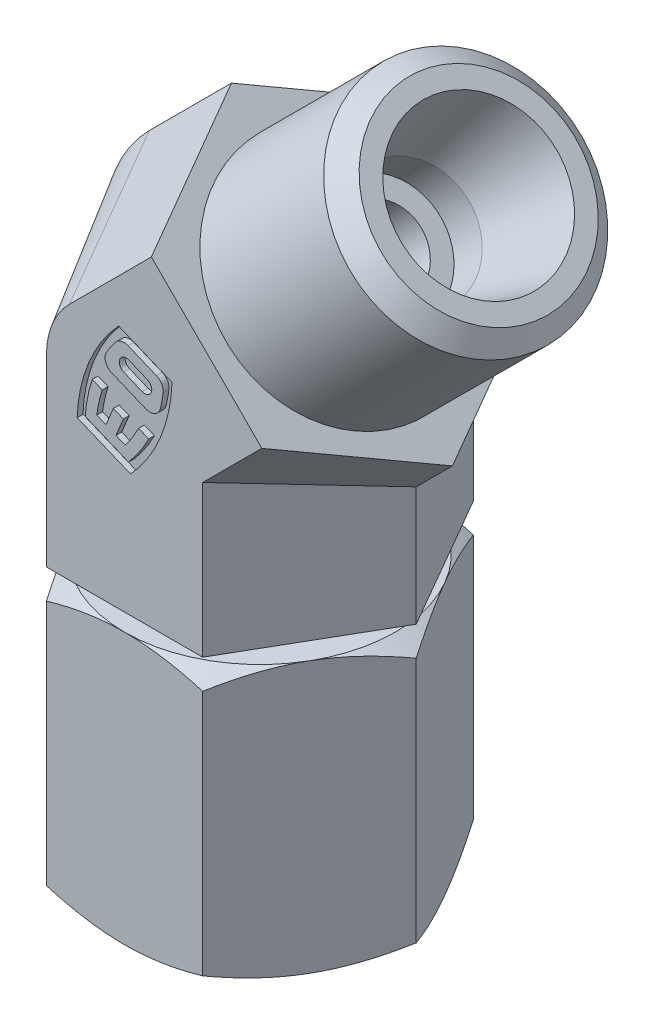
ISO-10303-21;
HEADER;
FILE_DESCRIPTION(('STEP AP214'),'2;1');
FILE_NAME('part.step','',(''),(''),'','','');
FILE_SCHEMA(('AUTOMOTIVE_DESIGN { 1 0 10303 214 1 1 1 1 }'));
ENDSEC;
DATA;
#1=APPLICATION_CONTEXT('core data for automotive mechanical design processes');
#2=APPLICATION_PROTOCOL_DEFINITION('international standard','automotive_design',2000,#1);
#3=PRODUCT_CONTEXT('',#1,'mechanical');
#4=PRODUCT('Part','Part','',(#3));
#5=PRODUCT_RELATED_PRODUCT_CATEGORY('part','',(#4));
#6=PRODUCT_DEFINITION_FORMATION('','',#4);
#7=PRODUCT_DEFINITION_CONTEXT('part definition',#1,'design');
#8=PRODUCT_DEFINITION('design','',#6,#7);
#9=PRODUCT_DEFINITION_SHAPE('','',#8);
#10=(LENGTH_UNIT() NAMED_UNIT(*) SI_UNIT(.MILLI.,.METRE.));
#11=(NAMED_UNIT(*) PLANE_ANGLE_UNIT() SI_UNIT($,.RADIAN.));
#12=(NAMED_UNIT(*) SI_UNIT($,.STERADIAN.) SOLID_ANGLE_UNIT());
#13=UNCERTAINTY_MEASURE_WITH_UNIT(LENGTH_MEASURE(1.E-05),#10,'distance_accuracy_value','');
#14=(GEOMETRIC_REPRESENTATION_CONTEXT(3) GLOBAL_UNCERTAINTY_ASSIGNED_CONTEXT((#13)) GLOBAL_UNIT_ASSIGNED_CONTEXT((#10,
#11,#12)) REPRESENTATION_CONTEXT('',''));
#15=CARTESIAN_POINT('',(0.,0.,0.));
#16=DIRECTION('',(0.,0.,1.));
#17=DIRECTION('',(1.,0.,0.));
#18=AXIS2_PLACEMENT_3D('',#15,#16,#17);
#19=CARTESIAN_POINT('',(0.,-14.1641431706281,0.));
#20=DIRECTION('',(0.,-1.,0.));
#21=DIRECTION('',(1.,0.,0.));
#22=AXIS2_PLACEMENT_3D('',#19,#20,#21);
#23=CYLINDRICAL_SURFACE('',#22,4.225);
#24=CARTESIAN_POINT('',(0.,-18.828286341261,0.));
#25=DIRECTION('',(0.,1.,0.));
#26=DIRECTION('',(1.,0.,0.));
#27=AXIS2_PLACEMENT_3D('',#24,#25,#26);
#28=CIRCLE('',#27,4.22499999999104);
#29=CARTESIAN_POINT('',(4.22499999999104,-18.828286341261,0.));
#30=VERTEX_POINT('',#29);
#31=EDGE_CURVE('E1484',#30,#30,#28,.F.);
#32=ORIENTED_EDGE('',*,*,#31,.F.);
#33=EDGE_LOOP('',(#32));
#34=FACE_BOUND('',#33,.T.);
#35=CARTESIAN_POINT('',(0.,-14.7,0.));
#36=DIRECTION('',(0.,-1.,0.));
#37=DIRECTION('',(1.,0.,0.));
#38=AXIS2_PLACEMENT_3D('',#35,#36,#37);
#39=CIRCLE('',#38,4.225);
#40=CARTESIAN_POINT('',(4.225,-14.7,0.));
#41=VERTEX_POINT('',#40);
#42=EDGE_CURVE('E20',#41,#41,#39,.F.);
#43=ORIENTED_EDGE('',*,*,#42,.F.);
#44=EDGE_LOOP('',(#43));
#45=FACE_BOUND('',#44,.T.);
#46=ADVANCED_FACE('F16',(#34,#45),#23,.T.);
#47=CARTESIAN_POINT('',(4.8725,-14.7,0.));
#48=DIRECTION('',(0.,-1.,0.));
#49=DIRECTION('',(1.,0.,0.));
#50=AXIS2_PLACEMENT_3D('',#47,#48,#49);
#51=PLANE('',#50);
#52=ORIENTED_EDGE('',*,*,#42,.T.);
#53=EDGE_LOOP('',(#52));
#54=FACE_BOUND('',#53,.T.);
#55=CARTESIAN_POINT('',(0.,-14.7,0.));
#56=DIRECTION('',(0.,-1.,0.));
#57=DIRECTION('',(1.,0.,0.));
#58=AXIS2_PLACEMENT_3D('',#55,#56,#57);
#59=CIRCLE('',#58,5.52);
#60=CARTESIAN_POINT('',(5.52,-14.6999999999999,0.));
#61=VERTEX_POINT('',#60);
#62=EDGE_CURVE('E1483',#61,#61,#59,.T.);
#63=ORIENTED_EDGE('',*,*,#62,.T.);
#64=EDGE_LOOP('',(#63));
#65=FACE_BOUND('',#64,.T.);
#66=ADVANCED_FACE('F1492',(#54,#65),#51,.T.);
#67=CARTESIAN_POINT('',(0.,-18.8282863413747,0.));
#68=DIRECTION('',(0.,1.,0.));
#69=DIRECTION('',(-1.,0.,0.));
#70=AXIS2_PLACEMENT_3D('',#67,#68,#69);
#71=CONICAL_SURFACE('',#70,4.22499999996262,0.209439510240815);
#72=CARTESIAN_POINT('',(0.,-21.3910729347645,0.));
#73=DIRECTION('',(0.,1.,0.));
#74=DIRECTION('',(0.,0.,1.));
#75=AXIS2_PLACEMENT_3D('',#72,#73,#74);
#76=CIRCLE('',#75,3.68026289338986);
#77=CARTESIAN_POINT('',(0.,-21.3910729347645,3.68026289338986));
#78=VERTEX_POINT('',#77);
#79=EDGE_CURVE('E1481',#78,#78,#76,.F.);
#80=ORIENTED_EDGE('',*,*,#79,.F.);
#81=EDGE_LOOP('',(#80));
#82=FACE_BOUND('',#81,.T.);
#83=ORIENTED_EDGE('',*,*,#31,.T.);
#84=EDGE_LOOP('',(#83));
#85=FACE_BOUND('',#84,.T.);
#86=ADVANCED_FACE('F1501',(#82,#85),#71,.T.);
#87=CARTESIAN_POINT('',(0.,-19.31,0.));
#88=DIRECTION('',(0.,-1.,0.));
#89=DIRECTION('',(1.,0.,0.));
#90=AXIS2_PLACEMENT_3D('',#87,#88,#89);
#91=CYLINDRICAL_SURFACE('',#90,5.52);
#92=CARTESIAN_POINT('',(1.03059148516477E-13,-23.9199999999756,0.));
#93=DIRECTION('',(0.,-1.,0.));
#94=DIRECTION('',(1.,0.,0.));
#95=AXIS2_PLACEMENT_3D('',#92,#93,#94);
#96=CIRCLE('',#95,5.51999999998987);
#97=CARTESIAN_POINT('',(5.51999999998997,-23.9199999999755,0.));
#98=VERTEX_POINT('',#97);
#99=EDGE_CURVE('E1478',#98,#98,#96,.T.);
#100=ORIENTED_EDGE('',*,*,#99,.T.);
#101=EDGE_LOOP('',(#100));
#102=FACE_BOUND('',#101,.T.);
#103=ORIENTED_EDGE('',*,*,#62,.F.);
#104=EDGE_LOOP('',(#103));
#105=FACE_BOUND('',#104,.T.);
#106=ADVANCED_FACE('F1506',(#102,#105),#91,.F.);
#107=CARTESIAN_POINT('',(1.0842021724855E-13,-24.3999999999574,0.));
#108=DIRECTION('',(0.,-1.,0.));
#109=DIRECTION('',(1.,0.,0.));
#110=AXIS2_PLACEMENT_3D('',#107,#108,#109);
#111=CONICAL_SURFACE('',#110,5.9999999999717,0.785398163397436);
#112=CARTESIAN_POINT('',(1.08420217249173E-13,-24.4000000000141,0.));
#113=DIRECTION('',(0.,-1.,0.));
#114=DIRECTION('',(1.,0.,0.));
#115=AXIS2_PLACEMENT_3D('',#112,#113,#114);
#116=CIRCLE('',#115,6.00000000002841);
#117=CARTESIAN_POINT('',(6.00000000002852,-24.400000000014,0.));
#118=VERTEX_POINT('',#117);
#119=EDGE_CURVE('E1477',#118,#118,#116,.F.);
#120=ORIENTED_EDGE('',*,*,#119,.F.);
#121=EDGE_LOOP('',(#120));
#122=FACE_BOUND('',#121,.T.);
#123=ORIENTED_EDGE('',*,*,#99,.F.);
#124=EDGE_LOOP('',(#123));
#125=FACE_BOUND('',#124,.T.);
#126=ADVANCED_FACE('F1510',(#122,#125),#111,.F.);
#127=CARTESIAN_POINT('',(0.,-22.125,0.));
#128=DIRECTION('',(0.,1.,0.));
#129=DIRECTION('',(0.,0.,1.));
#130=AXIS2_PLACEMENT_3D('',#127,#128,#129);
#131=TOROIDAL_SURFACE('',#130,3.525825,0.75);
#132=ORIENTED_EDGE('',*,*,#79,.T.);
#133=EDGE_LOOP('',(#132));
#134=FACE_BOUND('',#133,.T.);
#135=CARTESIAN_POINT('',(0.,-22.8582912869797,0.));
#136=DIRECTION('',(0.,1.,0.));
#137=DIRECTION('',(1.,0.,0.));
#138=AXIS2_PLACEMENT_3D('',#135,#136,#137);
#139=CIRCLE('',#138,3.36839600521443);
#140=CARTESIAN_POINT('',(3.36839600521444,-22.8582912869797,0.));
#141=VERTEX_POINT('',#140);
#142=EDGE_CURVE('E418',#141,#141,#139,.F.);
#143=ORIENTED_EDGE('',*,*,#142,.F.);
#144=EDGE_LOOP('',(#143));
#145=FACE_BOUND('',#144,.T.);
#146=ADVANCED_FACE('F1514',(#134,#145),#131,.T.);
#147=CARTESIAN_POINT('',(6.50000000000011,-24.4,0.));
#148=DIRECTION('',(0.,-1.,0.));
#149=DIRECTION('',(1.,0.,0.));
#150=AXIS2_PLACEMENT_3D('',#147,#148,#149);
#151=PLANE('',#150);
#152=ORIENTED_EDGE('',*,*,#119,.T.);
#153=EDGE_LOOP('',(#152));
#154=FACE_BOUND('',#153,.T.);
#155=CARTESIAN_POINT('',(1.08225223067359E-13,-24.4,0.));
#156=DIRECTION('',(0.,1.,0.));
#157=DIRECTION('',(-1.,0.,0.));
#158=AXIS2_PLACEMENT_3D('',#155,#156,#157);
#159=CIRCLE('',#158,6.99999999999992);
#160=CARTESIAN_POINT('',(6.0621778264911,-24.4,-3.49999999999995));
#161=VERTEX_POINT('',#160);
#162=CARTESIAN_POINT('',(1.08483570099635E-13,-24.4,-7.));
#163=VERTEX_POINT('',#162);
#164=EDGE_CURVE('E413',#161,#163,#159,.T.);
#165=ORIENTED_EDGE('',*,*,#164,.F.);
#166=CARTESIAN_POINT('',(1.08494979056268E-13,-24.4,0.));
#167=DIRECTION('',(0.,1.,0.));
#168=DIRECTION('',(-1.,0.,0.));
#169=AXIS2_PLACEMENT_3D('',#166,#167,#168);
#170=CIRCLE('',#169,6.99999999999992);
#171=CARTESIAN_POINT('',(6.0621778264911,-24.4,3.49999999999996));
#172=VERTEX_POINT('',#171);
#173=EDGE_CURVE('E401',#172,#161,#170,.T.);
#174=ORIENTED_EDGE('',*,*,#173,.F.);
#175=CARTESIAN_POINT('',(1.08225223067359E-13,-24.4,0.));
#176=DIRECTION('',(0.,1.,0.));
#177=DIRECTION('',(-1.,0.,0.));
#178=AXIS2_PLACEMENT_3D('',#175,#176,#177);
#179=CIRCLE('',#178,7.);
#180=CARTESIAN_POINT('',(1.08962537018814E-13,-24.4,7.));
#181=VERTEX_POINT('',#180);
#182=EDGE_CURVE('E409',#181,#172,#179,.T.);
#183=ORIENTED_EDGE('',*,*,#182,.F.);
#184=CARTESIAN_POINT('',(1.08225223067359E-13,-24.4,0.));
#185=DIRECTION('',(0.,1.,0.));
#186=DIRECTION('',(-1.,0.,0.));
#187=AXIS2_PLACEMENT_3D('',#184,#185,#186);
#188=CIRCLE('',#187,7.);
#189=CARTESIAN_POINT('',(-6.06217782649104,-24.4,3.50000000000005));
#190=VERTEX_POINT('',#189);
#191=EDGE_CURVE('E1533',#190,#181,#188,.T.);
#192=ORIENTED_EDGE('',*,*,#191,.F.);
#193=CARTESIAN_POINT('',(1.08360101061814E-13,-24.4,0.));
#194=DIRECTION('',(0.,1.,0.));
#195=DIRECTION('',(-1.,0.,0.));
#196=AXIS2_PLACEMENT_3D('',#193,#194,#195);
#197=CIRCLE('',#196,7.);
#198=CARTESIAN_POINT('',(-6.06217782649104,-24.4,-3.50000000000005));
#199=VERTEX_POINT('',#198);
#200=EDGE_CURVE('E410',#199,#190,#197,.T.);
#201=ORIENTED_EDGE('',*,*,#200,.F.);
#202=CARTESIAN_POINT('',(1.08225223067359E-13,-24.4,0.));
#203=DIRECTION('',(0.,1.,0.));
#204=DIRECTION('',(-1.,0.,0.));
#205=AXIS2_PLACEMENT_3D('',#202,#203,#204);
#206=CIRCLE('',#205,7.);
#207=EDGE_CURVE('E396',#163,#199,#206,.T.);
#208=ORIENTED_EDGE('',*,*,#207,.F.);
#209=EDGE_LOOP('',(#165,#174,#183,#192,#201,#208));
#210=FACE_BOUND('',#209,.T.);
#211=ADVANCED_FACE('F415',(#154,#210),#151,.T.);
#212=CARTESIAN_POINT('',(0.,-22.8582912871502,0.));
#213=DIRECTION('',(0.,1.,0.));
#214=DIRECTION('',(-1.,0.,0.));
#215=AXIS2_PLACEMENT_3D('',#212,#213,#214);
#216=CONICAL_SURFACE('',#215,3.36839600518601,0.209439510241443);
#217=ORIENTED_EDGE('',*,*,#142,.T.);
#218=EDGE_LOOP('',(#217));
#219=FACE_BOUND('',#218,.T.);
#220=CARTESIAN_POINT('',(0.,-25.6499999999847,0.));
#221=DIRECTION('',(0.,1.,0.));
#222=DIRECTION('',(-1.,0.,0.));
#223=AXIS2_PLACEMENT_3D('',#220,#221,#222);
#224=CIRCLE('',#223,2.7749999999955);
#225=CARTESIAN_POINT('',(-2.7749999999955,-25.6499999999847,0.));
#226=VERTEX_POINT('',#225);
#227=EDGE_CURVE('E1473',#226,#226,#224,.F.);
#228=ORIENTED_EDGE('',*,*,#227,.F.);
#229=EDGE_LOOP('',(#228));
#230=FACE_BOUND('',#229,.T.);
#231=ADVANCED_FACE('F1520',(#219,#230),#216,.T.);
#232=CARTESIAN_POINT('',(0.,0.,6.7));
#233=DIRECTION('',(0.,0.,1.));
#234=DIRECTION('',(1.,0.,0.));
#235=AXIS2_PLACEMENT_3D('',#232,#233,#234);
#236=PLANE('',#235);
#237=CARTESIAN_POINT('',(0.0859541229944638,1.56633709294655,6.7));
#238=DIRECTION('',(0.,0.,1.));
#239=DIRECTION('',(1.,0.,0.));
#240=AXIS2_PLACEMENT_3D('',#237,#238,#239);
#241=CIRCLE('',#240,0.36);
#242=CARTESIAN_POINT('',(0.223720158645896,1.89893372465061,6.7));
#243=VERTEX_POINT('',#242);
#244=CARTESIAN_POINT('',(-0.0518119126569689,1.23374046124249,6.7));
#245=VERTEX_POINT('',#244);
#246=EDGE_CURVE('E426',#243,#245,#241,.T.);
#247=ORIENTED_EDGE('',*,*,#246,.T.);
#248=DIRECTION('',(-0.923879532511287,0.38268343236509,0.));
#249=VECTOR('',#248,1.);
#250=CARTESIAN_POINT('',(0.90902280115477,0.835749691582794,6.7));
#251=LINE('',#250,#249);
#252=CARTESIAN_POINT('',(0.909022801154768,0.835749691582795,6.7));
#253=VERTEX_POINT('',#252);
#254=EDGE_CURVE('E1467',#253,#245,#251,.T.);
#255=ORIENTED_EDGE('',*,*,#254,.F.);
#256=CARTESIAN_POINT('',(1.0467888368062,1.16834632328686,6.7));
#257=DIRECTION('',(0.,0.,1.));
#258=DIRECTION('',(1.,0.,0.));
#259=AXIS2_PLACEMENT_3D('',#256,#257,#258);
#260=CIRCLE('',#259,0.36);
#261=CARTESIAN_POINT('',(1.18455487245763,1.50094295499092,6.7));
#262=VERTEX_POINT('',#261);
#263=EDGE_CURVE('E1470',#253,#262,#260,.T.);
#264=ORIENTED_EDGE('',*,*,#263,.T.);
#265=DIRECTION('',(0.923879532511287,-0.38268343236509,0.));
#266=VECTOR('',#265,1.);
#267=CARTESIAN_POINT('',(0.223720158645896,1.89893372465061,6.7));
#268=LINE('',#267,#266);
#269=EDGE_CURVE('E1471',#243,#262,#268,.T.);
#270=ORIENTED_EDGE('',*,*,#269,.F.);
#271=EDGE_LOOP('',(#247,#255,#264,#270));
#272=FACE_BOUND('',#271,.T.);
#273=ADVANCED_FACE('F1013',(#272),#236,.T.);
#274=CARTESIAN_POINT('',(1.01481323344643E-13,-23.7710339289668,0.));
#275=DIRECTION('',(0.,1.,0.));
#276=DIRECTION('',(-1.,0.,0.));
#277=AXIS2_PLACEMENT_3D('',#274,#275,#276);
#278=CONICAL_SURFACE('',#277,8.08940119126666,1.0471975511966);
#279=ORIENTED_EDGE('',*,*,#164,.T.);
#280=CARTESIAN_POINT('',(1.08531978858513E-13,-24.4,-7.));
#281=CARTESIAN_POINT('',(0.171536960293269,-24.4000286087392,-7.));
#282=CARTESIAN_POINT('',(0.343065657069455,-24.3963602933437,-7.));
#283=CARTESIAN_POINT('',(0.685786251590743,-24.3818424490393,-7.));
#284=CARTESIAN_POINT('',(0.856978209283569,-24.3709943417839,-7.));
#285=CARTESIAN_POINT('',(1.1979195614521,-24.3424009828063,-7.));
#286=CARTESIAN_POINT('',(1.3676718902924,-24.3246904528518,-7.));
#287=CARTESIAN_POINT('',(1.70636778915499,-24.2827532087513,-7.));
#288=CARTESIAN_POINT('',(1.87531133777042,-24.2585263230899,-7.));
#289=CARTESIAN_POINT('',(2.38022852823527,-24.1768195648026,-7.));
#290=CARTESIAN_POINT('',(2.71473536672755,-24.1102739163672,-7.));
#291=CARTESIAN_POINT('',(3.38087243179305,-23.9568026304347,-7.));
#292=CARTESIAN_POINT('',(3.71247942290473,-23.8697752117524,-7.));
#293=CARTESIAN_POINT('',(4.04145188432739,-23.7747852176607,-7.));
#294=B_SPLINE_CURVE_WITH_KNOTS('',3,(#280,#281,#282,#283,#284,#285,#286,#287,#288,#289,#290,
#291,#292,#293),.UNSPECIFIED.,.F.,.F.,(4,2,2,2,2,2,4),(0.,0.514558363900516,1.02901487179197,
1.54090167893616,2.05280196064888,3.07526084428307,4.10291216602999),.UNSPECIFIED.);
#295=CARTESIAN_POINT('',(4.04145188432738,-23.7747852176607,-7.));
#296=VERTEX_POINT('',#295);
#297=EDGE_CURVE('E423',#163,#296,#294,.T.);
#298=ORIENTED_EDGE('',*,*,#297,.T.);
#299=CARTESIAN_POINT('',(4.04145188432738,-23.7747852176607,-7.));
#300=CARTESIAN_POINT('',(4.20593811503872,-23.8697752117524,-6.71510149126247));
#301=CARTESIAN_POINT('',(4.37174161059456,-23.9568026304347,-6.42792141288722));
#302=CARTESIAN_POINT('',(4.70481014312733,-24.1102739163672,-5.85102979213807));
#303=CARTESIAN_POINT('',(4.87206356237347,-24.1768195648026,-5.56133837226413));
#304=CARTESIAN_POINT('',(5.12452215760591,-24.2585263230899,-5.12406725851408));
#305=CARTESIAN_POINT('',(5.20899393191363,-24.2827532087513,-4.97775785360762));
#306=CARTESIAN_POINT('',(5.37834188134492,-24.3246904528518,-4.68443860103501));
#307=CARTESIAN_POINT('',(5.46321804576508,-24.3424009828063,-4.53742877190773));
#308=CARTESIAN_POINT('',(5.63368872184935,-24.3709943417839,-4.24216489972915));
#309=CARTESIAN_POINT('',(5.71928470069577,-24.3818424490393,-4.09390831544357));
#310=CARTESIAN_POINT('',(5.89064499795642,-24.3963602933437,-3.79710357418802));
#311=CARTESIAN_POINT('',(5.97640934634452,-24.4000286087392,-3.6485553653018));
#312=CARTESIAN_POINT('',(6.0621778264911,-24.4,-3.49999999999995));
#313=B_SPLINE_CURVE_WITH_KNOTS('',3,(#299,#300,#301,#302,#303,#304,#305,#306,#307,#308,#309,
#310,#311,#312),.UNSPECIFIED.,.F.,.F.,(4,2,2,2,2,2,4),(0.,1.02765132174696,2.05011020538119,
2.56201048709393,3.07389729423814,3.58835380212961,4.10291216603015),.UNSPECIFIED.);
#314=EDGE_CURVE('E421',#296,#161,#313,.T.);
#315=ORIENTED_EDGE('',*,*,#314,.T.);
#316=EDGE_LOOP('',(#279,#298,#315));
#317=FACE_BOUND('',#316,.T.);
#318=ADVANCED_FACE('F422',(#317),#278,.T.);
#319=CARTESIAN_POINT('',(1.01481323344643E-13,-23.7710339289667,0.));
#320=DIRECTION('',(0.,1.,0.));
#321=DIRECTION('',(-1.,0.,0.));
#322=AXIS2_PLACEMENT_3D('',#319,#320,#321);
#323=CONICAL_SURFACE('',#322,8.08940119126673,1.0471975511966);
#324=CARTESIAN_POINT('',(-4.04145188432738,-23.7747852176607,-7.));
#325=CARTESIAN_POINT('',(-3.7124794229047,-23.8697752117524,-7.));
#326=CARTESIAN_POINT('',(-3.380872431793,-23.9568026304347,-7.));
#327=CARTESIAN_POINT('',(-2.71473536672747,-24.1102739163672,-7.));
#328=CARTESIAN_POINT('',(-2.38022852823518,-24.1768195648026,-7.));
#329=CARTESIAN_POINT('',(-1.87531133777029,-24.2585263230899,-7.));
#330=CARTESIAN_POINT('',(-1.70636778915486,-24.2827532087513,-7.));
#331=CARTESIAN_POINT('',(-1.36767189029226,-24.3246904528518,-7.));
#332=CARTESIAN_POINT('',(-1.19791956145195,-24.3424009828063,-7.));
#333=CARTESIAN_POINT('',(-0.856978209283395,-24.3709943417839,-7.));
#334=CARTESIAN_POINT('',(-0.68578625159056,-24.3818424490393,-7.));
#335=CARTESIAN_POINT('',(-0.343065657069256,-24.3963602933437,-7.));
#336=CARTESIAN_POINT('',(-0.171536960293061,-24.4000286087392,-7.));
#337=CARTESIAN_POINT('',(1.07252476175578E-13,-24.4,-7.));
#338=B_SPLINE_CURVE_WITH_KNOTS('',3,(#324,#325,#326,#327,#328,#329,#330,#331,#332,#333,#334,
#335,#336,#337),.UNSPECIFIED.,.F.,.F.,(4,2,2,2,2,2,4),(0.,1.02765132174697,2.05011020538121,
2.56201048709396,3.07389729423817,3.58835380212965,4.10291216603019),.UNSPECIFIED.);
#339=CARTESIAN_POINT('',(-4.04145188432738,-23.7747852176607,-7.));
#340=VERTEX_POINT('',#339);
#341=EDGE_CURVE('E431',#340,#163,#338,.T.);
#342=ORIENTED_EDGE('',*,*,#341,.T.);
#343=ORIENTED_EDGE('',*,*,#207,.T.);
#344=CARTESIAN_POINT('',(-6.06217782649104,-24.4,-3.50000000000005));
#345=CARTESIAN_POINT('',(-5.97640934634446,-24.4000286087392,-3.64855536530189));
#346=CARTESIAN_POINT('',(-5.89064499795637,-24.3963602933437,-3.79710357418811));
#347=CARTESIAN_POINT('',(-5.71928470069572,-24.3818424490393,-4.09390831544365));
#348=CARTESIAN_POINT('',(-5.63368872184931,-24.3709943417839,-4.24216489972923));
#349=CARTESIAN_POINT('',(-5.46321804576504,-24.3424009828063,-4.5374287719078));
#350=CARTESIAN_POINT('',(-5.37834188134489,-24.3246904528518,-4.68443860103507));
#351=CARTESIAN_POINT('',(-5.20899393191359,-24.2827532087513,-4.97775785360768));
#352=CARTESIAN_POINT('',(-5.12452215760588,-24.2585263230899,-5.12406725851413));
#353=CARTESIAN_POINT('',(-4.87206356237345,-24.1768195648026,-5.56133837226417));
#354=CARTESIAN_POINT('',(-4.70481014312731,-24.1102739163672,-5.8510297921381));
#355=CARTESIAN_POINT('',(-4.37174161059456,-23.9568026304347,-6.42792141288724));
#356=CARTESIAN_POINT('',(-4.20593811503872,-23.8697752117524,-6.71510149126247));
#357=CARTESIAN_POINT('',(-4.04145188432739,-23.7747852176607,-7.));
#358=B_SPLINE_CURVE_WITH_KNOTS('',3,(#344,#345,#346,#347,#348,#349,#350,#351,#352,#353,#354,
#355,#356,#357),.UNSPECIFIED.,.F.,.F.,(4,2,2,2,2,2,4),(0.,0.51455836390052,1.02901487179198,
1.54090167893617,2.0528019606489,3.0752608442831,4.10291216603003),.UNSPECIFIED.);
#359=EDGE_CURVE('E992',#199,#340,#358,.T.);
#360=ORIENTED_EDGE('',*,*,#359,.T.);
#361=EDGE_LOOP('',(#342,#343,#360));
#362=FACE_BOUND('',#361,.T.);
#363=ADVANCED_FACE('F1005',(#362),#323,.T.);
#364=CARTESIAN_POINT('',(1.01481323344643E-13,-23.7710339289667,0.));
#365=DIRECTION('',(0.,1.,0.));
#366=DIRECTION('',(-1.,0.,0.));
#367=AXIS2_PLACEMENT_3D('',#364,#365,#366);
#368=CONICAL_SURFACE('',#367,8.08940119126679,1.0471975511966);
#369=ORIENTED_EDGE('',*,*,#200,.T.);
#370=CARTESIAN_POINT('',(-6.06217782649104,-24.4,3.50000000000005));
#371=CARTESIAN_POINT('',(-6.14794630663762,-24.4000286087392,3.35144463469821));
#372=CARTESIAN_POINT('',(-6.23371065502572,-24.3963602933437,3.20289642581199));
#373=CARTESIAN_POINT('',(-6.40507095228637,-24.3818424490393,2.90609168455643));
#374=CARTESIAN_POINT('',(-6.49066693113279,-24.3709943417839,2.75783510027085));
#375=CARTESIAN_POINT('',(-6.66113760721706,-24.3424009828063,2.46257122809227));
#376=CARTESIAN_POINT('',(-6.74601377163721,-24.3246904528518,2.315561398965));
#377=CARTESIAN_POINT('',(-6.91536172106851,-24.2827532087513,2.02224214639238));
#378=CARTESIAN_POINT('',(-6.99983349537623,-24.2585263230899,1.87593274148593));
#379=CARTESIAN_POINT('',(-7.25229209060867,-24.1768195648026,1.43866162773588));
#380=CARTESIAN_POINT('',(-7.41954550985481,-24.1102739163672,1.14897020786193));
#381=CARTESIAN_POINT('',(-7.75261404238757,-23.9568026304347,0.572078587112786));
#382=CARTESIAN_POINT('',(-7.91841753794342,-23.8697752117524,0.28489850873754));
#383=CARTESIAN_POINT('',(-8.08290376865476,-23.7747852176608,0.));
#384=B_SPLINE_CURVE_WITH_KNOTS('',3,(#370,#371,#372,#373,#374,#375,#376,#377,#378,#379,#380,
#381,#382,#383),.UNSPECIFIED.,.F.,.F.,(4,2,2,2,2,2,4),(0.,0.514558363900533,1.02901487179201,
1.54090167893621,2.05280196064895,3.07526084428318,4.10291216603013),.UNSPECIFIED.);
#385=CARTESIAN_POINT('',(-8.08290376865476,-23.7747852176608,0.));
#386=VERTEX_POINT('',#385);
#387=EDGE_CURVE('E474',#190,#386,#384,.T.);
#388=ORIENTED_EDGE('',*,*,#387,.T.);
#389=CARTESIAN_POINT('',(-8.08290376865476,-23.7747852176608,0.));
#390=CARTESIAN_POINT('',(-7.91841753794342,-23.8697752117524,-0.284898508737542));
#391=CARTESIAN_POINT('',(-7.75261404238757,-23.9568026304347,-0.572078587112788));
#392=CARTESIAN_POINT('',(-7.41954550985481,-24.1102739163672,-1.14897020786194));
#393=CARTESIAN_POINT('',(-7.25229209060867,-24.1768195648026,-1.43866162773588));
#394=CARTESIAN_POINT('',(-6.99983349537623,-24.2585263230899,-1.87593274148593));
#395=CARTESIAN_POINT('',(-6.91536172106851,-24.2827532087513,-2.02224214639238));
#396=CARTESIAN_POINT('',(-6.74601377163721,-24.3246904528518,-2.315561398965));
#397=CARTESIAN_POINT('',(-6.66113760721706,-24.3424009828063,-2.46257122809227));
#398=CARTESIAN_POINT('',(-6.49066693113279,-24.3709943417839,-2.75783510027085));
#399=CARTESIAN_POINT('',(-6.40507095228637,-24.3818424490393,-2.90609168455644));
#400=CARTESIAN_POINT('',(-6.23371065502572,-24.3963602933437,-3.20289642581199));
#401=CARTESIAN_POINT('',(-6.14794630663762,-24.4000286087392,-3.35144463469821));
#402=CARTESIAN_POINT('',(-6.06217782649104,-24.4,-3.50000000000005));
#403=B_SPLINE_CURVE_WITH_KNOTS('',3,(#389,#390,#391,#392,#393,#394,#395,#396,#397,#398,#399,
#400,#401,#402),.UNSPECIFIED.,.F.,.F.,(4,2,2,2,2,2,4),(0.,1.02765132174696,2.05011020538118,
2.56201048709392,3.07389729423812,3.5883538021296,4.10291216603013),.UNSPECIFIED.);
#404=EDGE_CURVE('E997',#386,#199,#403,.T.);
#405=ORIENTED_EDGE('',*,*,#404,.T.);
#406=EDGE_LOOP('',(#369,#388,#405));
#407=FACE_BOUND('',#406,.T.);
#408=ADVANCED_FACE('F457',(#407),#368,.T.);
#409=CARTESIAN_POINT('',(1.01481323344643E-13,-23.7710339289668,0.));
#410=DIRECTION('',(0.,1.,0.));
#411=DIRECTION('',(-1.,0.,0.));
#412=AXIS2_PLACEMENT_3D('',#409,#410,#411);
#413=CONICAL_SURFACE('',#412,8.0894011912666,1.0471975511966);
#414=CARTESIAN_POINT('',(8.08290376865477,-23.7747852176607,0.));
#415=CARTESIAN_POINT('',(7.91841753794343,-23.8697752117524,0.284898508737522));
#416=CARTESIAN_POINT('',(7.75261404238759,-23.9568026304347,0.572078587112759));
#417=CARTESIAN_POINT('',(7.41954550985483,-24.1102739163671,1.14897020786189));
#418=CARTESIAN_POINT('',(7.25229209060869,-24.1768195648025,1.43866162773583));
#419=CARTESIAN_POINT('',(6.99983349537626,-24.2585263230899,1.87593274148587));
#420=CARTESIAN_POINT('',(6.91536172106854,-24.2827532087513,2.02224214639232));
#421=CARTESIAN_POINT('',(6.74601377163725,-24.3246904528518,2.31556139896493));
#422=CARTESIAN_POINT('',(6.6611376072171,-24.3424009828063,2.4625712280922));
#423=CARTESIAN_POINT('',(6.49066693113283,-24.3709943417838,2.75783510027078));
#424=CARTESIAN_POINT('',(6.40507095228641,-24.3818424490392,2.90609168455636));
#425=CARTESIAN_POINT('',(6.23371065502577,-24.3963602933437,3.2028964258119));
#426=CARTESIAN_POINT('',(6.14794630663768,-24.4000286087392,3.35144463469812));
#427=CARTESIAN_POINT('',(6.0621778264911,-24.4,3.49999999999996));
#428=B_SPLINE_CURVE_WITH_KNOTS('',3,(#414,#415,#416,#417,#418,#419,#420,#421,#422,#423,#424,
#425,#426,#427),.UNSPECIFIED.,.F.,.F.,(4,2,2,2,2,2,4),(0.,1.02765132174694,2.05011020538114,
2.56201048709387,3.07389729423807,3.58835380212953,4.10291216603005),.UNSPECIFIED.);
#429=CARTESIAN_POINT('',(8.08290376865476,-23.7747852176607,0.));
#430=VERTEX_POINT('',#429);
#431=EDGE_CURVE('E407',#430,#172,#428,.T.);
#432=ORIENTED_EDGE('',*,*,#431,.T.);
#433=ORIENTED_EDGE('',*,*,#173,.T.);
#434=CARTESIAN_POINT('',(6.0621778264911,-24.4,-3.49999999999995));
#435=CARTESIAN_POINT('',(6.14794630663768,-24.4000286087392,-3.35144463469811));
#436=CARTESIAN_POINT('',(6.23371065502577,-24.3963602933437,-3.20289642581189));
#437=CARTESIAN_POINT('',(6.40507095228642,-24.3818424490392,-2.90609168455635));
#438=CARTESIAN_POINT('',(6.49066693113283,-24.3709943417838,-2.75783510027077));
#439=CARTESIAN_POINT('',(6.6611376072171,-24.3424009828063,-2.4625712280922));
#440=CARTESIAN_POINT('',(6.74601377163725,-24.3246904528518,-2.31556139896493));
#441=CARTESIAN_POINT('',(6.91536172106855,-24.2827532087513,-2.02224214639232));
#442=CARTESIAN_POINT('',(6.99983349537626,-24.2585263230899,-1.87593274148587));
#443=CARTESIAN_POINT('',(7.25229209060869,-24.1768195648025,-1.43866162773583));
#444=CARTESIAN_POINT('',(7.41954550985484,-24.1102739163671,-1.14897020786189));
#445=CARTESIAN_POINT('',(7.75261404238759,-23.9568026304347,-0.57207858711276));
#446=CARTESIAN_POINT('',(7.91841753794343,-23.8697752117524,-0.284898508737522));
#447=CARTESIAN_POINT('',(8.08290376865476,-23.7747852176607,0.));
#448=B_SPLINE_CURVE_WITH_KNOTS('',3,(#434,#435,#436,#437,#438,#439,#440,#441,#442,#443,#444,
#445,#446,#447),.UNSPECIFIED.,.F.,.F.,(4,2,2,2,2,2,4),(0.,0.514558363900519,1.02901487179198,
1.54090167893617,2.0528019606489,3.0752608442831,4.10291216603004),.UNSPECIFIED.);
#449=EDGE_CURVE('E404',#161,#430,#448,.T.);
#450=ORIENTED_EDGE('',*,*,#449,.T.);
#451=EDGE_LOOP('',(#432,#433,#450));
#452=FACE_BOUND('',#451,.T.);
#453=ADVANCED_FACE('F402',(#452),#413,.T.);
#454=CARTESIAN_POINT('',(1.01481323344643E-13,-23.7710339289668,0.));
#455=DIRECTION('',(0.,1.,0.));
#456=DIRECTION('',(-1.,0.,0.));
#457=AXIS2_PLACEMENT_3D('',#454,#455,#456);
#458=CONICAL_SURFACE('',#457,8.08940119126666,1.0471975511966);
#459=ORIENTED_EDGE('',*,*,#182,.T.);
#460=CARTESIAN_POINT('',(6.0621778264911,-24.4,3.49999999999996));
#461=CARTESIAN_POINT('',(5.97640934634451,-24.4000286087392,3.6485553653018));
#462=CARTESIAN_POINT('',(5.89064499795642,-24.3963602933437,3.79710357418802));
#463=CARTESIAN_POINT('',(5.71928470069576,-24.3818424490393,4.09390831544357));
#464=CARTESIAN_POINT('',(5.63368872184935,-24.3709943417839,4.24216489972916));
#465=CARTESIAN_POINT('',(5.46321804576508,-24.3424009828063,4.53742877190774));
#466=CARTESIAN_POINT('',(5.37834188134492,-24.3246904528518,4.68443860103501));
#467=CARTESIAN_POINT('',(5.20899393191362,-24.2827532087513,4.97775785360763));
#468=CARTESIAN_POINT('',(5.12452215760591,-24.2585263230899,5.12406725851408));
#469=CARTESIAN_POINT('',(4.87206356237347,-24.1768195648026,5.56133837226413));
#470=CARTESIAN_POINT('',(4.70481014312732,-24.1102739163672,5.85102979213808));
#471=CARTESIAN_POINT('',(4.37174161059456,-23.9568026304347,6.42792141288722));
#472=CARTESIAN_POINT('',(4.20593811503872,-23.8697752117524,6.71510149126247));
#473=CARTESIAN_POINT('',(4.04145188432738,-23.7747852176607,7.));
#474=B_SPLINE_CURVE_WITH_KNOTS('',3,(#460,#461,#462,#463,#464,#465,#466,#467,#468,#469,#470,
#471,#472,#473),.UNSPECIFIED.,.F.,.F.,(4,2,2,2,2,2,4),(0.,0.514558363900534,1.02901487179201,
1.54090167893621,2.05280196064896,3.07526084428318,4.10291216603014),.UNSPECIFIED.);
#475=CARTESIAN_POINT('',(4.04145188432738,-23.7747852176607,7.));
#476=VERTEX_POINT('',#475);
#477=EDGE_CURVE('E469',#172,#476,#474,.T.);
#478=ORIENTED_EDGE('',*,*,#477,.T.);
#479=CARTESIAN_POINT('',(4.04145188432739,-23.7747852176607,7.));
#480=CARTESIAN_POINT('',(3.71247942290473,-23.8697752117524,7.));
#481=CARTESIAN_POINT('',(3.38087243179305,-23.9568026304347,7.));
#482=CARTESIAN_POINT('',(2.71473536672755,-24.1102739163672,7.));
#483=CARTESIAN_POINT('',(2.38022852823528,-24.1768195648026,7.));
#484=CARTESIAN_POINT('',(1.87531133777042,-24.2585263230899,7.));
#485=CARTESIAN_POINT('',(1.70636778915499,-24.2827532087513,7.));
#486=CARTESIAN_POINT('',(1.36767189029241,-24.3246904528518,7.));
#487=CARTESIAN_POINT('',(1.1979195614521,-24.3424009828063,7.));
#488=CARTESIAN_POINT('',(0.856978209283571,-24.3709943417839,7.));
#489=CARTESIAN_POINT('',(0.685786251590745,-24.3818424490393,7.));
#490=CARTESIAN_POINT('',(0.343065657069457,-24.3963602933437,7.));
#491=CARTESIAN_POINT('',(0.17153696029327,-24.4000286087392,7.));
#492=CARTESIAN_POINT('',(1.10508277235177E-13,-24.4,7.));
#493=B_SPLINE_CURVE_WITH_KNOTS('',3,(#479,#480,#481,#482,#483,#484,#485,#486,#487,#488,#489,
#490,#491,#492),.UNSPECIFIED.,.F.,.F.,(4,2,2,2,2,2,4),(0.,1.02765132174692,2.05011020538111,
2.56201048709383,3.07389729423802,3.58835380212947,4.10291216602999),.UNSPECIFIED.);
#494=EDGE_CURVE('E1036',#476,#181,#493,.T.);
#495=ORIENTED_EDGE('',*,*,#494,.T.);
#496=EDGE_LOOP('',(#459,#478,#495));
#497=FACE_BOUND('',#496,.T.);
#498=ADVANCED_FACE('F456',(#497),#458,.T.);
#499=CARTESIAN_POINT('',(1.01481323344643E-13,-23.7710339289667,0.));
#500=DIRECTION('',(0.,1.,0.));
#501=DIRECTION('',(-1.,0.,0.));
#502=AXIS2_PLACEMENT_3D('',#499,#500,#501);
#503=CONICAL_SURFACE('',#502,8.08940119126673,1.0471975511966);
#504=CARTESIAN_POINT('',(-4.04145188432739,-23.7747852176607,7.));
#505=CARTESIAN_POINT('',(-4.20593811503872,-23.8697752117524,6.71510149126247));
#506=CARTESIAN_POINT('',(-4.37174161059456,-23.9568026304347,6.42792141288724));
#507=CARTESIAN_POINT('',(-4.70481014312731,-24.1102739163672,5.8510297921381));
#508=CARTESIAN_POINT('',(-4.87206356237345,-24.1768195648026,5.56133837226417));
#509=CARTESIAN_POINT('',(-5.12452215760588,-24.2585263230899,5.12406725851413));
#510=CARTESIAN_POINT('',(-5.20899393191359,-24.2827532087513,4.97775785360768));
#511=CARTESIAN_POINT('',(-5.37834188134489,-24.3246904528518,4.68443860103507));
#512=CARTESIAN_POINT('',(-5.46321804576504,-24.3424009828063,4.5374287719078));
#513=CARTESIAN_POINT('',(-5.63368872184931,-24.3709943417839,4.24216489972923));
#514=CARTESIAN_POINT('',(-5.71928470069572,-24.3818424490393,4.09390831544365));
#515=CARTESIAN_POINT('',(-5.89064499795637,-24.3963602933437,3.79710357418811));
#516=CARTESIAN_POINT('',(-5.97640934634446,-24.4000286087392,3.64855536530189));
#517=CARTESIAN_POINT('',(-6.06217782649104,-24.4,3.50000000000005));
#518=B_SPLINE_CURVE_WITH_KNOTS('',3,(#504,#505,#506,#507,#508,#509,#510,#511,#512,#513,#514,
#515,#516,#517),.UNSPECIFIED.,.F.,.F.,(4,2,2,2,2,2,4),(0.,1.02765132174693,2.05011020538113,
2.56201048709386,3.07389729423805,3.58835380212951,4.10291216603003),.UNSPECIFIED.);
#519=CARTESIAN_POINT('',(-4.04145188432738,-23.7747852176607,7.));
#520=VERTEX_POINT('',#519);
#521=EDGE_CURVE('E998',#520,#190,#518,.T.);
#522=ORIENTED_EDGE('',*,*,#521,.T.);
#523=ORIENTED_EDGE('',*,*,#191,.T.);
#524=CARTESIAN_POINT('',(1.08930665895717E-13,-24.4,7.));
#525=CARTESIAN_POINT('',(-0.171536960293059,-24.4000286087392,7.));
#526=CARTESIAN_POINT('',(-0.343065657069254,-24.3963602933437,7.));
#527=CARTESIAN_POINT('',(-0.685786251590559,-24.3818424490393,7.));
#528=CARTESIAN_POINT('',(-0.856978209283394,-24.3709943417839,7.));
#529=CARTESIAN_POINT('',(-1.19791956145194,-24.3424009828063,7.));
#530=CARTESIAN_POINT('',(-1.36767189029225,-24.3246904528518,7.));
#531=CARTESIAN_POINT('',(-1.70636778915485,-24.2827532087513,7.));
#532=CARTESIAN_POINT('',(-1.87531133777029,-24.2585263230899,7.));
#533=CARTESIAN_POINT('',(-2.38022852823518,-24.1768195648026,7.));
#534=CARTESIAN_POINT('',(-2.71473536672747,-24.1102739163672,7.));
#535=CARTESIAN_POINT('',(-3.380872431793,-23.9568026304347,7.));
#536=CARTESIAN_POINT('',(-3.7124794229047,-23.8697752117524,7.));
#537=CARTESIAN_POINT('',(-4.04145188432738,-23.7747852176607,7.));
#538=B_SPLINE_CURVE_WITH_KNOTS('',3,(#524,#525,#526,#527,#528,#529,#530,#531,#532,#533,#534,
#535,#536,#537),.UNSPECIFIED.,.F.,.F.,(4,2,2,2,2,2,4),(0.,0.514558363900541,1.02901487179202,
1.54090167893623,2.05280196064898,3.07526084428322,4.10291216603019),.UNSPECIFIED.);
#539=EDGE_CURVE('E1032',#181,#520,#538,.T.);
#540=ORIENTED_EDGE('',*,*,#539,.T.);
#541=EDGE_LOOP('',(#522,#523,#540));
#542=FACE_BOUND('',#541,.T.);
#543=ADVANCED_FACE('F1585',(#542),#503,.T.);
#544=CARTESIAN_POINT('',(0.,5.6843418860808E-11,0.));
#545=DIRECTION('',(0.,-1.,0.));
#546=DIRECTION('',(0.,0.,-1.));
#547=AXIS2_PLACEMENT_3D('',#544,#545,#546);
#548=CONICAL_SURFACE('',#547,2.00000000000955,1.02974425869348);
#549=CARTESIAN_POINT('',(-2.68676205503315E-11,1.56718613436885E-11,-2.00000000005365));
#550=CARTESIAN_POINT('',(-0.140877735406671,0.0583534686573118,-1.9028425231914));
#551=CARTESIAN_POINT('',(-0.27657366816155,0.114560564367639,-1.79439699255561));
#552=CARTESIAN_POINT('',(-0.530672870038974,0.219811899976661,-1.55315810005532));
#553=CARTESIAN_POINT('',(-0.648852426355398,0.268763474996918,-1.42009172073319));
#554=CARTESIAN_POINT('',(-0.822106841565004,0.340527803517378,-1.17901848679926));
#555=CARTESIAN_POINT('',(-0.885022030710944,0.366588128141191,-1.0776960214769));
#556=CARTESIAN_POINT('',(-0.994965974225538,0.41212840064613,-0.86581909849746));
#557=CARTESIAN_POINT('',(-1.0420623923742,0.431636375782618,-0.75530655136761));
#558=CARTESIAN_POINT('',(-1.11353235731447,0.461240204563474,-0.538435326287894));
#559=CARTESIAN_POINT('',(-1.13971976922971,0.472087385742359,-0.432783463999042));
#560=CARTESIAN_POINT('',(-1.17489187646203,0.48665614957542,-0.21808487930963));
#561=CARTESIAN_POINT('',(-1.18387311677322,0.490376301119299,-0.109037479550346));
#562=CARTESIAN_POINT('',(-1.18387737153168,0.490378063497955,0.104710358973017));
#563=CARTESIAN_POINT('',(-1.17559890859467,0.486949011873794,0.209411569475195));
#564=CARTESIAN_POINT('',(-1.14312633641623,0.473498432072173,0.415841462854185));
#565=CARTESIAN_POINT('',(-1.11893143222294,0.463476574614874,0.517569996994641));
#566=CARTESIAN_POINT('',(-1.0557281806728,0.437296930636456,0.71740591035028));
#567=CARTESIAN_POINT('',(-1.01646812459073,0.421034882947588,0.815418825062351));
#568=CARTESIAN_POINT('',(-0.925434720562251,0.383327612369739,1.00436584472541));
#569=CARTESIAN_POINT('',(-0.873650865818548,0.36187803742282,1.0952939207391));
#570=CARTESIAN_POINT('',(-0.730225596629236,0.302469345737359,1.31453727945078));
#571=CARTESIAN_POINT('',(-0.631861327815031,0.26172553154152,1.4377040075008));
#572=CARTESIAN_POINT('',(-0.418364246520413,0.173292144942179,1.66540112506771));
#573=CARTESIAN_POINT('',(-0.303211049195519,0.125594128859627,1.76990851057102));
#574=CARTESIAN_POINT('',(-0.122769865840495,0.0508529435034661,1.91247750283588));
#575=CARTESIAN_POINT('',(-0.0619484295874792,0.0256598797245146,1.95727586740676));
#576=CARTESIAN_POINT('',(-2.12509871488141E-11,3.05373325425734E-11,2.00000000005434));
#577=B_SPLINE_CURVE_WITH_KNOTS('',3,(#549,#550,#551,#552,#553,#554,#555,#556,#557,#558,#559,
#560,#561,#562,#563,#564,#565,#566,#567,#568,#569,#570,#571,#572,#573,#574,#575,#576),
.UNSPECIFIED.,.F.,.F.,(4,2,2,2,2,2,2,2,2,2,2,2,2,4),(0.,0.544164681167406,1.09477081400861,
1.4596759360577,1.82299970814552,2.14964742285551,2.47636072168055,2.7901084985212,
3.10387194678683,3.42312363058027,3.7426440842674,4.22833165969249,4.71461393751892,
4.95327796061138),.UNSPECIFIED.);
#578=CARTESIAN_POINT('',(-1.03868802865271E-11,1.51730212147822E-11,-2.00000000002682));
#579=VERTEX_POINT('',#578);
#580=CARTESIAN_POINT('',(-1.03869569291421E-11,1.51730978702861E-11,2.00000000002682));
#581=VERTEX_POINT('',#580);
#582=EDGE_CURVE('E1031',#579,#581,#577,.T.);
#583=ORIENTED_EDGE('',*,*,#582,.T.);
#584=CARTESIAN_POINT('',(0.,0.,0.));
#585=DIRECTION('',(0.,-1.,0.));
#586=DIRECTION('',(0.,0.,-1.));
#587=AXIS2_PLACEMENT_3D('',#584,#585,#586);
#588=CIRCLE('',#587,2.);
#589=EDGE_CURVE('E1037',#581,#579,#588,.T.);
#590=ORIENTED_EDGE('',*,*,#589,.T.);
#591=EDGE_LOOP('',(#583,#590));
#592=FACE_BOUND('',#591,.T.);
#593=ADVANCED_FACE('F1582',(#592),#548,.F.);
#594=CARTESIAN_POINT('',(1.3875,-25.65,0.));
#595=DIRECTION('',(0.,-1.,0.));
#596=DIRECTION('',(0.,0.,-1.));
#597=AXIS2_PLACEMENT_3D('',#594,#595,#596);
#598=PLANE('',#597);
#599=ORIENTED_EDGE('',*,*,#227,.T.);
#600=EDGE_LOOP('',(#599));
#601=FACE_BOUND('',#600,.T.);
#602=CARTESIAN_POINT('',(0.,-25.65,0.));
#603=DIRECTION('',(0.,-1.,0.));
#604=DIRECTION('',(0.,0.,-1.));
#605=AXIS2_PLACEMENT_3D('',#602,#603,#604);
#606=CIRCLE('',#605,2.);
#607=CARTESIAN_POINT('',(0.,-25.65,-2.));
#608=VERTEX_POINT('',#607);
#609=EDGE_CURVE('E1040',#608,#608,#606,.F.);
#610=ORIENTED_EDGE('',*,*,#609,.T.);
#611=EDGE_LOOP('',(#610));
#612=FACE_BOUND('',#611,.T.);
#613=ADVANCED_FACE('F1578',(#601,#612),#598,.T.);
#614=CARTESIAN_POINT('',(0.223720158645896,1.89893372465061,7.));
#615=DIRECTION('',(-0.38268343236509,-0.923879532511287,0.));
#616=DIRECTION('',(0.923879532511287,-0.38268343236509,0.));
#617=AXIS2_PLACEMENT_3D('',#614,#615,#616);
#618=PLANE('',#617);
#619=DIRECTION('',(0.923879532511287,-0.382683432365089,0.));
#620=VECTOR('',#619,1.);
#621=CARTESIAN_POINT('',(0.223720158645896,1.89893372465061,7.));
#622=LINE('',#621,#620);
#623=CARTESIAN_POINT('',(0.223720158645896,1.89893372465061,7.));
#624=VERTEX_POINT('',#623);
#625=CARTESIAN_POINT('',(1.18455487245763,1.50094295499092,7.));
#626=VERTEX_POINT('',#625);
#627=EDGE_CURVE('E1048',#624,#626,#622,.T.);
#628=ORIENTED_EDGE('',*,*,#627,.F.);
#629=DIRECTION('',(0.,0.,1.));
#630=VECTOR('',#629,1.);
#631=CARTESIAN_POINT('',(0.223720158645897,1.89893372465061,7.));
#632=LINE('',#631,#630);
#633=EDGE_CURVE('E1461',#624,#243,#632,.F.);
#634=ORIENTED_EDGE('',*,*,#633,.T.);
#635=ORIENTED_EDGE('',*,*,#269,.T.);
#636=DIRECTION('',(0.,0.,1.));
#637=VECTOR('',#636,1.);
#638=CARTESIAN_POINT('',(1.18455487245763,1.50094295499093,7.));
#639=LINE('',#638,#637);
#640=EDGE_CURVE('E1468',#262,#626,#639,.T.);
#641=ORIENTED_EDGE('',*,*,#640,.T.);
#642=EDGE_LOOP('',(#628,#634,#635,#641));
#643=FACE_BOUND('',#642,.T.);
#644=ADVANCED_FACE('F1574',(#643),#618,.T.);
#645=CARTESIAN_POINT('',(1.0467888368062,1.16834632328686,7.));
#646=DIRECTION('',(0.,0.,1.));
#647=DIRECTION('',(1.,0.,0.));
#648=AXIS2_PLACEMENT_3D('',#645,#646,#647);
#649=CYLINDRICAL_SURFACE('',#648,0.36);
#650=DIRECTION('',(0.,0.,1.));
#651=VECTOR('',#650,1.);
#652=CARTESIAN_POINT('',(0.90902280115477,0.835749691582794,7.));
#653=LINE('',#652,#651);
#654=CARTESIAN_POINT('',(0.909022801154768,0.835749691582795,7.));
#655=VERTEX_POINT('',#654);
#656=EDGE_CURVE('E1462',#655,#253,#653,.F.);
#657=ORIENTED_EDGE('',*,*,#656,.F.);
#658=CARTESIAN_POINT('',(1.0467888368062,1.16834632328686,7.));
#659=DIRECTION('',(0.,0.,1.));
#660=DIRECTION('',(1.,0.,0.));
#661=AXIS2_PLACEMENT_3D('',#658,#659,#660);
#662=CIRCLE('',#661,0.36);
#663=EDGE_CURVE('E1047',#626,#655,#662,.F.);
#664=ORIENTED_EDGE('',*,*,#663,.F.);
#665=ORIENTED_EDGE('',*,*,#640,.F.);
#666=ORIENTED_EDGE('',*,*,#263,.F.);
#667=EDGE_LOOP('',(#657,#664,#665,#666));
#668=FACE_BOUND('',#667,.T.);
#669=ADVANCED_FACE('F1567',(#668),#649,.F.);
#670=CARTESIAN_POINT('',(0.90902280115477,0.835749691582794,7.));
#671=DIRECTION('',(0.38268343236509,0.923879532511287,0.));
#672=DIRECTION('',(-0.923879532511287,0.38268343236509,0.));
#673=AXIS2_PLACEMENT_3D('',#670,#671,#672);
#674=PLANE('',#673);
#675=DIRECTION('',(-0.923879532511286,0.382683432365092,0.));
#676=VECTOR('',#675,1.);
#677=CARTESIAN_POINT('',(0.90902280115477,0.835749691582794,7.));
#678=LINE('',#677,#676);
#679=CARTESIAN_POINT('',(-0.0518119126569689,1.23374046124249,7.));
#680=VERTEX_POINT('',#679);
#681=EDGE_CURVE('E1043',#655,#680,#678,.T.);
#682=ORIENTED_EDGE('',*,*,#681,.F.);
#683=ORIENTED_EDGE('',*,*,#656,.T.);
#684=ORIENTED_EDGE('',*,*,#254,.T.);
#685=DIRECTION('',(0.,0.,1.));
#686=VECTOR('',#685,1.);
#687=CARTESIAN_POINT('',(-0.0518119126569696,1.23374046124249,7.));
#688=LINE('',#687,#686);
#689=EDGE_CURVE('E1459',#245,#680,#688,.T.);
#690=ORIENTED_EDGE('',*,*,#689,.T.);
#691=EDGE_LOOP('',(#682,#683,#684,#690));
#692=FACE_BOUND('',#691,.T.);
#693=ADVANCED_FACE('F1562',(#692),#674,.T.);
#694=CARTESIAN_POINT('',(0.0859541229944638,1.56633709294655,7.));
#695=DIRECTION('',(0.,0.,1.));
#696=DIRECTION('',(1.,0.,0.));
#697=AXIS2_PLACEMENT_3D('',#694,#695,#696);
#698=CYLINDRICAL_SURFACE('',#697,0.36);
#699=ORIENTED_EDGE('',*,*,#633,.F.);
#700=CARTESIAN_POINT('',(0.0859541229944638,1.56633709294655,7.));
#701=DIRECTION('',(0.,0.,1.));
#702=DIRECTION('',(1.,0.,0.));
#703=AXIS2_PLACEMENT_3D('',#700,#701,#702);
#704=CIRCLE('',#703,0.36);
#705=EDGE_CURVE('E1046',#680,#624,#704,.F.);
#706=ORIENTED_EDGE('',*,*,#705,.F.);
#707=ORIENTED_EDGE('',*,*,#689,.F.);
#708=ORIENTED_EDGE('',*,*,#246,.F.);
#709=EDGE_LOOP('',(#699,#706,#707,#708));
#710=FACE_BOUND('',#709,.T.);
#711=ADVANCED_FACE('F1558',(#710),#698,.F.);
#712=CARTESIAN_POINT('',(8.08290376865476,-24.4,0.));
#713=DIRECTION('',(-0.866025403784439,0.,0.5));
#714=DIRECTION('',(0.5,0.,0.866025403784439));
#715=AXIS2_PLACEMENT_3D('',#712,#713,#714);
#716=PLANE('',#715);
#717=DIRECTION('',(0.,1.,0.));
#718=VECTOR('',#717,1.);
#719=CARTESIAN_POINT('',(8.08290376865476,-24.4,0.));
#720=LINE('',#719,#718);
#721=CARTESIAN_POINT('',(8.08290376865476,-11.0252147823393,0.));
#722=VERTEX_POINT('',#721);
#723=EDGE_CURVE('E430',#722,#430,#720,.F.);
#724=ORIENTED_EDGE('',*,*,#723,.T.);
#725=ORIENTED_EDGE('',*,*,#449,.F.);
#726=ORIENTED_EDGE('',*,*,#314,.F.);
#727=DIRECTION('',(0.,1.,0.));
#728=VECTOR('',#727,1.);
#729=CARTESIAN_POINT('',(4.04145188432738,-24.4,-7.));
#730=LINE('',#729,#728);
#731=CARTESIAN_POINT('',(4.04145190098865,-11.025214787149,-7.));
#732=VERTEX_POINT('',#731);
#733=EDGE_CURVE('E1019',#296,#732,#730,.T.);
#734=ORIENTED_EDGE('',*,*,#733,.T.);
#735=CARTESIAN_POINT('',(6.06217782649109,-10.4,-3.49999999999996));
#736=CARTESIAN_POINT('',(5.97640934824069,-10.3999713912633,-3.64855536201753));
#737=CARTESIAN_POINT('',(5.89064500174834,-10.4036397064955,-3.79710356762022));
#738=CARTESIAN_POINT('',(5.71928470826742,-10.41815755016,-4.09390830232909));
#739=CARTESIAN_POINT('',(5.633688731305,-10.4290056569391,-4.2421648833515));
#740=CARTESIAN_POINT('',(5.46321805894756,-10.4575990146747,-4.537428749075));
#741=CARTESIAN_POINT('',(5.37834189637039,-10.4753095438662,-4.68443857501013));
#742=CARTESIAN_POINT('',(5.20899395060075,-10.5172467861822,-4.97775782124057));
#743=CARTESIAN_POINT('',(5.12452217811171,-10.5414736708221,-5.124067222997));
#744=CARTESIAN_POINT('',(4.87206358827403,-10.6231804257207,-5.56133832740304));
#745=CARTESIAN_POINT('',(4.70481017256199,-10.6897260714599,-5.85102974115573));
#746=CARTESIAN_POINT('',(4.37174164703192,-10.843197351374,-6.42792134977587));
#747=CARTESIAN_POINT('',(4.20593815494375,-10.9302247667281,-6.71510142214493));
#748=CARTESIAN_POINT('',(4.04145192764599,-11.0252147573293,-6.99999992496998));
#749=B_SPLINE_CURVE_WITH_KNOTS('',3,(#735,#736,#737,#738,#739,#740,#741,#742,#743,#744,#745,
#746,#747,#748),.UNSPECIFIED.,.F.,.F.,(4,2,2,2,2,2,4),(0.,0.514558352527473,1.02901484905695,
1.54090164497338,2.05280191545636,3.07526077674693,4.10291207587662),.UNSPECIFIED.);
#750=CARTESIAN_POINT('',(6.06217782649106,-10.4,-3.49999999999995));
#751=VERTEX_POINT('',#750);
#752=EDGE_CURVE('E543',#751,#732,#749,.T.);
#753=ORIENTED_EDGE('',*,*,#752,.F.);
#754=CARTESIAN_POINT('',(8.08290376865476,-11.0252147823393,0.));
#755=CARTESIAN_POINT('',(7.91841753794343,-10.9302247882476,-0.284898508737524));
#756=CARTESIAN_POINT('',(7.75261404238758,-10.8431973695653,-0.572078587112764));
#757=CARTESIAN_POINT('',(7.41954550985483,-10.6897260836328,-1.1489702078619));
#758=CARTESIAN_POINT('',(7.25229209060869,-10.6231804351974,-1.43866162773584));
#759=CARTESIAN_POINT('',(6.99983349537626,-10.5414736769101,-1.87593274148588));
#760=CARTESIAN_POINT('',(6.91536172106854,-10.5172467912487,-2.02224214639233));
#761=CARTESIAN_POINT('',(6.74601377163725,-10.4753095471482,-2.31556139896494));
#762=CARTESIAN_POINT('',(6.66113760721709,-10.4575990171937,-2.46257122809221));
#763=CARTESIAN_POINT('',(6.49066693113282,-10.4290056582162,-2.75783510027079));
#764=CARTESIAN_POINT('',(6.40507095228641,-10.4181575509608,-2.90609168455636));
#765=CARTESIAN_POINT('',(6.23371065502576,-10.4036397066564,-3.20289642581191));
#766=CARTESIAN_POINT('',(6.14794630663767,-10.3999713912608,-3.35144463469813));
#767=CARTESIAN_POINT('',(6.06217782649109,-10.4,-3.49999999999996));
#768=B_SPLINE_CURVE_WITH_KNOTS('',3,(#754,#755,#756,#757,#758,#759,#760,#761,#762,#763,#764,
#765,#766,#767),.UNSPECIFIED.,.F.,.F.,(4,2,2,2,2,2,4),(0.,1.02765132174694,2.05011020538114,
2.56201048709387,3.07389729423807,3.58835380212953,4.10291216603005),.UNSPECIFIED.);
#769=EDGE_CURVE('E511',#722,#751,#768,.T.);
#770=ORIENTED_EDGE('',*,*,#769,.F.);
#771=EDGE_LOOP('',(#724,#725,#726,#734,#753,#770));
#772=FACE_BOUND('',#771,.T.);
#773=ADVANCED_FACE('F428',(#772),#716,.F.);
#774=CARTESIAN_POINT('',(4.04145188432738,-24.4,-7.));
#775=DIRECTION('',(0.,0.,1.));
#776=DIRECTION('',(1.,0.,0.));
#777=AXIS2_PLACEMENT_3D('',#774,#775,#776);
#778=PLANE('',#777);
#779=ORIENTED_EDGE('',*,*,#733,.F.);
#780=ORIENTED_EDGE('',*,*,#297,.F.);
#781=ORIENTED_EDGE('',*,*,#341,.F.);
#782=DIRECTION('',(0.,1.,0.));
#783=VECTOR('',#782,1.);
#784=CARTESIAN_POINT('',(-4.04145188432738,-24.4,-7.));
#785=LINE('',#784,#783);
#786=CARTESIAN_POINT('',(-4.04145187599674,-11.0252147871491,-7.00000001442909));
#787=VERTEX_POINT('',#786);
#788=EDGE_CURVE('E996',#340,#787,#785,.T.);
#789=ORIENTED_EDGE('',*,*,#788,.T.);
#790=CARTESIAN_POINT('',(0.,-10.4,-7.));
#791=CARTESIAN_POINT('',(-0.171536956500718,-10.3999713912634,-7.));
#792=CARTESIAN_POINT('',(-0.343065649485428,-10.4036397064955,-7.));
#793=CARTESIAN_POINT('',(-0.685786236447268,-10.41815755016,-7.));
#794=CARTESIAN_POINT('',(-0.856978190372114,-10.4290056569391,-7.));
#795=CARTESIAN_POINT('',(-1.19791953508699,-10.4575990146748,-7.));
#796=CARTESIAN_POINT('',(-1.36767186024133,-10.4753095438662,-7.));
#797=CARTESIAN_POINT('',(-1.70636775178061,-10.5172467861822,-7.));
#798=CARTESIAN_POINT('',(-1.87531129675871,-10.5414736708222,-7.));
#799=CARTESIAN_POINT('',(-2.38022847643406,-10.6231804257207,-7.));
#800=CARTESIAN_POINT('',(-2.71473530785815,-10.6897260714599,-7.));
#801=CARTESIAN_POINT('',(-3.3808723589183,-10.8431973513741,-7.));
#802=CARTESIAN_POINT('',(-3.71247934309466,-10.9302247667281,-7.));
#803=CARTESIAN_POINT('',(-4.04145179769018,-11.0252147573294,-7.));
#804=B_SPLINE_CURVE_WITH_KNOTS('',3,(#790,#791,#792,#793,#794,#795,#796,#797,#798,#799,#800,
#801,#802,#803),.UNSPECIFIED.,.F.,.F.,(4,2,2,2,2,2,4),(0.,0.51455835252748,1.02901484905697,
1.5409016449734,2.05280191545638,3.07526077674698,4.10291207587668),.UNSPECIFIED.);
#805=CARTESIAN_POINT('',(0.,-10.4,-7.));
#806=VERTEX_POINT('',#805);
#807=EDGE_CURVE('E550',#806,#787,#804,.T.);
#808=ORIENTED_EDGE('',*,*,#807,.F.);
#809=CARTESIAN_POINT('',(4.04145191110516,-11.0252148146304,-6.9999999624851));
#810=CARTESIAN_POINT('',(3.71247945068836,-10.9302248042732,-6.99999998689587));
#811=CARTESIAN_POINT('',(3.38087245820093,-10.8431973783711,-6.99999999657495));
#812=CARTESIAN_POINT('',(2.71473538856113,-10.689726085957,-7.00000000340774));
#813=CARTESIAN_POINT('',(2.38022854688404,-10.6231804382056,-7.00000000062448));
#814=CARTESIAN_POINT('',(1.87531135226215,-10.5414736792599,-6.99999999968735));
#815=CARTESIAN_POINT('',(1.70636780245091,-10.5172467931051,-6.99999999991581));
#816=CARTESIAN_POINT('',(1.36767190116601,-10.4753095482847,-7.00000000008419));
#817=CARTESIAN_POINT('',(1.19791957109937,-10.4575990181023,-7.00000000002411));
#818=CARTESIAN_POINT('',(0.856978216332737,-10.4290056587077,-6.99999999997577));
#819=CARTESIAN_POINT('',(0.685786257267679,-10.4181575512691,-6.99999999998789));
#820=CARTESIAN_POINT('',(0.343065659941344,-10.4036397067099,-7.00000000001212));
#821=CARTESIAN_POINT('',(0.171536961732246,-10.3999713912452,-7.00000000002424));
#822=CARTESIAN_POINT('',(0.,-10.4,-7.));
#823=B_SPLINE_CURVE_WITH_KNOTS('',3,(#809,#810,#811,#812,#813,#814,#815,#816,#817,#818,#819,
#820,#821,#822),.UNSPECIFIED.,.F.,.F.,(4,2,2,2,2,2,4),(0.,1.02765133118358,2.05011022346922,
2.56201050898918,3.07389731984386,3.58835383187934,4.10291220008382),.UNSPECIFIED.);
#824=EDGE_CURVE('E538',#732,#806,#823,.T.);
#825=ORIENTED_EDGE('',*,*,#824,.F.);
#826=EDGE_LOOP('',(#779,#780,#781,#789,#808,#825));
#827=FACE_BOUND('',#826,.T.);
#828=ADVANCED_FACE('F985',(#827),#778,.F.);
#829=CARTESIAN_POINT('',(-4.04145188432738,-24.4,-7.));
#830=DIRECTION('',(0.866025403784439,0.,0.5));
#831=DIRECTION('',(0.5,0.,-0.866025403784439));
#832=AXIS2_PLACEMENT_3D('',#829,#830,#831);
#833=PLANE('',#832);
#834=ORIENTED_EDGE('',*,*,#788,.F.);
#835=ORIENTED_EDGE('',*,*,#359,.F.);
#836=ORIENTED_EDGE('',*,*,#404,.F.);
#837=DIRECTION('',(0.,1.,0.));
#838=VECTOR('',#837,1.);
#839=CARTESIAN_POINT('',(-8.08290376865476,-24.4,0.));
#840=LINE('',#839,#838);
#841=CARTESIAN_POINT('',(-8.08290376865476,-11.0252147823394,0.));
#842=VERTEX_POINT('',#841);
#843=EDGE_CURVE('E1026',#386,#842,#840,.T.);
#844=ORIENTED_EDGE('',*,*,#843,.T.);
#845=CARTESIAN_POINT('',(-6.06217782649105,-10.4,-3.5));
#846=CARTESIAN_POINT('',(-6.14794630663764,-10.3999713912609,-3.35144463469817));
#847=CARTESIAN_POINT('',(-6.23371065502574,-10.4036397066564,-3.20289642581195));
#848=CARTESIAN_POINT('',(-6.40507095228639,-10.4181575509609,-2.90609168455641));
#849=CARTESIAN_POINT('',(-6.4906669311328,-10.4290056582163,-2.75783510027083));
#850=CARTESIAN_POINT('',(-6.66113760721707,-10.4575990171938,-2.46257122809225));
#851=CARTESIAN_POINT('',(-6.74601377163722,-10.4753095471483,-2.31556139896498));
#852=CARTESIAN_POINT('',(-6.91536172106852,-10.5172467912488,-2.02224214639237));
#853=CARTESIAN_POINT('',(-6.99983349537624,-10.5414736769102,-1.87593274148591));
#854=CARTESIAN_POINT('',(-7.25229209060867,-10.6231804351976,-1.43866162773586));
#855=CARTESIAN_POINT('',(-7.41954550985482,-10.689726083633,-1.14897020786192));
#856=CARTESIAN_POINT('',(-7.75261404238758,-10.8431973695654,-0.57207858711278));
#857=CARTESIAN_POINT('',(-7.91841753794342,-10.9302247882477,-0.284898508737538));
#858=CARTESIAN_POINT('',(-8.08290376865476,-11.0252147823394,0.));
#859=B_SPLINE_CURVE_WITH_KNOTS('',3,(#845,#846,#847,#848,#849,#850,#851,#852,#853,#854,#855,
#856,#857,#858),.UNSPECIFIED.,.F.,.F.,(4,2,2,2,2,2,4),(0.,0.514558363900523,1.02901487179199,
1.54090167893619,2.05280196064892,3.07526084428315,4.1029121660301),.UNSPECIFIED.);
#860=CARTESIAN_POINT('',(-6.06217782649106,-10.4,-3.5));
#861=VERTEX_POINT('',#860);
#862=EDGE_CURVE('E967',#861,#842,#859,.T.);
#863=ORIENTED_EDGE('',*,*,#862,.F.);
#864=CARTESIAN_POINT('',(-4.04145186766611,-11.0252147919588,-7.00000002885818));
#865=CARTESIAN_POINT('',(-4.20593809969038,-10.9302247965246,-6.71510151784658));
#866=CARTESIAN_POINT('',(-4.37174159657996,-10.8431973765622,-6.42792143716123));
#867=CARTESIAN_POINT('',(-4.7048101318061,-10.689726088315,-5.851029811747));
#868=CARTESIAN_POINT('',(-4.87206355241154,-10.6231804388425,-5.5613383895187));
#869=CARTESIAN_POINT('',(-5.12452214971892,-10.5414736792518,-5.12406727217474));
#870=CARTESIAN_POINT('',(-5.20899392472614,-10.5172467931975,-4.97775786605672));
#871=CARTESIAN_POINT('',(-5.37834187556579,-10.4753095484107,-4.68443861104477));
#872=CARTESIAN_POINT('',(-5.46321804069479,-10.4575990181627,-4.53742878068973));
#873=CARTESIAN_POINT('',(-5.63368871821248,-10.4290056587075,-4.24216490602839));
#874=CARTESIAN_POINT('',(-5.71928469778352,-10.4181575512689,-4.09390832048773));
#875=CARTESIAN_POINT('',(-5.89064499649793,-10.4036397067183,-3.79710357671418));
#876=CARTESIAN_POINT('',(-5.97640934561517,-10.39997139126,-3.64855536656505));
#877=CARTESIAN_POINT('',(-6.06217782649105,-10.4,-3.5));
#878=B_SPLINE_CURVE_WITH_KNOTS('',3,(#864,#865,#866,#867,#868,#869,#870,#871,#872,#873,#874,
#875,#876,#877),.UNSPECIFIED.,.F.,.F.,(4,2,2,2,2,2,4),(0.,1.02765133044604,2.05011022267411,
2.56201050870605,3.0738973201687,3.58835383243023,4.10291220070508),.UNSPECIFIED.);
#879=EDGE_CURVE('E963',#787,#861,#878,.T.);
#880=ORIENTED_EDGE('',*,*,#879,.F.);
#881=EDGE_LOOP('',(#834,#835,#836,#844,#863,#880));
#882=FACE_BOUND('',#881,.T.);
#883=ADVANCED_FACE('F982',(#882),#833,.F.);
#884=CARTESIAN_POINT('',(-8.08290376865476,-24.4,0.));
#885=DIRECTION('',(0.866025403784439,0.,-0.5));
#886=DIRECTION('',(-0.5,0.,-0.866025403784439));
#887=AXIS2_PLACEMENT_3D('',#884,#885,#886);
#888=PLANE('',#887);
#889=CARTESIAN_POINT('',(-8.08290376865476,-11.0252147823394,0.));
#890=CARTESIAN_POINT('',(-7.91841753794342,-10.9302247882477,0.284898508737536));
#891=CARTESIAN_POINT('',(-7.75261404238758,-10.8431973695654,0.572078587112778));
#892=CARTESIAN_POINT('',(-7.41954550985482,-10.689726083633,1.14897020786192));
#893=CARTESIAN_POINT('',(-7.25229209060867,-10.6231804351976,1.43866162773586));
#894=CARTESIAN_POINT('',(-6.99983349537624,-10.5414736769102,1.87593274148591));
#895=CARTESIAN_POINT('',(-6.91536172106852,-10.5172467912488,2.02224214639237));
#896=CARTESIAN_POINT('',(-6.74601377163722,-10.4753095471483,2.31556139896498));
#897=CARTESIAN_POINT('',(-6.66113760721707,-10.4575990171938,2.46257122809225));
#898=CARTESIAN_POINT('',(-6.4906669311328,-10.4290056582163,2.75783510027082));
#899=CARTESIAN_POINT('',(-6.40507095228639,-10.4181575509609,2.90609168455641));
#900=CARTESIAN_POINT('',(-6.23371065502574,-10.4036397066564,3.20289642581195));
#901=CARTESIAN_POINT('',(-6.14794630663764,-10.3999713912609,3.35144463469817));
#902=CARTESIAN_POINT('',(-6.06217782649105,-10.4,3.5));
#903=B_SPLINE_CURVE_WITH_KNOTS('',3,(#889,#890,#891,#892,#893,#894,#895,#896,#897,#898,#899,
#900,#901,#902),.UNSPECIFIED.,.F.,.F.,(4,2,2,2,2,2,4),(0.,1.02765132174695,2.05011020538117,
2.56201048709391,3.07389729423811,3.58835380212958,4.1029121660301),.UNSPECIFIED.);
#904=CARTESIAN_POINT('',(-6.06217782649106,-10.4,3.5));
#905=VERTEX_POINT('',#904);
#906=EDGE_CURVE('E970',#842,#905,#903,.T.);
#907=ORIENTED_EDGE('',*,*,#906,.F.);
#908=ORIENTED_EDGE('',*,*,#843,.F.);
#909=ORIENTED_EDGE('',*,*,#387,.F.);
#910=ORIENTED_EDGE('',*,*,#521,.F.);
#911=DIRECTION('',(0.,1.,0.));
#912=VECTOR('',#911,1.);
#913=CARTESIAN_POINT('',(-4.04145188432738,-24.4,7.));
#914=LINE('',#913,#912);
#915=CARTESIAN_POINT('',(-4.04145184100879,-11.0252147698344,7.));
#916=VERTEX_POINT('',#915);
#917=EDGE_CURVE('E1029',#520,#916,#914,.T.);
#918=ORIENTED_EDGE('',*,*,#917,.T.);
#919=CARTESIAN_POINT('',(-6.06217782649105,-10.4,3.5));
#920=CARTESIAN_POINT('',(-5.97640934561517,-10.39997139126,3.64855536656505));
#921=CARTESIAN_POINT('',(-5.89064499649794,-10.4036397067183,3.79710357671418));
#922=CARTESIAN_POINT('',(-5.71928469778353,-10.4181575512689,4.09390832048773));
#923=CARTESIAN_POINT('',(-5.63368871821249,-10.4290056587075,4.24216490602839));
#924=CARTESIAN_POINT('',(-5.46321804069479,-10.4575990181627,4.53742878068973));
#925=CARTESIAN_POINT('',(-5.37834187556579,-10.4753095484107,4.68443861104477));
#926=CARTESIAN_POINT('',(-5.20899392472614,-10.5172467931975,4.97775786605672));
#927=CARTESIAN_POINT('',(-5.12452214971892,-10.5414736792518,5.12406727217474));
#928=CARTESIAN_POINT('',(-4.87206355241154,-10.6231804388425,5.56133838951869));
#929=CARTESIAN_POINT('',(-4.70481013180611,-10.689726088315,5.851029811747));
#930=CARTESIAN_POINT('',(-4.37174159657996,-10.8431973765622,6.42792143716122));
#931=CARTESIAN_POINT('',(-4.20593809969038,-10.9302247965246,6.71510151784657));
#932=CARTESIAN_POINT('',(-4.04145186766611,-11.0252147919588,7.00000002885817));
#933=B_SPLINE_CURVE_WITH_KNOTS('',3,(#919,#920,#921,#922,#923,#924,#925,#926,#927,#928,#929,
#930,#931,#932),.UNSPECIFIED.,.F.,.F.,(4,2,2,2,2,2,4),(0.,0.514558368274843,1.02901488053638,
1.54090169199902,2.05280197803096,3.07526087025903,4.10291220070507),.UNSPECIFIED.);
#934=EDGE_CURVE('E2327',#905,#916,#933,.T.);
#935=ORIENTED_EDGE('',*,*,#934,.F.);
#936=EDGE_LOOP('',(#907,#908,#909,#910,#918,#935));
#937=FACE_BOUND('',#936,.T.);
#938=ADVANCED_FACE('F485',(#937),#888,.F.);
#939=CARTESIAN_POINT('',(4.04145188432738,-24.4,7.));
#940=DIRECTION('',(-0.866025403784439,0.,-0.5));
#941=DIRECTION('',(-0.5,0.,0.866025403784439));
#942=AXIS2_PLACEMENT_3D('',#939,#940,#941);
#943=PLANE('',#942);
#944=CARTESIAN_POINT('',(4.04145192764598,-11.0252147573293,6.99999992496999));
#945=CARTESIAN_POINT('',(4.20593815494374,-10.9302247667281,6.71510142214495));
#946=CARTESIAN_POINT('',(4.37174164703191,-10.843197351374,6.42792134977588));
#947=CARTESIAN_POINT('',(4.70481017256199,-10.6897260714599,5.85102974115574));
#948=CARTESIAN_POINT('',(4.87206358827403,-10.6231804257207,5.56133832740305));
#949=CARTESIAN_POINT('',(5.1245221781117,-10.5414736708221,5.124067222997));
#950=CARTESIAN_POINT('',(5.20899395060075,-10.5172467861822,4.97775782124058));
#951=CARTESIAN_POINT('',(5.37834189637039,-10.4753095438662,4.68443857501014));
#952=CARTESIAN_POINT('',(5.46321805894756,-10.4575990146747,4.537428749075));
#953=CARTESIAN_POINT('',(5.63368873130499,-10.4290056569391,4.2421648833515));
#954=CARTESIAN_POINT('',(5.71928470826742,-10.41815755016,4.09390830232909));
#955=CARTESIAN_POINT('',(5.89064500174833,-10.4036397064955,3.79710356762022));
#956=CARTESIAN_POINT('',(5.97640934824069,-10.3999713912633,3.64855536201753));
#957=CARTESIAN_POINT('',(6.06217782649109,-10.4,3.49999999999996));
#958=B_SPLINE_CURVE_WITH_KNOTS('',3,(#944,#945,#946,#947,#948,#949,#950,#951,#952,#953,#954,
#955,#956,#957),.UNSPECIFIED.,.F.,.F.,(4,2,2,2,2,2,4),(0.,1.02765129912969,2.05011016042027,
2.56201043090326,3.07389722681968,3.58835372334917,4.10291207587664),.UNSPECIFIED.);
#959=CARTESIAN_POINT('',(4.04145190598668,-11.0252147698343,6.999999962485));
#960=VERTEX_POINT('',#959);
#961=CARTESIAN_POINT('',(6.06217782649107,-10.4,3.5));
#962=VERTEX_POINT('',#961);
#963=EDGE_CURVE('E494',#960,#962,#958,.T.);
#964=ORIENTED_EDGE('',*,*,#963,.F.);
#965=DIRECTION('',(0.,1.,0.));
#966=VECTOR('',#965,1.);
#967=CARTESIAN_POINT('',(4.04145188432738,-24.4,7.));
#968=LINE('',#967,#966);
#969=EDGE_CURVE('E1033',#960,#476,#968,.F.);
#970=ORIENTED_EDGE('',*,*,#969,.T.);
#971=ORIENTED_EDGE('',*,*,#477,.F.);
#972=ORIENTED_EDGE('',*,*,#431,.F.);
#973=ORIENTED_EDGE('',*,*,#723,.F.);
#974=CARTESIAN_POINT('',(6.06217782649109,-10.4,3.49999999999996));
#975=CARTESIAN_POINT('',(6.14794630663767,-10.3999713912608,3.35144463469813));
#976=CARTESIAN_POINT('',(6.23371065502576,-10.4036397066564,3.20289642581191));
#977=CARTESIAN_POINT('',(6.40507095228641,-10.4181575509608,2.90609168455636));
#978=CARTESIAN_POINT('',(6.49066693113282,-10.4290056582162,2.75783510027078));
#979=CARTESIAN_POINT('',(6.66113760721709,-10.4575990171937,2.46257122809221));
#980=CARTESIAN_POINT('',(6.74601377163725,-10.4753095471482,2.31556139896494));
#981=CARTESIAN_POINT('',(6.91536172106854,-10.5172467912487,2.02224214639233));
#982=CARTESIAN_POINT('',(6.99983349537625,-10.5414736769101,1.87593274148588));
#983=CARTESIAN_POINT('',(7.25229209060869,-10.6231804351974,1.43866162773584));
#984=CARTESIAN_POINT('',(7.41954550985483,-10.6897260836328,1.1489702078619));
#985=CARTESIAN_POINT('',(7.75261404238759,-10.8431973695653,0.572078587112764));
#986=CARTESIAN_POINT('',(7.91841753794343,-10.9302247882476,0.284898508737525));
#987=CARTESIAN_POINT('',(8.08290376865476,-11.0252147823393,0.));
#988=B_SPLINE_CURVE_WITH_KNOTS('',3,(#974,#975,#976,#977,#978,#979,#980,#981,#982,#983,#984,
#985,#986,#987),.UNSPECIFIED.,.F.,.F.,(4,2,2,2,2,2,4),(0.,0.514558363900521,1.02901487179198,
1.54090167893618,2.05280196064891,3.07526084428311,4.10291216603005),.UNSPECIFIED.);
#989=EDGE_CURVE('E503',#962,#722,#988,.T.);
#990=ORIENTED_EDGE('',*,*,#989,.F.);
#991=EDGE_LOOP('',(#964,#970,#971,#972,#973,#990));
#992=FACE_BOUND('',#991,.T.);
#993=ADVANCED_FACE('F480',(#992),#943,.F.);
#994=CARTESIAN_POINT('',(-4.04145188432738,-24.4,7.));
#995=DIRECTION('',(0.,0.,-1.));
#996=DIRECTION('',(-1.,0.,0.));
#997=AXIS2_PLACEMENT_3D('',#994,#995,#996);
#998=PLANE('',#997);
#999=CARTESIAN_POINT('',(-4.0414517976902,-11.0252147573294,7.));
#1000=CARTESIAN_POINT('',(-3.71247934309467,-10.9302247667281,7.));
#1001=CARTESIAN_POINT('',(-3.38087235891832,-10.8431973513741,7.));
#1002=CARTESIAN_POINT('',(-2.71473530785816,-10.6897260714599,7.));
#1003=CARTESIAN_POINT('',(-2.38022847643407,-10.6231804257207,7.));
#1004=CARTESIAN_POINT('',(-1.87531129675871,-10.5414736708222,7.));
#1005=CARTESIAN_POINT('',(-1.70636775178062,-10.5172467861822,7.));
#1006=CARTESIAN_POINT('',(-1.36767186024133,-10.4753095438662,7.));
#1007=CARTESIAN_POINT('',(-1.19791953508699,-10.4575990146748,7.));
#1008=CARTESIAN_POINT('',(-0.856978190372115,-10.4290056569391,7.));
#1009=CARTESIAN_POINT('',(-0.685786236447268,-10.41815755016,7.));
#1010=CARTESIAN_POINT('',(-0.343065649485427,-10.4036397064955,7.));
#1011=CARTESIAN_POINT('',(-0.171536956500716,-10.3999713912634,7.));
#1012=CARTESIAN_POINT('',(0.,-10.4,7.));
#1013=B_SPLINE_CURVE_WITH_KNOTS('',3,(#999,#1000,#1001,#1002,#1003,#1004,#1005,#1006,#1007,
#1008,#1009,#1010,#1011,#1012),.UNSPECIFIED.,.F.,.F.,(4,2,2,2,2,2,4),(0.,1.02765129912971,
2.05011016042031,2.5620104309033,3.07389722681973,3.58835372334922,4.10291207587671),.UNSPECIFIED.);
#1014=CARTESIAN_POINT('',(0.,-10.4,7.));
#1015=VERTEX_POINT('',#1014);
#1016=EDGE_CURVE('E2328',#916,#1015,#1013,.T.);
#1017=ORIENTED_EDGE('',*,*,#1016,.F.);
#1018=ORIENTED_EDGE('',*,*,#917,.F.);
#1019=ORIENTED_EDGE('',*,*,#539,.F.);
#1020=ORIENTED_EDGE('',*,*,#494,.F.);
#1021=ORIENTED_EDGE('',*,*,#969,.F.);
#1022=CARTESIAN_POINT('',(0.,-10.4,7.));
#1023=CARTESIAN_POINT('',(0.171536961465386,-10.3999713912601,7.));
#1024=CARTESIAN_POINT('',(0.34306565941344,-10.4036397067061,7.));
#1025=CARTESIAN_POINT('',(0.685786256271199,-10.4181575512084,7.));
#1026=CARTESIAN_POINT('',(0.856978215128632,-10.429005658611,7.));
#1027=CARTESIAN_POINT('',(1.19791956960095,-10.4575990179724,7.));
#1028=CARTESIAN_POINT('',(1.3676718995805,-10.4753095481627,7.));
#1029=CARTESIAN_POINT('',(1.70636780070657,-10.5172467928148,7.));
#1030=CARTESIAN_POINT('',(1.87531135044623,-10.5414736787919,7.));
#1031=CARTESIAN_POINT('',(2.38022854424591,-10.6231804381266,7.));
#1032=CARTESIAN_POINT('',(2.71473538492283,-10.6897260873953,7.));
#1033=CARTESIAN_POINT('',(3.38087245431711,-10.8431973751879,7.));
#1034=CARTESIAN_POINT('',(3.71247944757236,-10.9302247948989,7.));
#1035=CARTESIAN_POINT('',(4.04145191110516,-11.0252147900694,7.));
#1036=B_SPLINE_CURVE_WITH_KNOTS('',3,(#1022,#1023,#1024,#1025,#1026,#1027,#1028,#1029,#1030,
#1031,#1032,#1033,#1034,#1035),.UNSPECIFIED.,.F.,.F.,(4,2,2,2,2,2,4),(0.,0.514558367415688,
1.0290148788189,1.54090168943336,2.05280197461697,3.07526086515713,4.10291219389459),.UNSPECIFIED.);
#1037=EDGE_CURVE('E594',#1015,#960,#1036,.T.);
#1038=ORIENTED_EDGE('',*,*,#1037,.F.);
#1039=EDGE_LOOP('',(#1017,#1018,#1019,#1020,#1021,#1038));
#1040=FACE_BOUND('',#1039,.T.);
#1041=ADVANCED_FACE('F484',(#1040),#998,.F.);
#1042=CARTESIAN_POINT('',(-4.97390307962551E-11,-4.97385971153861E-11,0.));
#1043=DIRECTION('',(0.707106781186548,0.707106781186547,0.));
#1044=DIRECTION('',(-0.707106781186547,0.707106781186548,0.));
#1045=AXIS2_PLACEMENT_3D('',#1042,#1043,#1044);
#1046=CONICAL_SURFACE('',#1045,1.99999999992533,1.02974425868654);
#1047=CARTESIAN_POINT('',(0.,0.,0.));
#1048=DIRECTION('',(0.707106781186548,0.707106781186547,0.));
#1049=DIRECTION('',(-0.707106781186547,0.707106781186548,0.));
#1050=AXIS2_PLACEMENT_3D('',#1047,#1048,#1049);
#1051=CIRCLE('',#1050,2.);
#1052=EDGE_CURVE('E593',#579,#581,#1051,.T.);
#1053=ORIENTED_EDGE('',*,*,#1052,.T.);
#1054=ORIENTED_EDGE('',*,*,#582,.F.);
#1055=EDGE_LOOP('',(#1053,#1054));
#1056=FACE_BOUND('',#1055,.T.);
#1057=ADVANCED_FACE('F1598',(#1056),#1046,.F.);
#1058=CARTESIAN_POINT('',(0.,-12.825,0.));
#1059=DIRECTION('',(0.,-1.,0.));
#1060=DIRECTION('',(0.,0.,-1.));
#1061=AXIS2_PLACEMENT_3D('',#1058,#1059,#1060);
#1062=CYLINDRICAL_SURFACE('',#1061,2.);
#1063=ORIENTED_EDGE('',*,*,#609,.F.);
#1064=EDGE_LOOP('',(#1063));
#1065=FACE_BOUND('',#1064,.T.);
#1066=CARTESIAN_POINT('',(0.,0.,0.));
#1067=DIRECTION('',(-0.38268343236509,-0.923879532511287,0.));
#1068=DIRECTION('',(0.923879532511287,-0.38268343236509,0.));
#1069=AXIS2_PLACEMENT_3D('',#1066,#1067,#1068);
#1070=ELLIPSE('',#1069,2.16478440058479,2.);
#1071=EDGE_CURVE('E590',#581,#579,#1070,.F.);
#1072=ORIENTED_EDGE('',*,*,#1071,.T.);
#1073=ORIENTED_EDGE('',*,*,#589,.F.);
#1074=EDGE_LOOP('',(#1072,#1073));
#1075=FACE_BOUND('',#1074,.T.);
#1076=ADVANCED_FACE('F1602',(#1065,#1075),#1062,.F.);
#1077=CARTESIAN_POINT('',(0.,0.,7.));
#1078=DIRECTION('',(0.,0.,1.));
#1079=DIRECTION('',(1.,0.,0.));
#1080=AXIS2_PLACEMENT_3D('',#1077,#1078,#1079);
#1081=PLANE('',#1080);
#1082=ORIENTED_EDGE('',*,*,#681,.T.);
#1083=ORIENTED_EDGE('',*,*,#705,.T.);
#1084=ORIENTED_EDGE('',*,*,#627,.T.);
#1085=ORIENTED_EDGE('',*,*,#663,.T.);
#1086=EDGE_LOOP('',(#1082,#1083,#1084,#1085));
#1087=FACE_BOUND('',#1086,.T.);
#1088=CARTESIAN_POINT('',(-0.030616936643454,2.00428359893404,7.));
#1089=DIRECTION('',(0.,0.,1.));
#1090=DIRECTION('',(1.,0.,0.));
#1091=AXIS2_PLACEMENT_3D('',#1088,#1089,#1090);
#1092=CIRCLE('',#1091,0.56);
#1093=CARTESIAN_POINT('',(0.183685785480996,2.52165613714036,7.));
#1094=VERTEX_POINT('',#1093);
#1095=CARTESIAN_POINT('',(-0.473994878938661,2.34635961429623,7.));
#1096=VERTEX_POINT('',#1095);
#1097=EDGE_CURVE('E1055',#1094,#1096,#1092,.T.);
#1098=ORIENTED_EDGE('',*,*,#1097,.T.);
#1099=CARTESIAN_POINT('',(5.5432771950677,-2.29610059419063,7.));
#1100=DIRECTION('',(0.,0.,1.));
#1101=DIRECTION('',(1.,0.,0.));
#1102=AXIS2_PLACEMENT_3D('',#1099,#1100,#1101);
#1103=CIRCLE('',#1102,7.6);
#1104=CARTESIAN_POINT('',(-0.92608212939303,1.69230634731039,7.));
#1105=VERTEX_POINT('',#1104);
#1106=EDGE_CURVE('E1051',#1096,#1105,#1103,.T.);
#1107=ORIENTED_EDGE('',*,*,#1106,.T.);
#1108=CARTESIAN_POINT('',(-0.449392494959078,1.39842373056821,7.));
#1109=DIRECTION('',(0.,0.,1.));
#1110=DIRECTION('',(1.,0.,0.));
#1111=AXIS2_PLACEMENT_3D('',#1108,#1109,#1110);
#1112=CIRCLE('',#1111,0.56);
#1113=CARTESIAN_POINT('',(-0.663695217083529,0.881051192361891,7.));
#1114=VERTEX_POINT('',#1113);
#1115=EDGE_CURVE('E1649',#1105,#1114,#1112,.T.);
#1116=ORIENTED_EDGE('',*,*,#1115,.T.);
#1117=DIRECTION('',(0.923879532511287,-0.38268343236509,0.));
#1118=VECTOR('',#1117,1.);
#1119=CARTESIAN_POINT('',(-0.663695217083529,0.881051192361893,7.));
#1120=LINE('',#1119,#1118);
#1121=CARTESIAN_POINT('',(1.09230066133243,0.153693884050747,7.));
#1122=VERTEX_POINT('',#1121);
#1123=EDGE_CURVE('E592',#1122,#1114,#1120,.F.);
#1124=ORIENTED_EDGE('',*,*,#1123,.F.);
#1125=CARTESIAN_POINT('',(1.30660338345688,0.671066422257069,7.));
#1126=DIRECTION('',(0.,0.,1.));
#1127=DIRECTION('',(1.,0.,0.));
#1128=AXIS2_PLACEMENT_3D('',#1125,#1126,#1127);
#1129=CIRCLE('',#1128,0.56);
#1130=CARTESIAN_POINT('',(1.8514802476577,0.541802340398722,7.));
#1131=VERTEX_POINT('',#1130);
#1132=EDGE_CURVE('E1647',#1122,#1131,#1129,.T.);
#1133=ORIENTED_EDGE('',*,*,#1132,.T.);
#1134=CARTESIAN_POINT('',(-5.54327719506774,2.29610059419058,7.));
#1135=DIRECTION('',(0.,0.,1.));
#1136=DIRECTION('',(1.,0.,0.));
#1137=AXIS2_PLACEMENT_3D('',#1134,#1135,#1136);
#1138=CIRCLE('',#1137,7.6);
#1139=CARTESIAN_POINT('',(1.99429178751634,1.32396180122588,7.));
#1140=VERTEX_POINT('',#1139);
#1141=EDGE_CURVE('E1644',#1131,#1140,#1138,.T.);
#1142=ORIENTED_EDGE('',*,*,#1141,.T.);
#1143=CARTESIAN_POINT('',(1.43889196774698,1.39559308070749,7.));
#1144=DIRECTION('',(0.,0.,1.));
#1145=DIRECTION('',(1.,0.,0.));
#1146=AXIS2_PLACEMENT_3D('',#1143,#1144,#1145);
#1147=CIRCLE('',#1146,0.56);
#1148=CARTESIAN_POINT('',(1.65319468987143,1.91296561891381,7.));
#1149=VERTEX_POINT('',#1148);
#1150=EDGE_CURVE('E1056',#1140,#1149,#1147,.T.);
#1151=ORIENTED_EDGE('',*,*,#1150,.T.);
#1152=DIRECTION('',(-0.923879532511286,0.382683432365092,0.));
#1153=VECTOR('',#1152,1.);
#1154=CARTESIAN_POINT('',(1.65319468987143,1.91296561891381,7.));
#1155=LINE('',#1154,#1153);
#1156=EDGE_CURVE('E1052',#1149,#1094,#1155,.T.);
#1157=ORIENTED_EDGE('',*,*,#1156,.T.);
#1158=EDGE_LOOP('',(#1098,#1107,#1116,#1124,#1133,#1142,#1151,#1157));
#1159=FACE_BOUND('',#1158,.T.);
#1160=ADVANCED_FACE('F1606',(#1087,#1159),#1081,.T.);
#1161=CARTESIAN_POINT('',(0.,0.,7.));
#1162=DIRECTION('',(0.,0.,1.));
#1163=DIRECTION('',(1.,0.,0.));
#1164=AXIS2_PLACEMENT_3D('',#1161,#1162,#1163);
#1165=PLANE('',#1164);
#1166=DIRECTION('',(-0.923879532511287,0.382683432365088,0.));
#1167=VECTOR('',#1166,1.);
#1168=CARTESIAN_POINT('',(-1.15452746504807,-0.127918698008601,7.));
#1169=LINE('',#1168,#1167);
#1170=CARTESIAN_POINT('',(-1.15452746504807,-0.127918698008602,7.));
#1171=VERTEX_POINT('',#1170);
#1172=CARTESIAN_POINT('',(-1.67342293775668,0.0870148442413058,7.));
#1173=VERTEX_POINT('',#1172);
#1174=EDGE_CURVE('E1057',#1171,#1173,#1169,.T.);
#1175=ORIENTED_EDGE('',*,*,#1174,.T.);
#1176=CARTESIAN_POINT('',(5.54327719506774,-2.29610059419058,7.));
#1177=DIRECTION('',(0.,0.,1.));
#1178=DIRECTION('',(1.,0.,0.));
#1179=AXIS2_PLACEMENT_3D('',#1176,#1177,#1178);
#1180=CIRCLE('',#1179,7.6);
#1181=CARTESIAN_POINT('',(-2.03735309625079,-1.75384199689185,7.));
#1182=VERTEX_POINT('',#1181);
#1183=EDGE_CURVE('E581',#1182,#1173,#1180,.F.);
#1184=ORIENTED_EDGE('',*,*,#1183,.F.);
#1185=DIRECTION('',(0.923879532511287,-0.382683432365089,0.));
#1186=VECTOR('',#1185,1.);
#1187=CARTESIAN_POINT('',(-2.03735309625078,-1.75384199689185,7.));
#1188=LINE('',#1187,#1186);
#1189=CARTESIAN_POINT('',(0.200472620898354,-2.68077975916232,7.));
#1190=VERTEX_POINT('',#1189);
#1191=EDGE_CURVE('E1385',#1190,#1182,#1188,.F.);
#1192=ORIENTED_EDGE('',*,*,#1191,.F.);
#1193=CARTESIAN_POINT('',(-5.54327719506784,2.29610059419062,7.));
#1194=DIRECTION('',(0.,0.,1.));
#1195=DIRECTION('',(1.,0.,0.));
#1196=AXIS2_PLACEMENT_3D('',#1193,#1194,#1195);
#1197=CIRCLE('',#1196,7.60000000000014);
#1198=CARTESIAN_POINT('',(1.24481749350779,-1.12175992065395,7.));
#1199=VERTEX_POINT('',#1198);
#1200=EDGE_CURVE('E586',#1199,#1190,#1197,.F.);
#1201=ORIENTED_EDGE('',*,*,#1200,.F.);
#1202=DIRECTION('',(-0.923879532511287,0.38268343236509,0.));
#1203=VECTOR('',#1202,1.);
#1204=CARTESIAN_POINT('',(1.24481749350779,-1.12175992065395,7.));
#1205=LINE('',#1204,#1203);
#1206=CARTESIAN_POINT('',(0.725922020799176,-0.906826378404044,7.));
#1207=VERTEX_POINT('',#1206);
#1208=EDGE_CURVE('E1072',#1199,#1207,#1205,.T.);
#1209=ORIENTED_EDGE('',*,*,#1208,.T.);
#1210=CARTESIAN_POINT('',(-5.54327719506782,2.29610059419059,7.));
#1211=DIRECTION('',(0.,0.,1.));
#1212=DIRECTION('',(1.,0.,0.));
#1213=AXIS2_PLACEMENT_3D('',#1210,#1211,#1212);
#1214=CIRCLE('',#1213,7.04000000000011);
#1215=CARTESIAN_POINT('',(0.0306169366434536,-2.00428359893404,7.));
#1216=VERTEX_POINT('',#1215);
#1217=EDGE_CURVE('E1069',#1207,#1216,#1214,.F.);
#1218=ORIENTED_EDGE('',*,*,#1217,.T.);
#1219=DIRECTION('',(-0.923879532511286,0.382683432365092,0.));
#1220=VECTOR('',#1219,1.);
#1221=CARTESIAN_POINT('',(0.0306169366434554,-2.00428359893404,7.));
#1222=LINE('',#1221,#1220);
#1223=CARTESIAN_POINT('',(-0.445451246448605,-1.80708970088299,7.));
#1224=VERTEX_POINT('',#1223);
#1225=EDGE_CURVE('E1065',#1216,#1224,#1222,.T.);
#1226=ORIENTED_EDGE('',*,*,#1225,.T.);
#1227=DIRECTION('',(0.382683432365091,0.923879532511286,0.));
#1228=VECTOR('',#1227,1.);
#1229=CARTESIAN_POINT('',(-0.445451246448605,-1.80708970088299,7.));
#1230=LINE('',#1229,#1228);
#1231=CARTESIAN_POINT('',(-0.0627678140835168,-0.883210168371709,7.));
#1232=VERTEX_POINT('',#1231);
#1233=EDGE_CURVE('E1068',#1224,#1232,#1230,.T.);
#1234=ORIENTED_EDGE('',*,*,#1233,.T.);
#1235=DIRECTION('',(-0.923879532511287,0.38268343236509,0.));
#1236=VECTOR('',#1235,1.);
#1237=CARTESIAN_POINT('',(-0.0627678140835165,-0.883210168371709,7.));
#1238=LINE('',#1237,#1236);
#1239=CARTESIAN_POINT('',(-0.580140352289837,-0.668907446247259,7.));
#1240=VERTEX_POINT('',#1239);
#1241=EDGE_CURVE('E1448',#1232,#1240,#1238,.T.);
#1242=ORIENTED_EDGE('',*,*,#1241,.T.);
#1243=DIRECTION('',(-0.382683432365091,-0.923879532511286,0.));
#1244=VECTOR('',#1243,1.);
#1245=CARTESIAN_POINT('',(-0.580140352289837,-0.668907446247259,7.));
#1246=LINE('',#1245,#1244);
#1247=CARTESIAN_POINT('',(-0.962823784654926,-1.59278697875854,7.));
#1248=VERTEX_POINT('',#1247);
#1249=EDGE_CURVE('E1062',#1240,#1248,#1246,.T.);
#1250=ORIENTED_EDGE('',*,*,#1249,.T.);
#1251=DIRECTION('',(-0.923879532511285,0.382683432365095,0.));
#1252=VECTOR('',#1251,1.);
#1253=CARTESIAN_POINT('',(-0.962823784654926,-1.59278697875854,7.));
#1254=LINE('',#1253,#1252);
#1255=CARTESIAN_POINT('',(-1.43889196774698,-1.39559308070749,7.));
#1256=VERTEX_POINT('',#1255);
#1257=EDGE_CURVE('E1059',#1248,#1256,#1254,.T.);
#1258=ORIENTED_EDGE('',*,*,#1257,.T.);
#1259=CARTESIAN_POINT('',(5.54327719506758,-2.29610059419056,7.));
#1260=DIRECTION('',(0.,0.,1.));
#1261=DIRECTION('',(1.,0.,0.));
#1262=AXIS2_PLACEMENT_3D('',#1259,#1260,#1261);
#1263=CIRCLE('',#1262,7.03999999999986);
#1264=EDGE_CURVE('E517',#1256,#1171,#1263,.F.);
#1265=ORIENTED_EDGE('',*,*,#1264,.T.);
#1266=EDGE_LOOP('',(#1175,#1184,#1192,#1201,#1209,#1218,#1226,#1234,#1242,#1250,#1258,#1265));
#1267=FACE_BOUND('',#1266,.T.);
#1268=ADVANCED_FACE('F1609',(#1267),#1165,.T.);
#1269=CARTESIAN_POINT('',(0.,0.,-7.));
#1270=DIRECTION('',(0.,0.,1.));
#1271=DIRECTION('',(1.,0.,0.));
#1272=AXIS2_PLACEMENT_3D('',#1269,#1270,#1271);
#1273=PLANE('',#1272);
#1274=DIRECTION('',(1.,0.,0.));
#1275=VECTOR('',#1274,1.);
#1276=CARTESIAN_POINT('',(0.,1.8,-7.));
#1277=LINE('',#1276,#1275);
#1278=CARTESIAN_POINT('',(0.96,1.8,-7.));
#1279=VERTEX_POINT('',#1278);
#1280=CARTESIAN_POINT('',(-0.48,1.8,-7.));
#1281=VERTEX_POINT('',#1280);
#1282=EDGE_CURVE('E512',#1279,#1281,#1277,.F.);
#1283=ORIENTED_EDGE('',*,*,#1282,.F.);
#1284=DIRECTION('',(0.,1.,0.));
#1285=VECTOR('',#1284,1.);
#1286=CARTESIAN_POINT('',(0.96,1.8,-7.));
#1287=LINE('',#1286,#1285);
#1288=CARTESIAN_POINT('',(0.96,1.08,-7.));
#1289=VERTEX_POINT('',#1288);
#1290=EDGE_CURVE('E1341',#1289,#1279,#1287,.T.);
#1291=ORIENTED_EDGE('',*,*,#1290,.F.);
#1292=DIRECTION('',(1.,0.,0.));
#1293=VECTOR('',#1292,1.);
#1294=CARTESIAN_POINT('',(0.96,1.08,-7.));
#1295=LINE('',#1294,#1293);
#1296=CARTESIAN_POINT('',(-0.48,1.08,-7.));
#1297=VERTEX_POINT('',#1296);
#1298=EDGE_CURVE('E1331',#1297,#1289,#1295,.T.);
#1299=ORIENTED_EDGE('',*,*,#1298,.F.);
#1300=DIRECTION('',(0.,1.,0.));
#1301=VECTOR('',#1300,1.);
#1302=CARTESIAN_POINT('',(-0.48,1.08,-7.));
#1303=LINE('',#1302,#1301);
#1304=CARTESIAN_POINT('',(-0.48,0.36,-7.));
#1305=VERTEX_POINT('',#1304);
#1306=EDGE_CURVE('E1322',#1305,#1297,#1303,.T.);
#1307=ORIENTED_EDGE('',*,*,#1306,.F.);
#1308=DIRECTION('',(1.,0.,0.));
#1309=VECTOR('',#1308,1.);
#1310=CARTESIAN_POINT('',(-0.48,0.36,-7.));
#1311=LINE('',#1310,#1309);
#1312=CARTESIAN_POINT('',(0.96,0.36,-7.));
#1313=VERTEX_POINT('',#1312);
#1314=EDGE_CURVE('E1313',#1313,#1305,#1311,.F.);
#1315=ORIENTED_EDGE('',*,*,#1314,.F.);
#1316=DIRECTION('',(0.,1.,0.));
#1317=VECTOR('',#1316,1.);
#1318=CARTESIAN_POINT('',(0.96,0.36,-7.));
#1319=LINE('',#1318,#1317);
#1320=CARTESIAN_POINT('',(0.96,-1.8,-7.));
#1321=VERTEX_POINT('',#1320);
#1322=EDGE_CURVE('E1303',#1321,#1313,#1319,.T.);
#1323=ORIENTED_EDGE('',*,*,#1322,.F.);
#1324=DIRECTION('',(1.,0.,0.));
#1325=VECTOR('',#1324,1.);
#1326=CARTESIAN_POINT('',(0.96,-1.8,-7.));
#1327=LINE('',#1326,#1325);
#1328=CARTESIAN_POINT('',(0.24,-1.8,-7.));
#1329=VERTEX_POINT('',#1328);
#1330=EDGE_CURVE('E1293',#1329,#1321,#1327,.T.);
#1331=ORIENTED_EDGE('',*,*,#1330,.F.);
#1332=DIRECTION('',(0.,1.,0.));
#1333=VECTOR('',#1332,1.);
#1334=CARTESIAN_POINT('',(0.24,-1.8,-7.));
#1335=LINE('',#1334,#1333);
#1336=CARTESIAN_POINT('',(0.24,-0.36,-7.));
#1337=VERTEX_POINT('',#1336);
#1338=EDGE_CURVE('E1283',#1337,#1329,#1335,.F.);
#1339=ORIENTED_EDGE('',*,*,#1338,.F.);
#1340=DIRECTION('',(1.,0.,0.));
#1341=VECTOR('',#1340,1.);
#1342=CARTESIAN_POINT('',(0.24,-0.36,-7.));
#1343=LINE('',#1342,#1341);
#1344=CARTESIAN_POINT('',(-0.48,-0.36,-7.));
#1345=VERTEX_POINT('',#1344);
#1346=EDGE_CURVE('E1273',#1345,#1337,#1343,.T.);
#1347=ORIENTED_EDGE('',*,*,#1346,.F.);
#1348=CARTESIAN_POINT('',(-0.48,0.72,-7.));
#1349=DIRECTION('',(0.,0.,-1.));
#1350=DIRECTION('',(-1.,0.,0.));
#1351=AXIS2_PLACEMENT_3D('',#1348,#1349,#1350);
#1352=CIRCLE('',#1351,1.08);
#1353=EDGE_CURVE('E576',#1281,#1345,#1352,.F.);
#1354=ORIENTED_EDGE('',*,*,#1353,.F.);
#1355=EDGE_LOOP('',(#1283,#1291,#1299,#1307,#1315,#1323,#1331,#1339,#1347,#1354));
#1356=FACE_BOUND('',#1355,.T.);
#1357=ADVANCED_FACE('F525',(#1356),#1273,.F.);
#1358=CARTESIAN_POINT('',(0.,-11.0289660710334,0.));
#1359=DIRECTION('',(0.,-1.,0.));
#1360=DIRECTION('',(1.,0.,0.));
#1361=AXIS2_PLACEMENT_3D('',#1358,#1359,#1360);
#1362=CONICAL_SURFACE('',#1361,8.08940119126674,1.0471975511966);
#1363=ORIENTED_EDGE('',*,*,#769,.T.);
#1364=CARTESIAN_POINT('',(0.,-10.4,0.));
#1365=DIRECTION('',(0.,-1.,0.));
#1366=DIRECTION('',(1.,0.,0.));
#1367=AXIS2_PLACEMENT_3D('',#1364,#1365,#1366);
#1368=CIRCLE('',#1367,7.);
#1369=EDGE_CURVE('E553',#962,#751,#1368,.F.);
#1370=ORIENTED_EDGE('',*,*,#1369,.F.);
#1371=ORIENTED_EDGE('',*,*,#989,.T.);
#1372=EDGE_LOOP('',(#1363,#1370,#1371));
#1373=FACE_BOUND('',#1372,.T.);
#1374=ADVANCED_FACE('F519',(#1373),#1362,.T.);
#1375=CARTESIAN_POINT('',(0.,-11.0289660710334,0.));
#1376=DIRECTION('',(0.,-1.,0.));
#1377=DIRECTION('',(1.,0.,0.));
#1378=AXIS2_PLACEMENT_3D('',#1375,#1376,#1377);
#1379=CONICAL_SURFACE('',#1378,8.0894011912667,1.0471975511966);
#1380=ORIENTED_EDGE('',*,*,#824,.T.);
#1381=CARTESIAN_POINT('',(0.,-10.4,0.));
#1382=DIRECTION('',(0.,-1.,0.));
#1383=DIRECTION('',(1.,0.,0.));
#1384=AXIS2_PLACEMENT_3D('',#1381,#1382,#1383);
#1385=CIRCLE('',#1384,7.);
#1386=EDGE_CURVE('E556',#751,#806,#1385,.F.);
#1387=ORIENTED_EDGE('',*,*,#1386,.F.);
#1388=ORIENTED_EDGE('',*,*,#752,.T.);
#1389=EDGE_LOOP('',(#1380,#1387,#1388));
#1390=FACE_BOUND('',#1389,.T.);
#1391=ADVANCED_FACE('F524',(#1390),#1379,.T.);
#1392=CARTESIAN_POINT('',(0.,-11.0289660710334,0.));
#1393=DIRECTION('',(0.,-1.,0.));
#1394=DIRECTION('',(1.,0.,0.));
#1395=AXIS2_PLACEMENT_3D('',#1392,#1393,#1394);
#1396=CONICAL_SURFACE('',#1395,8.08940119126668,1.0471975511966);
#1397=ORIENTED_EDGE('',*,*,#879,.T.);
#1398=CARTESIAN_POINT('',(0.,-10.4,0.));
#1399=DIRECTION('',(0.,-1.,0.));
#1400=DIRECTION('',(1.,0.,0.));
#1401=AXIS2_PLACEMENT_3D('',#1398,#1399,#1400);
#1402=CIRCLE('',#1401,6.99999999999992);
#1403=EDGE_CURVE('E561',#806,#861,#1402,.F.);
#1404=ORIENTED_EDGE('',*,*,#1403,.F.);
#1405=ORIENTED_EDGE('',*,*,#807,.T.);
#1406=EDGE_LOOP('',(#1397,#1404,#1405));
#1407=FACE_BOUND('',#1406,.T.);
#1408=ADVANCED_FACE('F532',(#1407),#1396,.T.);
#1409=CARTESIAN_POINT('',(0.,-11.0289660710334,0.));
#1410=DIRECTION('',(0.,-1.,0.));
#1411=DIRECTION('',(1.,0.,0.));
#1412=AXIS2_PLACEMENT_3D('',#1409,#1410,#1411);
#1413=CONICAL_SURFACE('',#1412,8.08940119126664,1.04719755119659);
#1414=ORIENTED_EDGE('',*,*,#906,.T.);
#1415=CARTESIAN_POINT('',(0.,-10.4,0.));
#1416=DIRECTION('',(0.,-1.,0.));
#1417=DIRECTION('',(1.,0.,0.));
#1418=AXIS2_PLACEMENT_3D('',#1415,#1416,#1417);
#1419=CIRCLE('',#1418,6.99999999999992);
#1420=EDGE_CURVE('E957',#861,#905,#1419,.F.);
#1421=ORIENTED_EDGE('',*,*,#1420,.F.);
#1422=ORIENTED_EDGE('',*,*,#862,.T.);
#1423=EDGE_LOOP('',(#1414,#1421,#1422));
#1424=FACE_BOUND('',#1423,.T.);
#1425=ADVANCED_FACE('F1732',(#1424),#1413,.T.);
#1426=CARTESIAN_POINT('',(0.,-11.0289660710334,0.));
#1427=DIRECTION('',(0.,-1.,0.));
#1428=DIRECTION('',(1.,0.,0.));
#1429=AXIS2_PLACEMENT_3D('',#1426,#1427,#1428);
#1430=CONICAL_SURFACE('',#1429,8.08940119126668,1.0471975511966);
#1431=CARTESIAN_POINT('',(0.,-10.4,0.));
#1432=DIRECTION('',(0.,-1.,0.));
#1433=DIRECTION('',(1.,0.,0.));
#1434=AXIS2_PLACEMENT_3D('',#1431,#1432,#1433);
#1435=CIRCLE('',#1434,7.);
#1436=EDGE_CURVE('E955',#905,#1015,#1435,.F.);
#1437=ORIENTED_EDGE('',*,*,#1436,.F.);
#1438=ORIENTED_EDGE('',*,*,#934,.T.);
#1439=ORIENTED_EDGE('',*,*,#1016,.T.);
#1440=EDGE_LOOP('',(#1437,#1438,#1439));
#1441=FACE_BOUND('',#1440,.T.);
#1442=ADVANCED_FACE('F605',(#1441),#1430,.T.);
#1443=CARTESIAN_POINT('',(0.,-11.0289660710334,0.));
#1444=DIRECTION('',(0.,-1.,0.));
#1445=DIRECTION('',(1.,0.,0.));
#1446=AXIS2_PLACEMENT_3D('',#1443,#1444,#1445);
#1447=CONICAL_SURFACE('',#1446,8.0894011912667,1.0471975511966);
#1448=CARTESIAN_POINT('',(0.,-10.4,0.));
#1449=DIRECTION('',(0.,-1.,0.));
#1450=DIRECTION('',(1.,0.,0.));
#1451=AXIS2_PLACEMENT_3D('',#1448,#1449,#1450);
#1452=CIRCLE('',#1451,7.);
#1453=EDGE_CURVE('E568',#1015,#962,#1452,.F.);
#1454=ORIENTED_EDGE('',*,*,#1453,.F.);
#1455=ORIENTED_EDGE('',*,*,#1037,.T.);
#1456=ORIENTED_EDGE('',*,*,#963,.T.);
#1457=EDGE_LOOP('',(#1454,#1455,#1456));
#1458=FACE_BOUND('',#1457,.T.);
#1459=ADVANCED_FACE('F599',(#1458),#1447,.T.);
#1460=CARTESIAN_POINT('',(3.18198051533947,3.18198051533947,0.));
#1461=DIRECTION('',(0.707106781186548,0.707106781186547,0.));
#1462=DIRECTION('',(-0.707106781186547,0.707106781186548,0.));
#1463=AXIS2_PLACEMENT_3D('',#1460,#1461,#1462);
#1464=CYLINDRICAL_SURFACE('',#1463,2.);
#1465=CARTESIAN_POINT('',(6.36396103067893,6.36396103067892,0.));
#1466=DIRECTION('',(0.707106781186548,0.707106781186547,0.));
#1467=DIRECTION('',(-0.707106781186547,0.707106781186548,0.));
#1468=AXIS2_PLACEMENT_3D('',#1465,#1466,#1467);
#1469=CIRCLE('',#1468,2.);
#1470=CARTESIAN_POINT('',(4.94974746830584,7.77817459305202,0.));
#1471=VERTEX_POINT('',#1470);
#1472=EDGE_CURVE('E951',#1471,#1471,#1469,.F.);
#1473=ORIENTED_EDGE('',*,*,#1472,.F.);
#1474=EDGE_LOOP('',(#1473));
#1475=FACE_BOUND('',#1474,.T.);
#1476=ORIENTED_EDGE('',*,*,#1052,.F.);
#1477=ORIENTED_EDGE('',*,*,#1071,.F.);
#1478=EDGE_LOOP('',(#1476,#1477));
#1479=FACE_BOUND('',#1478,.T.);
#1480=ADVANCED_FACE('F604',(#1475,#1479),#1464,.F.);
#1481=CARTESIAN_POINT('',(-0.663695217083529,0.881051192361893,7.));
#1482=DIRECTION('',(-0.38268343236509,-0.923879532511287,0.));
#1483=DIRECTION('',(0.923879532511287,-0.38268343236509,0.));
#1484=AXIS2_PLACEMENT_3D('',#1481,#1482,#1483);
#1485=PLANE('',#1484);
#1486=ORIENTED_EDGE('',*,*,#1123,.T.);
#1487=DIRECTION('',(0.,0.,1.));
#1488=VECTOR('',#1487,1.);
#1489=CARTESIAN_POINT('',(-0.663695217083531,0.881051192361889,7.));
#1490=LINE('',#1489,#1488);
#1491=CARTESIAN_POINT('',(-0.663695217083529,0.881051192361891,6.7));
#1492=VERTEX_POINT('',#1491);
#1493=EDGE_CURVE('E1408',#1492,#1114,#1490,.T.);
#1494=ORIENTED_EDGE('',*,*,#1493,.F.);
#1495=DIRECTION('',(-0.923879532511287,0.38268343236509,0.));
#1496=VECTOR('',#1495,1.);
#1497=CARTESIAN_POINT('',(1.09230066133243,0.153693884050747,6.7));
#1498=LINE('',#1497,#1496);
#1499=CARTESIAN_POINT('',(1.09230066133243,0.153693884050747,6.7));
#1500=VERTEX_POINT('',#1499);
#1501=EDGE_CURVE('E950',#1500,#1492,#1498,.T.);
#1502=ORIENTED_EDGE('',*,*,#1501,.F.);
#1503=DIRECTION('',(0.,0.,1.));
#1504=VECTOR('',#1503,1.);
#1505=CARTESIAN_POINT('',(1.09230066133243,0.153693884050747,7.));
#1506=LINE('',#1505,#1504);
#1507=EDGE_CURVE('E589',#1122,#1500,#1506,.F.);
#1508=ORIENTED_EDGE('',*,*,#1507,.F.);
#1509=EDGE_LOOP('',(#1486,#1494,#1502,#1508));
#1510=FACE_BOUND('',#1509,.T.);
#1511=ADVANCED_FACE('F611',(#1510),#1485,.T.);
#1512=CARTESIAN_POINT('',(-0.449392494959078,1.39842373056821,7.));
#1513=DIRECTION('',(0.,0.,1.));
#1514=DIRECTION('',(1.,0.,0.));
#1515=AXIS2_PLACEMENT_3D('',#1512,#1513,#1514);
#1516=CYLINDRICAL_SURFACE('',#1515,0.56);
#1517=ORIENTED_EDGE('',*,*,#1115,.F.);
#1518=DIRECTION('',(0.,0.,1.));
#1519=VECTOR('',#1518,1.);
#1520=CARTESIAN_POINT('',(-0.926082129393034,1.69230634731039,7.));
#1521=LINE('',#1520,#1519);
#1522=CARTESIAN_POINT('',(-0.926082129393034,1.69230634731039,6.7));
#1523=VERTEX_POINT('',#1522);
#1524=EDGE_CURVE('E1405',#1523,#1105,#1521,.T.);
#1525=ORIENTED_EDGE('',*,*,#1524,.F.);
#1526=CARTESIAN_POINT('',(-0.449392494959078,1.39842373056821,6.7));
#1527=DIRECTION('',(0.,0.,1.));
#1528=DIRECTION('',(1.,0.,0.));
#1529=AXIS2_PLACEMENT_3D('',#1526,#1527,#1528);
#1530=CIRCLE('',#1529,0.56);
#1531=EDGE_CURVE('E947',#1492,#1523,#1530,.F.);
#1532=ORIENTED_EDGE('',*,*,#1531,.F.);
#1533=ORIENTED_EDGE('',*,*,#1493,.T.);
#1534=EDGE_LOOP('',(#1517,#1525,#1532,#1533));
#1535=FACE_BOUND('',#1534,.T.);
#1536=ADVANCED_FACE('F615',(#1535),#1516,.T.);
#1537=CARTESIAN_POINT('',(5.5432771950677,-2.29610059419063,7.));
#1538=DIRECTION('',(0.,0.,1.));
#1539=DIRECTION('',(1.,0.,0.));
#1540=AXIS2_PLACEMENT_3D('',#1537,#1538,#1539);
#1541=CYLINDRICAL_SURFACE('',#1540,7.6);
#1542=ORIENTED_EDGE('',*,*,#1106,.F.);
#1543=DIRECTION('',(0.,0.,1.));
#1544=VECTOR('',#1543,1.);
#1545=CARTESIAN_POINT('',(-0.473994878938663,2.34635961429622,7.));
#1546=LINE('',#1545,#1544);
#1547=CARTESIAN_POINT('',(-0.473994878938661,2.34635961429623,6.7));
#1548=VERTEX_POINT('',#1547);
#1549=EDGE_CURVE('E1402',#1548,#1096,#1546,.T.);
#1550=ORIENTED_EDGE('',*,*,#1549,.F.);
#1551=CARTESIAN_POINT('',(5.5432771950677,-2.29610059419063,6.7));
#1552=DIRECTION('',(0.,0.,1.));
#1553=DIRECTION('',(1.,0.,0.));
#1554=AXIS2_PLACEMENT_3D('',#1551,#1552,#1553);
#1555=CIRCLE('',#1554,7.6);
#1556=EDGE_CURVE('E944',#1523,#1548,#1555,.F.);
#1557=ORIENTED_EDGE('',*,*,#1556,.F.);
#1558=ORIENTED_EDGE('',*,*,#1524,.T.);
#1559=EDGE_LOOP('',(#1542,#1550,#1557,#1558));
#1560=FACE_BOUND('',#1559,.T.);
#1561=ADVANCED_FACE('F619',(#1560),#1541,.T.);
#1562=CARTESIAN_POINT('',(-0.030616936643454,2.00428359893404,7.));
#1563=DIRECTION('',(0.,0.,1.));
#1564=DIRECTION('',(1.,0.,0.));
#1565=AXIS2_PLACEMENT_3D('',#1562,#1563,#1564);
#1566=CYLINDRICAL_SURFACE('',#1565,0.56);
#1567=ORIENTED_EDGE('',*,*,#1097,.F.);
#1568=DIRECTION('',(0.,0.,1.));
#1569=VECTOR('',#1568,1.);
#1570=CARTESIAN_POINT('',(0.183685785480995,2.52165613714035,7.));
#1571=LINE('',#1570,#1569);
#1572=CARTESIAN_POINT('',(0.183685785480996,2.52165613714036,6.7));
#1573=VERTEX_POINT('',#1572);
#1574=EDGE_CURVE('E1399',#1573,#1094,#1571,.T.);
#1575=ORIENTED_EDGE('',*,*,#1574,.F.);
#1576=CARTESIAN_POINT('',(-0.030616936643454,2.00428359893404,6.7));
#1577=DIRECTION('',(0.,0.,1.));
#1578=DIRECTION('',(1.,0.,0.));
#1579=AXIS2_PLACEMENT_3D('',#1576,#1577,#1578);
#1580=CIRCLE('',#1579,0.56);
#1581=EDGE_CURVE('E941',#1548,#1573,#1580,.F.);
#1582=ORIENTED_EDGE('',*,*,#1581,.F.);
#1583=ORIENTED_EDGE('',*,*,#1549,.T.);
#1584=EDGE_LOOP('',(#1567,#1575,#1582,#1583));
#1585=FACE_BOUND('',#1584,.T.);
#1586=ADVANCED_FACE('F623',(#1585),#1566,.T.);
#1587=CARTESIAN_POINT('',(1.65319468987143,1.91296561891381,7.));
#1588=DIRECTION('',(0.38268343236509,0.923879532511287,0.));
#1589=DIRECTION('',(-0.923879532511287,0.38268343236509,0.));
#1590=AXIS2_PLACEMENT_3D('',#1587,#1588,#1589);
#1591=PLANE('',#1590);
#1592=ORIENTED_EDGE('',*,*,#1156,.F.);
#1593=DIRECTION('',(0.,0.,1.));
#1594=VECTOR('',#1593,1.);
#1595=CARTESIAN_POINT('',(1.65319468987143,1.91296561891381,7.));
#1596=LINE('',#1595,#1594);
#1597=CARTESIAN_POINT('',(1.65319468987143,1.91296561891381,6.7));
#1598=VERTEX_POINT('',#1597);
#1599=EDGE_CURVE('E1396',#1598,#1149,#1596,.T.);
#1600=ORIENTED_EDGE('',*,*,#1599,.F.);
#1601=DIRECTION('',(0.923879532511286,-0.382683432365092,0.));
#1602=VECTOR('',#1601,1.);
#1603=CARTESIAN_POINT('',(0.183685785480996,2.52165613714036,6.7));
#1604=LINE('',#1603,#1602);
#1605=EDGE_CURVE('E940',#1573,#1598,#1604,.T.);
#1606=ORIENTED_EDGE('',*,*,#1605,.F.);
#1607=ORIENTED_EDGE('',*,*,#1574,.T.);
#1608=EDGE_LOOP('',(#1592,#1600,#1606,#1607));
#1609=FACE_BOUND('',#1608,.T.);
#1610=ADVANCED_FACE('F627',(#1609),#1591,.T.);
#1611=CARTESIAN_POINT('',(1.43889196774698,1.39559308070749,7.));
#1612=DIRECTION('',(0.,0.,1.));
#1613=DIRECTION('',(1.,0.,0.));
#1614=AXIS2_PLACEMENT_3D('',#1611,#1612,#1613);
#1615=CYLINDRICAL_SURFACE('',#1614,0.56);
#1616=ORIENTED_EDGE('',*,*,#1150,.F.);
#1617=DIRECTION('',(0.,0.,1.));
#1618=VECTOR('',#1617,1.);
#1619=CARTESIAN_POINT('',(1.99429178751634,1.32396180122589,7.));
#1620=LINE('',#1619,#1618);
#1621=CARTESIAN_POINT('',(1.99429178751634,1.32396180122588,6.7));
#1622=VERTEX_POINT('',#1621);
#1623=EDGE_CURVE('E1393',#1622,#1140,#1620,.T.);
#1624=ORIENTED_EDGE('',*,*,#1623,.F.);
#1625=CARTESIAN_POINT('',(1.43889196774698,1.39559308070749,6.7));
#1626=DIRECTION('',(0.,0.,1.));
#1627=DIRECTION('',(1.,0.,0.));
#1628=AXIS2_PLACEMENT_3D('',#1625,#1626,#1627);
#1629=CIRCLE('',#1628,0.56);
#1630=EDGE_CURVE('E937',#1598,#1622,#1629,.F.);
#1631=ORIENTED_EDGE('',*,*,#1630,.F.);
#1632=ORIENTED_EDGE('',*,*,#1599,.T.);
#1633=EDGE_LOOP('',(#1616,#1624,#1631,#1632));
#1634=FACE_BOUND('',#1633,.T.);
#1635=ADVANCED_FACE('F631',(#1634),#1615,.T.);
#1636=CARTESIAN_POINT('',(-5.54327719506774,2.29610059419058,7.));
#1637=DIRECTION('',(0.,0.,1.));
#1638=DIRECTION('',(1.,0.,0.));
#1639=AXIS2_PLACEMENT_3D('',#1636,#1637,#1638);
#1640=CYLINDRICAL_SURFACE('',#1639,7.6);
#1641=ORIENTED_EDGE('',*,*,#1141,.F.);
#1642=DIRECTION('',(0.,0.,1.));
#1643=VECTOR('',#1642,1.);
#1644=CARTESIAN_POINT('',(1.8514802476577,0.541802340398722,7.));
#1645=LINE('',#1644,#1643);
#1646=CARTESIAN_POINT('',(1.8514802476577,0.541802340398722,6.7));
#1647=VERTEX_POINT('',#1646);
#1648=EDGE_CURVE('E1390',#1647,#1131,#1645,.T.);
#1649=ORIENTED_EDGE('',*,*,#1648,.F.);
#1650=CARTESIAN_POINT('',(-5.54327719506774,2.29610059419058,6.7));
#1651=DIRECTION('',(0.,0.,1.));
#1652=DIRECTION('',(1.,0.,0.));
#1653=AXIS2_PLACEMENT_3D('',#1650,#1651,#1652);
#1654=CIRCLE('',#1653,7.6);
#1655=EDGE_CURVE('E934',#1622,#1647,#1654,.F.);
#1656=ORIENTED_EDGE('',*,*,#1655,.F.);
#1657=ORIENTED_EDGE('',*,*,#1623,.T.);
#1658=EDGE_LOOP('',(#1641,#1649,#1656,#1657));
#1659=FACE_BOUND('',#1658,.T.);
#1660=ADVANCED_FACE('F635',(#1659),#1640,.T.);
#1661=CARTESIAN_POINT('',(1.30660338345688,0.671066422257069,7.));
#1662=DIRECTION('',(0.,0.,1.));
#1663=DIRECTION('',(1.,0.,0.));
#1664=AXIS2_PLACEMENT_3D('',#1661,#1662,#1663);
#1665=CYLINDRICAL_SURFACE('',#1664,0.56);
#1666=ORIENTED_EDGE('',*,*,#1132,.F.);
#1667=ORIENTED_EDGE('',*,*,#1507,.T.);
#1668=CARTESIAN_POINT('',(1.30660338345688,0.671066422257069,6.7));
#1669=DIRECTION('',(0.,0.,1.));
#1670=DIRECTION('',(1.,0.,0.));
#1671=AXIS2_PLACEMENT_3D('',#1668,#1669,#1670);
#1672=CIRCLE('',#1671,0.56);
#1673=EDGE_CURVE('E931',#1647,#1500,#1672,.F.);
#1674=ORIENTED_EDGE('',*,*,#1673,.F.);
#1675=ORIENTED_EDGE('',*,*,#1648,.T.);
#1676=EDGE_LOOP('',(#1666,#1667,#1674,#1675));
#1677=FACE_BOUND('',#1676,.T.);
#1678=ADVANCED_FACE('F639',(#1677),#1665,.T.);
#1679=CARTESIAN_POINT('',(-5.54327719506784,2.29610059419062,7.));
#1680=DIRECTION('',(0.,0.,1.));
#1681=DIRECTION('',(1.,0.,0.));
#1682=AXIS2_PLACEMENT_3D('',#1679,#1680,#1681);
#1683=CYLINDRICAL_SURFACE('',#1682,7.60000000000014);
#1684=ORIENTED_EDGE('',*,*,#1200,.T.);
#1685=DIRECTION('',(0.,0.,1.));
#1686=VECTOR('',#1685,1.);
#1687=CARTESIAN_POINT('',(0.200472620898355,-2.68077975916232,7.));
#1688=LINE('',#1687,#1686);
#1689=CARTESIAN_POINT('',(0.200472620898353,-2.68077975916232,6.7));
#1690=VERTEX_POINT('',#1689);
#1691=EDGE_CURVE('E588',#1690,#1190,#1688,.T.);
#1692=ORIENTED_EDGE('',*,*,#1691,.F.);
#1693=CARTESIAN_POINT('',(-5.54327719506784,2.29610059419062,6.7));
#1694=DIRECTION('',(0.,0.,1.));
#1695=DIRECTION('',(1.,0.,0.));
#1696=AXIS2_PLACEMENT_3D('',#1693,#1694,#1695);
#1697=CIRCLE('',#1696,7.60000000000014);
#1698=CARTESIAN_POINT('',(1.24481749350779,-1.12175992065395,6.7));
#1699=VERTEX_POINT('',#1698);
#1700=EDGE_CURVE('E928',#1699,#1690,#1697,.F.);
#1701=ORIENTED_EDGE('',*,*,#1700,.F.);
#1702=DIRECTION('',(0.,0.,1.));
#1703=VECTOR('',#1702,1.);
#1704=CARTESIAN_POINT('',(1.24481749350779,-1.12175992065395,7.));
#1705=LINE('',#1704,#1703);
#1706=EDGE_CURVE('E1337',#1199,#1699,#1705,.F.);
#1707=ORIENTED_EDGE('',*,*,#1706,.F.);
#1708=EDGE_LOOP('',(#1684,#1692,#1701,#1707));
#1709=FACE_BOUND('',#1708,.T.);
#1710=ADVANCED_FACE('F643',(#1709),#1683,.T.);
#1711=CARTESIAN_POINT('',(-2.03735309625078,-1.75384199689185,7.));
#1712=DIRECTION('',(-0.382683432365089,-0.923879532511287,0.));
#1713=DIRECTION('',(0.923879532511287,-0.382683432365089,0.));
#1714=AXIS2_PLACEMENT_3D('',#1711,#1712,#1713);
#1715=PLANE('',#1714);
#1716=ORIENTED_EDGE('',*,*,#1191,.T.);
#1717=DIRECTION('',(0.,0.,1.));
#1718=VECTOR('',#1717,1.);
#1719=CARTESIAN_POINT('',(-2.03735309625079,-1.75384199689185,7.));
#1720=LINE('',#1719,#1718);
#1721=CARTESIAN_POINT('',(-2.03735309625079,-1.75384199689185,6.7));
#1722=VERTEX_POINT('',#1721);
#1723=EDGE_CURVE('E585',#1722,#1182,#1720,.T.);
#1724=ORIENTED_EDGE('',*,*,#1723,.F.);
#1725=DIRECTION('',(-0.923879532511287,0.38268343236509,0.));
#1726=VECTOR('',#1725,1.);
#1727=CARTESIAN_POINT('',(0.200472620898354,-2.68077975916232,6.7));
#1728=LINE('',#1727,#1726);
#1729=EDGE_CURVE('E927',#1690,#1722,#1728,.T.);
#1730=ORIENTED_EDGE('',*,*,#1729,.F.);
#1731=ORIENTED_EDGE('',*,*,#1691,.T.);
#1732=EDGE_LOOP('',(#1716,#1724,#1730,#1731));
#1733=FACE_BOUND('',#1732,.T.);
#1734=ADVANCED_FACE('F647',(#1733),#1715,.T.);
#1735=CARTESIAN_POINT('',(5.54327719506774,-2.29610059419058,7.));
#1736=DIRECTION('',(0.,0.,1.));
#1737=DIRECTION('',(1.,0.,0.));
#1738=AXIS2_PLACEMENT_3D('',#1735,#1736,#1737);
#1739=CYLINDRICAL_SURFACE('',#1738,7.6);
#1740=ORIENTED_EDGE('',*,*,#1183,.T.);
#1741=DIRECTION('',(0.,0.,1.));
#1742=VECTOR('',#1741,1.);
#1743=CARTESIAN_POINT('',(-1.67342293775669,0.0870148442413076,7.));
#1744=LINE('',#1743,#1742);
#1745=CARTESIAN_POINT('',(-1.67342293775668,0.0870148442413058,6.7));
#1746=VERTEX_POINT('',#1745);
#1747=EDGE_CURVE('E584',#1746,#1173,#1744,.T.);
#1748=ORIENTED_EDGE('',*,*,#1747,.F.);
#1749=CARTESIAN_POINT('',(5.54327719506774,-2.29610059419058,6.7));
#1750=DIRECTION('',(0.,0.,1.));
#1751=DIRECTION('',(1.,0.,0.));
#1752=AXIS2_PLACEMENT_3D('',#1749,#1750,#1751);
#1753=CIRCLE('',#1752,7.6);
#1754=EDGE_CURVE('E924',#1722,#1746,#1753,.F.);
#1755=ORIENTED_EDGE('',*,*,#1754,.F.);
#1756=ORIENTED_EDGE('',*,*,#1723,.T.);
#1757=EDGE_LOOP('',(#1740,#1748,#1755,#1756));
#1758=FACE_BOUND('',#1757,.T.);
#1759=ADVANCED_FACE('F651',(#1758),#1739,.T.);
#1760=CARTESIAN_POINT('',(-1.15452746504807,-0.127918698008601,7.));
#1761=DIRECTION('',(0.38268343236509,0.923879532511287,0.));
#1762=DIRECTION('',(-0.923879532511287,0.38268343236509,0.));
#1763=AXIS2_PLACEMENT_3D('',#1760,#1761,#1762);
#1764=PLANE('',#1763);
#1765=ORIENTED_EDGE('',*,*,#1174,.F.);
#1766=DIRECTION('',(0.,0.,1.));
#1767=VECTOR('',#1766,1.);
#1768=CARTESIAN_POINT('',(-1.15452746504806,-0.127918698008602,7.));
#1769=LINE('',#1768,#1767);
#1770=CARTESIAN_POINT('',(-1.15452746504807,-0.127918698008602,6.7));
#1771=VERTEX_POINT('',#1770);
#1772=EDGE_CURVE('E1379',#1171,#1771,#1769,.F.);
#1773=ORIENTED_EDGE('',*,*,#1772,.T.);
#1774=DIRECTION('',(0.923879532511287,-0.382683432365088,0.));
#1775=VECTOR('',#1774,1.);
#1776=CARTESIAN_POINT('',(-1.67342293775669,0.0870148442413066,6.7));
#1777=LINE('',#1776,#1775);
#1778=EDGE_CURVE('E923',#1746,#1771,#1777,.T.);
#1779=ORIENTED_EDGE('',*,*,#1778,.F.);
#1780=ORIENTED_EDGE('',*,*,#1747,.T.);
#1781=EDGE_LOOP('',(#1765,#1773,#1779,#1780));
#1782=FACE_BOUND('',#1781,.T.);
#1783=ADVANCED_FACE('F655',(#1782),#1764,.T.);
#1784=CARTESIAN_POINT('',(5.54327719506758,-2.29610059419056,7.));
#1785=DIRECTION('',(0.,0.,1.));
#1786=DIRECTION('',(1.,0.,0.));
#1787=AXIS2_PLACEMENT_3D('',#1784,#1785,#1786);
#1788=CYLINDRICAL_SURFACE('',#1787,7.03999999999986);
#1789=ORIENTED_EDGE('',*,*,#1772,.F.);
#1790=ORIENTED_EDGE('',*,*,#1264,.F.);
#1791=DIRECTION('',(0.,0.,1.));
#1792=VECTOR('',#1791,1.);
#1793=CARTESIAN_POINT('',(-1.43889196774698,-1.39559308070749,7.));
#1794=LINE('',#1793,#1792);
#1795=CARTESIAN_POINT('',(-1.43889196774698,-1.39559308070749,6.7));
#1796=VERTEX_POINT('',#1795);
#1797=EDGE_CURVE('E1374',#1796,#1256,#1794,.T.);
#1798=ORIENTED_EDGE('',*,*,#1797,.F.);
#1799=CARTESIAN_POINT('',(5.54327719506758,-2.29610059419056,6.7));
#1800=DIRECTION('',(0.,0.,1.));
#1801=DIRECTION('',(1.,0.,0.));
#1802=AXIS2_PLACEMENT_3D('',#1799,#1800,#1801);
#1803=CIRCLE('',#1802,7.03999999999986);
#1804=EDGE_CURVE('E919',#1771,#1796,#1803,.T.);
#1805=ORIENTED_EDGE('',*,*,#1804,.F.);
#1806=EDGE_LOOP('',(#1789,#1790,#1798,#1805));
#1807=FACE_BOUND('',#1806,.T.);
#1808=ADVANCED_FACE('F659',(#1807),#1788,.F.);
#1809=CARTESIAN_POINT('',(-0.962823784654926,-1.59278697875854,7.));
#1810=DIRECTION('',(0.382683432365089,0.923879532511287,0.));
#1811=DIRECTION('',(-0.923879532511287,0.382683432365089,0.));
#1812=AXIS2_PLACEMENT_3D('',#1809,#1810,#1811);
#1813=PLANE('',#1812);
#1814=ORIENTED_EDGE('',*,*,#1257,.F.);
#1815=DIRECTION('',(0.,0.,1.));
#1816=VECTOR('',#1815,1.);
#1817=CARTESIAN_POINT('',(-0.962823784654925,-1.59278697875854,7.));
#1818=LINE('',#1817,#1816);
#1819=CARTESIAN_POINT('',(-0.962823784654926,-1.59278697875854,6.7));
#1820=VERTEX_POINT('',#1819);
#1821=EDGE_CURVE('E1365',#1820,#1248,#1818,.T.);
#1822=ORIENTED_EDGE('',*,*,#1821,.F.);
#1823=DIRECTION('',(0.923879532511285,-0.382683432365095,0.));
#1824=VECTOR('',#1823,1.);
#1825=CARTESIAN_POINT('',(-1.43889196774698,-1.39559308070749,6.7));
#1826=LINE('',#1825,#1824);
#1827=EDGE_CURVE('E922',#1796,#1820,#1826,.T.);
#1828=ORIENTED_EDGE('',*,*,#1827,.F.);
#1829=ORIENTED_EDGE('',*,*,#1797,.T.);
#1830=EDGE_LOOP('',(#1814,#1822,#1828,#1829));
#1831=FACE_BOUND('',#1830,.T.);
#1832=ADVANCED_FACE('F663',(#1831),#1813,.T.);
#1833=CARTESIAN_POINT('',(-0.580140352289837,-0.668907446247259,7.));
#1834=DIRECTION('',(-0.923879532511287,0.38268343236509,0.));
#1835=DIRECTION('',(-0.38268343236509,-0.923879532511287,0.));
#1836=AXIS2_PLACEMENT_3D('',#1833,#1834,#1835);
#1837=PLANE('',#1836);
#1838=ORIENTED_EDGE('',*,*,#1249,.F.);
#1839=DIRECTION('',(0.,0.,1.));
#1840=VECTOR('',#1839,1.);
#1841=CARTESIAN_POINT('',(-0.580140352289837,-0.668907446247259,7.));
#1842=LINE('',#1841,#1840);
#1843=CARTESIAN_POINT('',(-0.580140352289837,-0.668907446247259,6.7));
#1844=VERTEX_POINT('',#1843);
#1845=EDGE_CURVE('E1356',#1844,#1240,#1842,.T.);
#1846=ORIENTED_EDGE('',*,*,#1845,.F.);
#1847=DIRECTION('',(0.382683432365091,0.923879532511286,0.));
#1848=VECTOR('',#1847,1.);
#1849=CARTESIAN_POINT('',(-0.962823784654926,-1.59278697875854,6.7));
#1850=LINE('',#1849,#1848);
#1851=EDGE_CURVE('E1092',#1820,#1844,#1850,.T.);
#1852=ORIENTED_EDGE('',*,*,#1851,.F.);
#1853=ORIENTED_EDGE('',*,*,#1821,.T.);
#1854=EDGE_LOOP('',(#1838,#1846,#1852,#1853));
#1855=FACE_BOUND('',#1854,.T.);
#1856=ADVANCED_FACE('F667',(#1855),#1837,.T.);
#1857=CARTESIAN_POINT('',(-0.0627678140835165,-0.883210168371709,7.));
#1858=DIRECTION('',(0.38268343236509,0.923879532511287,0.));
#1859=DIRECTION('',(-0.923879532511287,0.38268343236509,0.));
#1860=AXIS2_PLACEMENT_3D('',#1857,#1858,#1859);
#1861=PLANE('',#1860);
#1862=ORIENTED_EDGE('',*,*,#1241,.F.);
#1863=DIRECTION('',(0.,0.,1.));
#1864=VECTOR('',#1863,1.);
#1865=CARTESIAN_POINT('',(-0.0627678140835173,-0.883210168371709,7.));
#1866=LINE('',#1865,#1864);
#1867=CARTESIAN_POINT('',(-0.0627678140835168,-0.883210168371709,6.7));
#1868=VERTEX_POINT('',#1867);
#1869=EDGE_CURVE('E1346',#1868,#1232,#1866,.T.);
#1870=ORIENTED_EDGE('',*,*,#1869,.F.);
#1871=DIRECTION('',(0.923879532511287,-0.38268343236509,0.));
#1872=VECTOR('',#1871,1.);
#1873=CARTESIAN_POINT('',(-0.580140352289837,-0.668907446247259,6.7));
#1874=LINE('',#1873,#1872);
#1875=EDGE_CURVE('E1351',#1844,#1868,#1874,.T.);
#1876=ORIENTED_EDGE('',*,*,#1875,.F.);
#1877=ORIENTED_EDGE('',*,*,#1845,.T.);
#1878=EDGE_LOOP('',(#1862,#1870,#1876,#1877));
#1879=FACE_BOUND('',#1878,.T.);
#1880=ADVANCED_FACE('F671',(#1879),#1861,.T.);
#1881=CARTESIAN_POINT('',(-0.445451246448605,-1.80708970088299,7.));
#1882=DIRECTION('',(0.923879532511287,-0.38268343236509,0.));
#1883=DIRECTION('',(0.38268343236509,0.923879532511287,0.));
#1884=AXIS2_PLACEMENT_3D('',#1881,#1882,#1883);
#1885=PLANE('',#1884);
#1886=ORIENTED_EDGE('',*,*,#1233,.F.);
#1887=DIRECTION('',(0.,0.,1.));
#1888=VECTOR('',#1887,1.);
#1889=CARTESIAN_POINT('',(-0.445451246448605,-1.80708970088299,7.));
#1890=LINE('',#1889,#1888);
#1891=CARTESIAN_POINT('',(-0.445451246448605,-1.80708970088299,6.7));
#1892=VERTEX_POINT('',#1891);
#1893=EDGE_CURVE('E1343',#1892,#1224,#1890,.T.);
#1894=ORIENTED_EDGE('',*,*,#1893,.F.);
#1895=DIRECTION('',(-0.382683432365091,-0.923879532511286,0.));
#1896=VECTOR('',#1895,1.);
#1897=CARTESIAN_POINT('',(-0.0627678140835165,-0.883210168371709,6.7));
#1898=LINE('',#1897,#1896);
#1899=EDGE_CURVE('E1087',#1868,#1892,#1898,.T.);
#1900=ORIENTED_EDGE('',*,*,#1899,.F.);
#1901=ORIENTED_EDGE('',*,*,#1869,.T.);
#1902=EDGE_LOOP('',(#1886,#1894,#1900,#1901));
#1903=FACE_BOUND('',#1902,.T.);
#1904=ADVANCED_FACE('F675',(#1903),#1885,.T.);
#1905=CARTESIAN_POINT('',(0.0306169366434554,-2.00428359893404,7.));
#1906=DIRECTION('',(0.382683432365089,0.923879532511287,0.));
#1907=DIRECTION('',(-0.923879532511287,0.382683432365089,0.));
#1908=AXIS2_PLACEMENT_3D('',#1905,#1906,#1907);
#1909=PLANE('',#1908);
#1910=ORIENTED_EDGE('',*,*,#1225,.F.);
#1911=DIRECTION('',(0.,0.,1.));
#1912=VECTOR('',#1911,1.);
#1913=CARTESIAN_POINT('',(0.0306169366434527,-2.00428359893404,7.));
#1914=LINE('',#1913,#1912);
#1915=CARTESIAN_POINT('',(0.0306169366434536,-2.00428359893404,6.7));
#1916=VERTEX_POINT('',#1915);
#1917=EDGE_CURVE('E1338',#1216,#1916,#1914,.F.);
#1918=ORIENTED_EDGE('',*,*,#1917,.T.);
#1919=DIRECTION('',(0.923879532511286,-0.382683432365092,0.));
#1920=VECTOR('',#1919,1.);
#1921=CARTESIAN_POINT('',(-0.445451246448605,-1.80708970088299,6.7));
#1922=LINE('',#1921,#1920);
#1923=EDGE_CURVE('E918',#1892,#1916,#1922,.T.);
#1924=ORIENTED_EDGE('',*,*,#1923,.F.);
#1925=ORIENTED_EDGE('',*,*,#1893,.T.);
#1926=EDGE_LOOP('',(#1910,#1918,#1924,#1925));
#1927=FACE_BOUND('',#1926,.T.);
#1928=ADVANCED_FACE('F679',(#1927),#1909,.T.);
#1929=CARTESIAN_POINT('',(-5.54327719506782,2.29610059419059,7.));
#1930=DIRECTION('',(0.,0.,1.));
#1931=DIRECTION('',(1.,0.,0.));
#1932=AXIS2_PLACEMENT_3D('',#1929,#1930,#1931);
#1933=CYLINDRICAL_SURFACE('',#1932,7.04000000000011);
#1934=ORIENTED_EDGE('',*,*,#1917,.F.);
#1935=ORIENTED_EDGE('',*,*,#1217,.F.);
#1936=DIRECTION('',(0.,0.,1.));
#1937=VECTOR('',#1936,1.);
#1938=CARTESIAN_POINT('',(0.725922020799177,-0.906826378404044,7.));
#1939=LINE('',#1938,#1937);
#1940=CARTESIAN_POINT('',(0.725922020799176,-0.906826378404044,6.7));
#1941=VERTEX_POINT('',#1940);
#1942=EDGE_CURVE('E1334',#1941,#1207,#1939,.T.);
#1943=ORIENTED_EDGE('',*,*,#1942,.F.);
#1944=CARTESIAN_POINT('',(-5.54327719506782,2.29610059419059,6.7));
#1945=DIRECTION('',(0.,0.,1.));
#1946=DIRECTION('',(1.,0.,0.));
#1947=AXIS2_PLACEMENT_3D('',#1944,#1945,#1946);
#1948=CIRCLE('',#1947,7.04000000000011);
#1949=EDGE_CURVE('E914',#1916,#1941,#1948,.T.);
#1950=ORIENTED_EDGE('',*,*,#1949,.F.);
#1951=EDGE_LOOP('',(#1934,#1935,#1943,#1950));
#1952=FACE_BOUND('',#1951,.T.);
#1953=ADVANCED_FACE('F683',(#1952),#1933,.F.);
#1954=CARTESIAN_POINT('',(1.24481749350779,-1.12175992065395,7.));
#1955=DIRECTION('',(0.38268343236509,0.923879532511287,0.));
#1956=DIRECTION('',(-0.923879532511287,0.38268343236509,0.));
#1957=AXIS2_PLACEMENT_3D('',#1954,#1955,#1956);
#1958=PLANE('',#1957);
#1959=ORIENTED_EDGE('',*,*,#1208,.F.);
#1960=ORIENTED_EDGE('',*,*,#1706,.T.);
#1961=DIRECTION('',(0.923879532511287,-0.38268343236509,0.));
#1962=VECTOR('',#1961,1.);
#1963=CARTESIAN_POINT('',(0.725922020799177,-0.906826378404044,6.7));
#1964=LINE('',#1963,#1962);
#1965=EDGE_CURVE('E917',#1941,#1699,#1964,.T.);
#1966=ORIENTED_EDGE('',*,*,#1965,.F.);
#1967=ORIENTED_EDGE('',*,*,#1942,.T.);
#1968=EDGE_LOOP('',(#1959,#1960,#1966,#1967));
#1969=FACE_BOUND('',#1968,.T.);
#1970=ADVANCED_FACE('F687',(#1969),#1958,.T.);
#1971=CARTESIAN_POINT('',(0.96,1.8,-7.));
#1972=DIRECTION('',(1.,0.,0.));
#1973=DIRECTION('',(0.,0.,-1.));
#1974=AXIS2_PLACEMENT_3D('',#1971,#1972,#1973);
#1975=PLANE('',#1974);
#1976=ORIENTED_EDGE('',*,*,#1290,.T.);
#1977=DIRECTION('',(0.,0.,1.));
#1978=VECTOR('',#1977,1.);
#1979=CARTESIAN_POINT('',(0.96,1.8,-7.));
#1980=LINE('',#1979,#1978);
#1981=CARTESIAN_POINT('',(0.96,1.8,-6.7));
#1982=VERTEX_POINT('',#1981);
#1983=EDGE_CURVE('E572',#1982,#1279,#1980,.F.);
#1984=ORIENTED_EDGE('',*,*,#1983,.F.);
#1985=DIRECTION('',(0.,1.,0.));
#1986=VECTOR('',#1985,1.);
#1987=CARTESIAN_POINT('',(0.96,0.,-6.7));
#1988=LINE('',#1987,#1986);
#1989=CARTESIAN_POINT('',(0.96,1.08,-6.7));
#1990=VERTEX_POINT('',#1989);
#1991=EDGE_CURVE('E1084',#1982,#1990,#1988,.F.);
#1992=ORIENTED_EDGE('',*,*,#1991,.T.);
#1993=DIRECTION('',(0.,0.,-1.));
#1994=VECTOR('',#1993,1.);
#1995=CARTESIAN_POINT('',(0.96,1.08,-7.));
#1996=LINE('',#1995,#1994);
#1997=EDGE_CURVE('E1328',#1289,#1990,#1996,.F.);
#1998=ORIENTED_EDGE('',*,*,#1997,.F.);
#1999=EDGE_LOOP('',(#1976,#1984,#1992,#1998));
#2000=FACE_BOUND('',#1999,.T.);
#2001=ADVANCED_FACE('F691',(#2000),#1975,.T.);
#2002=CARTESIAN_POINT('',(0.96,1.08,-7.));
#2003=DIRECTION('',(0.,-1.,0.));
#2004=DIRECTION('',(0.,0.,-1.));
#2005=AXIS2_PLACEMENT_3D('',#2002,#2003,#2004);
#2006=PLANE('',#2005);
#2007=ORIENTED_EDGE('',*,*,#1298,.T.);
#2008=ORIENTED_EDGE('',*,*,#1997,.T.);
#2009=DIRECTION('',(1.,0.,0.));
#2010=VECTOR('',#2009,1.);
#2011=CARTESIAN_POINT('',(0.,1.08,-6.7));
#2012=LINE('',#2011,#2010);
#2013=CARTESIAN_POINT('',(-0.48,1.08,-6.7));
#2014=VERTEX_POINT('',#2013);
#2015=EDGE_CURVE('E1266',#1990,#2014,#2012,.F.);
#2016=ORIENTED_EDGE('',*,*,#2015,.T.);
#2017=DIRECTION('',(0.,0.,1.));
#2018=VECTOR('',#2017,1.);
#2019=CARTESIAN_POINT('',(-0.48,1.08,-7.));
#2020=LINE('',#2019,#2018);
#2021=EDGE_CURVE('E1319',#1297,#2014,#2020,.T.);
#2022=ORIENTED_EDGE('',*,*,#2021,.F.);
#2023=EDGE_LOOP('',(#2007,#2008,#2016,#2022));
#2024=FACE_BOUND('',#2023,.T.);
#2025=ADVANCED_FACE('F695',(#2024),#2006,.T.);
#2026=CARTESIAN_POINT('',(-0.48,1.08,-7.));
#2027=DIRECTION('',(1.,0.,0.));
#2028=DIRECTION('',(0.,1.,0.));
#2029=AXIS2_PLACEMENT_3D('',#2026,#2027,#2028);
#2030=PLANE('',#2029);
#2031=ORIENTED_EDGE('',*,*,#1306,.T.);
#2032=ORIENTED_EDGE('',*,*,#2021,.T.);
#2033=DIRECTION('',(0.,1.,0.));
#2034=VECTOR('',#2033,1.);
#2035=CARTESIAN_POINT('',(-0.48,0.,-6.7));
#2036=LINE('',#2035,#2034);
#2037=CARTESIAN_POINT('',(-0.48,0.36,-6.7));
#2038=VERTEX_POINT('',#2037);
#2039=EDGE_CURVE('E1307',#2014,#2038,#2036,.F.);
#2040=ORIENTED_EDGE('',*,*,#2039,.T.);
#2041=DIRECTION('',(0.,0.,1.));
#2042=VECTOR('',#2041,1.);
#2043=CARTESIAN_POINT('',(-0.48,0.36,-7.));
#2044=LINE('',#2043,#2042);
#2045=EDGE_CURVE('E1310',#1305,#2038,#2044,.T.);
#2046=ORIENTED_EDGE('',*,*,#2045,.F.);
#2047=EDGE_LOOP('',(#2031,#2032,#2040,#2046));
#2048=FACE_BOUND('',#2047,.T.);
#2049=ADVANCED_FACE('F699',(#2048),#2030,.T.);
#2050=CARTESIAN_POINT('',(-0.48,0.36,-7.));
#2051=DIRECTION('',(0.,1.,0.));
#2052=DIRECTION('',(0.,0.,1.));
#2053=AXIS2_PLACEMENT_3D('',#2050,#2051,#2052);
#2054=PLANE('',#2053);
#2055=ORIENTED_EDGE('',*,*,#1314,.T.);
#2056=ORIENTED_EDGE('',*,*,#2045,.T.);
#2057=DIRECTION('',(1.,0.,0.));
#2058=VECTOR('',#2057,1.);
#2059=CARTESIAN_POINT('',(0.,0.36,-6.7));
#2060=LINE('',#2059,#2058);
#2061=CARTESIAN_POINT('',(0.96,0.36,-6.7));
#2062=VERTEX_POINT('',#2061);
#2063=EDGE_CURVE('E1297',#2038,#2062,#2060,.T.);
#2064=ORIENTED_EDGE('',*,*,#2063,.T.);
#2065=DIRECTION('',(0.,0.,-1.));
#2066=VECTOR('',#2065,1.);
#2067=CARTESIAN_POINT('',(0.96,0.36,-7.));
#2068=LINE('',#2067,#2066);
#2069=EDGE_CURVE('E1300',#1313,#2062,#2068,.F.);
#2070=ORIENTED_EDGE('',*,*,#2069,.F.);
#2071=EDGE_LOOP('',(#2055,#2056,#2064,#2070));
#2072=FACE_BOUND('',#2071,.T.);
#2073=ADVANCED_FACE('F703',(#2072),#2054,.T.);
#2074=CARTESIAN_POINT('',(0.96,0.36,-7.));
#2075=DIRECTION('',(1.,0.,0.));
#2076=DIRECTION('',(0.,0.,-1.));
#2077=AXIS2_PLACEMENT_3D('',#2074,#2075,#2076);
#2078=PLANE('',#2077);
#2079=ORIENTED_EDGE('',*,*,#1322,.T.);
#2080=ORIENTED_EDGE('',*,*,#2069,.T.);
#2081=DIRECTION('',(0.,1.,0.));
#2082=VECTOR('',#2081,1.);
#2083=CARTESIAN_POINT('',(0.96,0.,-6.7));
#2084=LINE('',#2083,#2082);
#2085=CARTESIAN_POINT('',(0.96,-1.8,-6.7));
#2086=VERTEX_POINT('',#2085);
#2087=EDGE_CURVE('E1287',#2062,#2086,#2084,.F.);
#2088=ORIENTED_EDGE('',*,*,#2087,.T.);
#2089=DIRECTION('',(0.,0.,-1.));
#2090=VECTOR('',#2089,1.);
#2091=CARTESIAN_POINT('',(0.96,-1.8,-7.));
#2092=LINE('',#2091,#2090);
#2093=EDGE_CURVE('E1290',#1321,#2086,#2092,.F.);
#2094=ORIENTED_EDGE('',*,*,#2093,.F.);
#2095=EDGE_LOOP('',(#2079,#2080,#2088,#2094));
#2096=FACE_BOUND('',#2095,.T.);
#2097=ADVANCED_FACE('F707',(#2096),#2078,.T.);
#2098=CARTESIAN_POINT('',(0.96,-1.8,-7.));
#2099=DIRECTION('',(0.,-1.,0.));
#2100=DIRECTION('',(0.,0.,-1.));
#2101=AXIS2_PLACEMENT_3D('',#2098,#2099,#2100);
#2102=PLANE('',#2101);
#2103=ORIENTED_EDGE('',*,*,#1330,.T.);
#2104=ORIENTED_EDGE('',*,*,#2093,.T.);
#2105=DIRECTION('',(1.,0.,0.));
#2106=VECTOR('',#2105,1.);
#2107=CARTESIAN_POINT('',(0.,-1.8,-6.7));
#2108=LINE('',#2107,#2106);
#2109=CARTESIAN_POINT('',(0.24,-1.8,-6.7));
#2110=VERTEX_POINT('',#2109);
#2111=EDGE_CURVE('E1277',#2086,#2110,#2108,.F.);
#2112=ORIENTED_EDGE('',*,*,#2111,.T.);
#2113=DIRECTION('',(0.,0.,1.));
#2114=VECTOR('',#2113,1.);
#2115=CARTESIAN_POINT('',(0.24,-1.8,-7.));
#2116=LINE('',#2115,#2114);
#2117=EDGE_CURVE('E1280',#1329,#2110,#2116,.T.);
#2118=ORIENTED_EDGE('',*,*,#2117,.F.);
#2119=EDGE_LOOP('',(#2103,#2104,#2112,#2118));
#2120=FACE_BOUND('',#2119,.T.);
#2121=ADVANCED_FACE('F711',(#2120),#2102,.T.);
#2122=CARTESIAN_POINT('',(0.24,-1.8,-7.));
#2123=DIRECTION('',(-1.,0.,0.));
#2124=DIRECTION('',(0.,0.,1.));
#2125=AXIS2_PLACEMENT_3D('',#2122,#2123,#2124);
#2126=PLANE('',#2125);
#2127=ORIENTED_EDGE('',*,*,#1338,.T.);
#2128=ORIENTED_EDGE('',*,*,#2117,.T.);
#2129=DIRECTION('',(0.,1.,0.));
#2130=VECTOR('',#2129,1.);
#2131=CARTESIAN_POINT('',(0.24,0.,-6.7));
#2132=LINE('',#2131,#2130);
#2133=CARTESIAN_POINT('',(0.24,-0.36,-6.7));
#2134=VERTEX_POINT('',#2133);
#2135=EDGE_CURVE('E1108',#2110,#2134,#2132,.T.);
#2136=ORIENTED_EDGE('',*,*,#2135,.T.);
#2137=DIRECTION('',(0.,0.,-1.));
#2138=VECTOR('',#2137,1.);
#2139=CARTESIAN_POINT('',(0.24,-0.36,-7.));
#2140=LINE('',#2139,#2138);
#2141=EDGE_CURVE('E580',#1337,#2134,#2140,.F.);
#2142=ORIENTED_EDGE('',*,*,#2141,.F.);
#2143=EDGE_LOOP('',(#2127,#2128,#2136,#2142));
#2144=FACE_BOUND('',#2143,.T.);
#2145=ADVANCED_FACE('F715',(#2144),#2126,.T.);
#2146=CARTESIAN_POINT('',(0.24,-0.36,-7.));
#2147=DIRECTION('',(0.,-1.,0.));
#2148=DIRECTION('',(0.,0.,-1.));
#2149=AXIS2_PLACEMENT_3D('',#2146,#2147,#2148);
#2150=PLANE('',#2149);
#2151=ORIENTED_EDGE('',*,*,#1346,.T.);
#2152=ORIENTED_EDGE('',*,*,#2141,.T.);
#2153=DIRECTION('',(1.,0.,0.));
#2154=VECTOR('',#2153,1.);
#2155=CARTESIAN_POINT('',(0.,-0.36,-6.7));
#2156=LINE('',#2155,#2154);
#2157=CARTESIAN_POINT('',(-0.48,-0.36,-6.7));
#2158=VERTEX_POINT('',#2157);
#2159=EDGE_CURVE('E913',#2134,#2158,#2156,.F.);
#2160=ORIENTED_EDGE('',*,*,#2159,.T.);
#2161=DIRECTION('',(0.,0.,-1.));
#2162=VECTOR('',#2161,1.);
#2163=CARTESIAN_POINT('',(-0.48,-0.36,-7.));
#2164=LINE('',#2163,#2162);
#2165=EDGE_CURVE('E579',#1345,#2158,#2164,.F.);
#2166=ORIENTED_EDGE('',*,*,#2165,.F.);
#2167=EDGE_LOOP('',(#2151,#2152,#2160,#2166));
#2168=FACE_BOUND('',#2167,.T.);
#2169=ADVANCED_FACE('F719',(#2168),#2150,.T.);
#2170=CARTESIAN_POINT('',(-0.48,0.72,-7.));
#2171=DIRECTION('',(0.,0.,-1.));
#2172=DIRECTION('',(-1.,0.,0.));
#2173=AXIS2_PLACEMENT_3D('',#2170,#2171,#2172);
#2174=CYLINDRICAL_SURFACE('',#2173,1.08);
#2175=ORIENTED_EDGE('',*,*,#1353,.T.);
#2176=ORIENTED_EDGE('',*,*,#2165,.T.);
#2177=CARTESIAN_POINT('',(-0.48,0.72,-6.7));
#2178=DIRECTION('',(0.,0.,-1.));
#2179=DIRECTION('',(-1.,0.,0.));
#2180=AXIS2_PLACEMENT_3D('',#2177,#2178,#2179);
#2181=CIRCLE('',#2180,1.08);
#2182=CARTESIAN_POINT('',(-0.48,1.8,-6.7));
#2183=VERTEX_POINT('',#2182);
#2184=EDGE_CURVE('E911',#2158,#2183,#2181,.T.);
#2185=ORIENTED_EDGE('',*,*,#2184,.T.);
#2186=DIRECTION('',(0.,0.,1.));
#2187=VECTOR('',#2186,1.);
#2188=CARTESIAN_POINT('',(-0.48,1.8,-7.));
#2189=LINE('',#2188,#2187);
#2190=EDGE_CURVE('E569',#1281,#2183,#2189,.T.);
#2191=ORIENTED_EDGE('',*,*,#2190,.F.);
#2192=EDGE_LOOP('',(#2175,#2176,#2185,#2191));
#2193=FACE_BOUND('',#2192,.T.);
#2194=ADVANCED_FACE('F723',(#2193),#2174,.T.);
#2195=CARTESIAN_POINT('',(-0.48,1.8,-7.));
#2196=DIRECTION('',(0.,1.,0.));
#2197=DIRECTION('',(0.,0.,1.));
#2198=AXIS2_PLACEMENT_3D('',#2195,#2196,#2197);
#2199=PLANE('',#2198);
#2200=ORIENTED_EDGE('',*,*,#1282,.T.);
#2201=ORIENTED_EDGE('',*,*,#2190,.T.);
#2202=DIRECTION('',(1.,0.,0.));
#2203=VECTOR('',#2202,1.);
#2204=CARTESIAN_POINT('',(0.,1.8,-6.7));
#2205=LINE('',#2204,#2203);
#2206=EDGE_CURVE('E910',#2183,#1982,#2205,.T.);
#2207=ORIENTED_EDGE('',*,*,#2206,.T.);
#2208=ORIENTED_EDGE('',*,*,#1983,.T.);
#2209=EDGE_LOOP('',(#2200,#2201,#2207,#2208));
#2210=FACE_BOUND('',#2209,.T.);
#2211=ADVANCED_FACE('F727',(#2210),#2199,.T.);
#2212=CARTESIAN_POINT('',(5.6125,-10.4,0.));
#2213=DIRECTION('',(0.,1.,0.));
#2214=DIRECTION('',(-1.,0.,0.));
#2215=AXIS2_PLACEMENT_3D('',#2212,#2213,#2214);
#2216=PLANE('',#2215);
#2217=ORIENTED_EDGE('',*,*,#1436,.T.);
#2218=ORIENTED_EDGE('',*,*,#1453,.T.);
#2219=ORIENTED_EDGE('',*,*,#1369,.T.);
#2220=ORIENTED_EDGE('',*,*,#1386,.T.);
#2221=ORIENTED_EDGE('',*,*,#1403,.T.);
#2222=ORIENTED_EDGE('',*,*,#1420,.T.);
#2223=EDGE_LOOP('',(#2217,#2218,#2219,#2220,#2221,#2222));
#2224=FACE_BOUND('',#2223,.T.);
#2225=CARTESIAN_POINT('',(0.,-10.4,0.));
#2226=DIRECTION('',(0.,-1.,0.));
#2227=DIRECTION('',(1.,0.,0.));
#2228=AXIS2_PLACEMENT_3D('',#2225,#2226,#2227);
#2229=CIRCLE('',#2228,4.225);
#2230=CARTESIAN_POINT('',(4.22500000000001,-10.4,0.));
#2231=VERTEX_POINT('',#2230);
#2232=EDGE_CURVE('E907',#2231,#2231,#2229,.F.);
#2233=ORIENTED_EDGE('',*,*,#2232,.F.);
#2234=EDGE_LOOP('',(#2233));
#2235=FACE_BOUND('',#2234,.T.);
#2236=ADVANCED_FACE('F565',(#2224,#2235),#2216,.T.);
#2237=CARTESIAN_POINT('',(5.30330085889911,7.42462120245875,0.));
#2238=DIRECTION('',(0.707106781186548,0.707106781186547,0.));
#2239=DIRECTION('',(-0.707106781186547,0.707106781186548,0.));
#2240=AXIS2_PLACEMENT_3D('',#2237,#2238,#2239);
#2241=PLANE('',#2240);
#2242=CARTESIAN_POINT('',(6.36396103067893,6.36396103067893,0.));
#2243=DIRECTION('',(0.707106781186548,0.707106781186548,0.));
#2244=DIRECTION('',(-0.707106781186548,0.707106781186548,0.));
#2245=AXIS2_PLACEMENT_3D('',#2242,#2243,#2244);
#2246=CIRCLE('',#2245,3.);
#2247=CARTESIAN_POINT('',(4.24264068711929,8.48528137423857,0.));
#2248=VERTEX_POINT('',#2247);
#2249=EDGE_CURVE('E904',#2248,#2248,#2246,.T.);
#2250=ORIENTED_EDGE('',*,*,#2249,.T.);
#2251=EDGE_LOOP('',(#2250));
#2252=FACE_BOUND('',#2251,.T.);
#2253=ORIENTED_EDGE('',*,*,#1472,.T.);
#2254=EDGE_LOOP('',(#2253));
#2255=FACE_BOUND('',#2254,.T.);
#2256=ADVANCED_FACE('F734',(#2252,#2255),#2241,.T.);
#2257=CARTESIAN_POINT('',(0.,0.,6.7));
#2258=DIRECTION('',(0.,0.,1.));
#2259=DIRECTION('',(1.,0.,0.));
#2260=AXIS2_PLACEMENT_3D('',#2257,#2258,#2259);
#2261=PLANE('',#2260);
#2262=ORIENTED_EDGE('',*,*,#1949,.T.);
#2263=ORIENTED_EDGE('',*,*,#1965,.T.);
#2264=ORIENTED_EDGE('',*,*,#1700,.T.);
#2265=ORIENTED_EDGE('',*,*,#1729,.T.);
#2266=ORIENTED_EDGE('',*,*,#1754,.T.);
#2267=ORIENTED_EDGE('',*,*,#1778,.T.);
#2268=ORIENTED_EDGE('',*,*,#1804,.T.);
#2269=ORIENTED_EDGE('',*,*,#1827,.T.);
#2270=ORIENTED_EDGE('',*,*,#1851,.T.);
#2271=ORIENTED_EDGE('',*,*,#1875,.T.);
#2272=ORIENTED_EDGE('',*,*,#1899,.T.);
#2273=ORIENTED_EDGE('',*,*,#1923,.T.);
#2274=EDGE_LOOP('',(#2262,#2263,#2264,#2265,#2266,#2267,#2268,#2269,#2270,#2271,#2272,#2273));
#2275=FACE_BOUND('',#2274,.T.);
#2276=CARTESIAN_POINT('',(5.54327719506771,-2.29610059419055,6.7));
#2277=DIRECTION('',(0.,0.,1.));
#2278=DIRECTION('',(1.,0.,0.));
#2279=AXIS2_PLACEMENT_3D('',#2276,#2277,#2278);
#2280=CIRCLE('',#2279,8.);
#2281=CARTESIAN_POINT('',(-0.308760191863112,3.15859081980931,6.7));
#2282=VERTEX_POINT('',#2281);
#2283=CARTESIAN_POINT('',(-2.45178741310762,-2.01513456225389,6.7));
#2284=VERTEX_POINT('',#2283);
#2285=EDGE_CURVE('E896',#2282,#2284,#2280,.T.);
#2286=ORIENTED_EDGE('',*,*,#2285,.T.);
#2287=DIRECTION('',(0.923879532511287,-0.38268343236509,0.));
#2288=VECTOR('',#2287,1.);
#2289=CARTESIAN_POINT('',(-2.45178741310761,-2.01513456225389,6.7));
#2290=LINE('',#2289,#2288);
#2291=CARTESIAN_POINT('',(0.308760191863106,-3.15859081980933,6.7));
#2292=VERTEX_POINT('',#2291);
#2293=EDGE_CURVE('E1241',#2284,#2292,#2290,.T.);
#2294=ORIENTED_EDGE('',*,*,#2293,.T.);
#2295=CARTESIAN_POINT('',(-5.54327719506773,2.29610059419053,6.7));
#2296=DIRECTION('',(0.,0.,1.));
#2297=DIRECTION('',(1.,0.,0.));
#2298=AXIS2_PLACEMENT_3D('',#2295,#2296,#2297);
#2299=CIRCLE('',#2298,8.);
#2300=CARTESIAN_POINT('',(2.4517874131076,2.01513456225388,6.7));
#2301=VERTEX_POINT('',#2300);
#2302=EDGE_CURVE('E901',#2292,#2301,#2299,.T.);
#2303=ORIENTED_EDGE('',*,*,#2302,.T.);
#2304=DIRECTION('',(-0.923879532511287,0.38268343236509,0.));
#2305=VECTOR('',#2304,1.);
#2306=CARTESIAN_POINT('',(2.4517874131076,2.01513456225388,6.7));
#2307=LINE('',#2306,#2305);
#2308=EDGE_CURVE('E1233',#2301,#2282,#2307,.T.);
#2309=ORIENTED_EDGE('',*,*,#2308,.T.);
#2310=EDGE_LOOP('',(#2286,#2294,#2303,#2309));
#2311=FACE_BOUND('',#2310,.T.);
#2312=ORIENTED_EDGE('',*,*,#1655,.T.);
#2313=ORIENTED_EDGE('',*,*,#1673,.T.);
#2314=ORIENTED_EDGE('',*,*,#1501,.T.);
#2315=ORIENTED_EDGE('',*,*,#1531,.T.);
#2316=ORIENTED_EDGE('',*,*,#1556,.T.);
#2317=ORIENTED_EDGE('',*,*,#1581,.T.);
#2318=ORIENTED_EDGE('',*,*,#1605,.T.);
#2319=ORIENTED_EDGE('',*,*,#1630,.T.);
#2320=EDGE_LOOP('',(#2312,#2313,#2314,#2315,#2316,#2317,#2318,#2319));
#2321=FACE_BOUND('',#2320,.T.);
#2322=ADVANCED_FACE('F737',(#2275,#2311,#2321),#2261,.T.);
#2323=CARTESIAN_POINT('',(0.,0.,-6.7));
#2324=DIRECTION('',(0.,0.,1.));
#2325=DIRECTION('',(1.,0.,0.));
#2326=AXIS2_PLACEMENT_3D('',#2323,#2324,#2325);
#2327=PLANE('',#2326);
#2328=CARTESIAN_POINT('',(0.,0.,-6.7));
#2329=DIRECTION('',(0.,0.,-1.));
#2330=DIRECTION('',(-1.,0.,0.));
#2331=AXIS2_PLACEMENT_3D('',#2328,#2329,#2330);
#2332=CIRCLE('',#2331,2.52);
#2333=CARTESIAN_POINT('',(-2.52,0.,-6.7));
#2334=VERTEX_POINT('',#2333);
#2335=EDGE_CURVE('E891',#2334,#2334,#2332,.T.);
#2336=ORIENTED_EDGE('',*,*,#2335,.T.);
#2337=EDGE_LOOP('',(#2336));
#2338=FACE_BOUND('',#2337,.T.);
#2339=ORIENTED_EDGE('',*,*,#2184,.F.);
#2340=ORIENTED_EDGE('',*,*,#2159,.F.);
#2341=ORIENTED_EDGE('',*,*,#2135,.F.);
#2342=ORIENTED_EDGE('',*,*,#2111,.F.);
#2343=ORIENTED_EDGE('',*,*,#2087,.F.);
#2344=ORIENTED_EDGE('',*,*,#2063,.F.);
#2345=ORIENTED_EDGE('',*,*,#2039,.F.);
#2346=ORIENTED_EDGE('',*,*,#2015,.F.);
#2347=ORIENTED_EDGE('',*,*,#1991,.F.);
#2348=ORIENTED_EDGE('',*,*,#2206,.F.);
#2349=EDGE_LOOP('',(#2339,#2340,#2341,#2342,#2343,#2344,#2345,#2346,#2347,#2348));
#2350=FACE_BOUND('',#2349,.T.);
#2351=ADVANCED_FACE('F741',(#2338,#2350),#2327,.F.);
#2352=CARTESIAN_POINT('',(0.,-14.1641431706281,0.));
#2353=DIRECTION('',(0.,-1.,0.));
#2354=DIRECTION('',(1.,0.,0.));
#2355=AXIS2_PLACEMENT_3D('',#2352,#2353,#2354);
#2356=CYLINDRICAL_SURFACE('',#2355,4.225);
#2357=ORIENTED_EDGE('',*,*,#2232,.T.);
#2358=EDGE_LOOP('',(#2357));
#2359=FACE_BOUND('',#2358,.T.);
#2360=CARTESIAN_POINT('',(0.,-9.5,0.));
#2361=DIRECTION('',(0.,-1.,0.));
#2362=DIRECTION('',(1.,0.,0.));
#2363=AXIS2_PLACEMENT_3D('',#2360,#2361,#2362);
#2364=CIRCLE('',#2363,4.225);
#2365=CARTESIAN_POINT('',(4.22500000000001,-9.5,0.));
#2366=VERTEX_POINT('',#2365);
#2367=EDGE_CURVE('E886',#2366,#2366,#2364,.T.);
#2368=ORIENTED_EDGE('',*,*,#2367,.T.);
#2369=EDGE_LOOP('',(#2368));
#2370=FACE_BOUND('',#2369,.T.);
#2371=ADVANCED_FACE('F745',(#2359,#2370),#2356,.T.);
#2372=CARTESIAN_POINT('',(7.09232994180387,7.09232994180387,0.));
#2373=DIRECTION('',(0.707106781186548,0.707106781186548,0.));
#2374=DIRECTION('',(-0.707106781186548,0.707106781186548,0.));
#2375=AXIS2_PLACEMENT_3D('',#2372,#2373,#2374);
#2376=CYLINDRICAL_SURFACE('',#2375,3.);
#2377=CARTESIAN_POINT('',(7.82069885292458,7.82069885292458,0.));
#2378=DIRECTION('',(0.707106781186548,0.707106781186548,0.));
#2379=DIRECTION('',(-0.707106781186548,0.707106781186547,0.));
#2380=AXIS2_PLACEMENT_3D('',#2377,#2378,#2379);
#2381=CIRCLE('',#2380,3.00000000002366);
#2382=CARTESIAN_POINT('',(5.69937850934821,9.94201919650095,0.));
#2383=VERTEX_POINT('',#2382);
#2384=EDGE_CURVE('E1211',#2383,#2383,#2381,.T.);
#2385=ORIENTED_EDGE('',*,*,#2384,.T.);
#2386=EDGE_LOOP('',(#2385));
#2387=FACE_BOUND('',#2386,.T.);
#2388=ORIENTED_EDGE('',*,*,#2249,.F.);
#2389=EDGE_LOOP('',(#2388));
#2390=FACE_BOUND('',#2389,.T.);
#2391=ADVANCED_FACE('F749',(#2387,#2390),#2376,.F.);
#2392=CARTESIAN_POINT('',(-5.54327719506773,2.29610059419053,7.));
#2393=DIRECTION('',(0.,0.,1.));
#2394=DIRECTION('',(1.,0.,0.));
#2395=AXIS2_PLACEMENT_3D('',#2392,#2393,#2394);
#2396=CYLINDRICAL_SURFACE('',#2395,8.);
#2397=DIRECTION('',(0.,0.,1.));
#2398=VECTOR('',#2397,1.);
#2399=CARTESIAN_POINT('',(0.308760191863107,-3.15859081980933,7.));
#2400=LINE('',#2399,#2398);
#2401=CARTESIAN_POINT('',(0.308760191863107,-3.15859081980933,7.));
#2402=VERTEX_POINT('',#2401);
#2403=EDGE_CURVE('E903',#2292,#2402,#2400,.T.);
#2404=ORIENTED_EDGE('',*,*,#2403,.T.);
#2405=CARTESIAN_POINT('',(-5.54327719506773,2.29610059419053,7.));
#2406=DIRECTION('',(0.,0.,1.));
#2407=DIRECTION('',(1.,0.,0.));
#2408=AXIS2_PLACEMENT_3D('',#2405,#2406,#2407);
#2409=CIRCLE('',#2408,8.);
#2410=CARTESIAN_POINT('',(2.4517874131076,2.01513456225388,7.));
#2411=VERTEX_POINT('',#2410);
#2412=EDGE_CURVE('E882',#2411,#2402,#2409,.F.);
#2413=ORIENTED_EDGE('',*,*,#2412,.F.);
#2414=DIRECTION('',(0.,0.,1.));
#2415=VECTOR('',#2414,1.);
#2416=CARTESIAN_POINT('',(2.4517874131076,2.01513456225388,7.));
#2417=LINE('',#2416,#2415);
#2418=EDGE_CURVE('E1237',#2411,#2301,#2417,.F.);
#2419=ORIENTED_EDGE('',*,*,#2418,.T.);
#2420=ORIENTED_EDGE('',*,*,#2302,.F.);
#2421=EDGE_LOOP('',(#2404,#2413,#2419,#2420));
#2422=FACE_BOUND('',#2421,.T.);
#2423=ADVANCED_FACE('F753',(#2422),#2396,.F.);
#2424=CARTESIAN_POINT('',(-2.45178741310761,-2.01513456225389,7.));
#2425=DIRECTION('',(-0.38268343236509,-0.923879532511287,0.));
#2426=DIRECTION('',(0.923879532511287,-0.38268343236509,0.));
#2427=AXIS2_PLACEMENT_3D('',#2424,#2425,#2426);
#2428=PLANE('',#2427);
#2429=DIRECTION('',(0.,0.,1.));
#2430=VECTOR('',#2429,1.);
#2431=CARTESIAN_POINT('',(-2.45178741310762,-2.01513456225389,7.));
#2432=LINE('',#2431,#2430);
#2433=CARTESIAN_POINT('',(-2.45178741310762,-2.01513456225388,7.));
#2434=VERTEX_POINT('',#2433);
#2435=EDGE_CURVE('E900',#2284,#2434,#2432,.T.);
#2436=ORIENTED_EDGE('',*,*,#2435,.T.);
#2437=DIRECTION('',(-0.923879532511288,0.382683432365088,0.));
#2438=VECTOR('',#2437,1.);
#2439=CARTESIAN_POINT('',(0.308760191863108,-3.15859081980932,7.));
#2440=LINE('',#2439,#2438);
#2441=EDGE_CURVE('E881',#2402,#2434,#2440,.T.);
#2442=ORIENTED_EDGE('',*,*,#2441,.F.);
#2443=ORIENTED_EDGE('',*,*,#2403,.F.);
#2444=ORIENTED_EDGE('',*,*,#2293,.F.);
#2445=EDGE_LOOP('',(#2436,#2442,#2443,#2444));
#2446=FACE_BOUND('',#2445,.T.);
#2447=ADVANCED_FACE('F757',(#2446),#2428,.F.);
#2448=CARTESIAN_POINT('',(5.54327719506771,-2.29610059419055,7.));
#2449=DIRECTION('',(0.,0.,1.));
#2450=DIRECTION('',(1.,0.,0.));
#2451=AXIS2_PLACEMENT_3D('',#2448,#2449,#2450);
#2452=CYLINDRICAL_SURFACE('',#2451,8.);
#2453=DIRECTION('',(0.,0.,1.));
#2454=VECTOR('',#2453,1.);
#2455=CARTESIAN_POINT('',(-0.308760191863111,3.15859081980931,7.));
#2456=LINE('',#2455,#2454);
#2457=CARTESIAN_POINT('',(-0.30876019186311,3.15859081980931,7.));
#2458=VERTEX_POINT('',#2457);
#2459=EDGE_CURVE('E899',#2282,#2458,#2456,.T.);
#2460=ORIENTED_EDGE('',*,*,#2459,.T.);
#2461=CARTESIAN_POINT('',(5.54327719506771,-2.29610059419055,7.));
#2462=DIRECTION('',(0.,0.,1.));
#2463=DIRECTION('',(1.,0.,0.));
#2464=AXIS2_PLACEMENT_3D('',#2461,#2462,#2463);
#2465=CIRCLE('',#2464,8.);
#2466=EDGE_CURVE('E878',#2434,#2458,#2465,.F.);
#2467=ORIENTED_EDGE('',*,*,#2466,.F.);
#2468=ORIENTED_EDGE('',*,*,#2435,.F.);
#2469=ORIENTED_EDGE('',*,*,#2285,.F.);
#2470=EDGE_LOOP('',(#2460,#2467,#2468,#2469));
#2471=FACE_BOUND('',#2470,.T.);
#2472=ADVANCED_FACE('F761',(#2471),#2452,.F.);
#2473=CARTESIAN_POINT('',(2.4517874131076,2.01513456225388,7.));
#2474=DIRECTION('',(0.38268343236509,0.923879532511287,0.));
#2475=DIRECTION('',(-0.923879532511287,0.38268343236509,0.));
#2476=AXIS2_PLACEMENT_3D('',#2473,#2474,#2475);
#2477=PLANE('',#2476);
#2478=ORIENTED_EDGE('',*,*,#2418,.F.);
#2479=DIRECTION('',(0.923879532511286,-0.382683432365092,0.));
#2480=VECTOR('',#2479,1.);
#2481=CARTESIAN_POINT('',(-0.308760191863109,3.15859081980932,7.));
#2482=LINE('',#2481,#2480);
#2483=EDGE_CURVE('E877',#2458,#2411,#2482,.T.);
#2484=ORIENTED_EDGE('',*,*,#2483,.F.);
#2485=ORIENTED_EDGE('',*,*,#2459,.F.);
#2486=ORIENTED_EDGE('',*,*,#2308,.F.);
#2487=EDGE_LOOP('',(#2478,#2484,#2485,#2486));
#2488=FACE_BOUND('',#2487,.T.);
#2489=ADVANCED_FACE('F765',(#2488),#2477,.F.);
#2490=CARTESIAN_POINT('',(0.,0.,5.6843418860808E-11));
#2491=DIRECTION('',(0.,0.,-1.));
#2492=DIRECTION('',(-1.,0.,0.));
#2493=AXIS2_PLACEMENT_3D('',#2490,#2491,#2492);
#2494=CONICAL_SURFACE('',#2493,8.08290376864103,0.523598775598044);
#2495=DIRECTION('',(0.353553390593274,-0.353553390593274,0.866025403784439));
#2496=VECTOR('',#2495,1.);
#2497=CARTESIAN_POINT('',(-2.85773803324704,2.85773803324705,7.));
#2498=LINE('',#2497,#2496);
#2499=CARTESIAN_POINT('',(-5.71547606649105,5.71547606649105,-2.48698807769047E-11));
#2500=VERTEX_POINT('',#2499);
#2501=CARTESIAN_POINT('',(-2.85773803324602,2.85773803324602,7.0000000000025));
#2502=VERTEX_POINT('',#2501);
#2503=EDGE_CURVE('E885',#2500,#2502,#2498,.T.);
#2504=ORIENTED_EDGE('',*,*,#2503,.F.);
#2505=CARTESIAN_POINT('',(0.,0.,-5.6843418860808E-11));
#2506=DIRECTION('',(0.,0.,1.));
#2507=DIRECTION('',(-0.707106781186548,0.707106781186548,0.));
#2508=AXIS2_PLACEMENT_3D('',#2505,#2506,#2507);
#2509=CIRCLE('',#2508,8.08290376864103);
#2510=CARTESIAN_POINT('',(-8.08290376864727,0.,-2.8422365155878E-11));
#2511=VERTEX_POINT('',#2510);
#2512=EDGE_CURVE('E1154',#2511,#2500,#2509,.F.);
#2513=ORIENTED_EDGE('',*,*,#2512,.F.);
#2514=DIRECTION('',(0.5,0.,0.866025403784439));
#2515=VECTOR('',#2514,1.);
#2516=CARTESIAN_POINT('',(-8.08290376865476,0.,0.));
#2517=LINE('',#2516,#2515);
#2518=CARTESIAN_POINT('',(-4.04145188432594,0.,7.0000000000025));
#2519=VERTEX_POINT('',#2518);
#2520=EDGE_CURVE('E895',#2519,#2511,#2517,.F.);
#2521=ORIENTED_EDGE('',*,*,#2520,.F.);
#2522=CARTESIAN_POINT('',(0.,0.,7.000000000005));
#2523=DIRECTION('',(0.,0.,-1.));
#2524=DIRECTION('',(-1.,0.,0.));
#2525=AXIS2_PLACEMENT_3D('',#2522,#2523,#2524);
#2526=CIRCLE('',#2525,4.04145188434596);
#2527=EDGE_CURVE('E873',#2502,#2519,#2526,.F.);
#2528=ORIENTED_EDGE('',*,*,#2527,.F.);
#2529=EDGE_LOOP('',(#2504,#2513,#2521,#2528));
#2530=FACE_BOUND('',#2529,.T.);
#2531=ADVANCED_FACE('F769',(#2530),#2494,.T.);
#2532=CARTESIAN_POINT('',(-8.08290376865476,0.,0.));
#2533=DIRECTION('',(-0.866025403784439,0.,0.5));
#2534=DIRECTION('',(0.5,0.,0.866025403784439));
#2535=AXIS2_PLACEMENT_3D('',#2532,#2533,#2534);
#2536=PLANE('',#2535);
#2537=ORIENTED_EDGE('',*,*,#2520,.T.);
#2538=DIRECTION('',(0.,1.,0.));
#2539=VECTOR('',#2538,1.);
#2540=CARTESIAN_POINT('',(-8.08290376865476,0.,0.));
#2541=LINE('',#2540,#2539);
#2542=CARTESIAN_POINT('',(-8.08290376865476,-9.5,0.));
#2543=VERTEX_POINT('',#2542);
#2544=EDGE_CURVE('E1155',#2543,#2511,#2541,.T.);
#2545=ORIENTED_EDGE('',*,*,#2544,.F.);
#2546=DIRECTION('',(0.5,0.,0.866025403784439));
#2547=VECTOR('',#2546,1.);
#2548=CARTESIAN_POINT('',(-8.08290376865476,-9.5,0.));
#2549=LINE('',#2548,#2547);
#2550=CARTESIAN_POINT('',(-4.04145188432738,-9.5,7.));
#2551=VERTEX_POINT('',#2550);
#2552=EDGE_CURVE('E890',#2543,#2551,#2549,.T.);
#2553=ORIENTED_EDGE('',*,*,#2552,.T.);
#2554=DIRECTION('',(0.,1.,0.));
#2555=VECTOR('',#2554,1.);
#2556=CARTESIAN_POINT('',(-4.04145188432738,0.,7.));
#2557=LINE('',#2556,#2555);
#2558=EDGE_CURVE('E876',#2519,#2551,#2557,.F.);
#2559=ORIENTED_EDGE('',*,*,#2558,.F.);
#2560=EDGE_LOOP('',(#2537,#2545,#2553,#2559));
#2561=FACE_BOUND('',#2560,.T.);
#2562=ADVANCED_FACE('F773',(#2561),#2536,.T.);
#2563=CARTESIAN_POINT('',(4.04145188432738,0.,7.));
#2564=DIRECTION('',(0.866025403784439,0.,0.5));
#2565=DIRECTION('',(0.5,0.,-0.866025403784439));
#2566=AXIS2_PLACEMENT_3D('',#2563,#2564,#2565);
#2567=PLANE('',#2566);
#2568=DIRECTION('',(0.5,0.,-0.866025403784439));
#2569=VECTOR('',#2568,1.);
#2570=CARTESIAN_POINT('',(4.04145188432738,-9.5,7.));
#2571=LINE('',#2570,#2569);
#2572=CARTESIAN_POINT('',(4.04145188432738,-9.5,7.));
#2573=VERTEX_POINT('',#2572);
#2574=CARTESIAN_POINT('',(8.08290376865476,-9.5,0.));
#2575=VERTEX_POINT('',#2574);
#2576=EDGE_CURVE('E1169',#2573,#2575,#2571,.T.);
#2577=ORIENTED_EDGE('',*,*,#2576,.T.);
#2578=DIRECTION('',(0.,1.,0.));
#2579=VECTOR('',#2578,1.);
#2580=CARTESIAN_POINT('',(8.08290376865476,0.,0.));
#2581=LINE('',#2580,#2579);
#2582=CARTESIAN_POINT('',(8.08290376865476,-3.3480483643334,0.));
#2583=VERTEX_POINT('',#2582);
#2584=EDGE_CURVE('E894',#2583,#2575,#2581,.F.);
#2585=ORIENTED_EDGE('',*,*,#2584,.F.);
#2586=DIRECTION('',(0.489609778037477,-0.202803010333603,-0.84802901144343));
#2587=VECTOR('',#2586,1.);
#2588=CARTESIAN_POINT('',(4.04145188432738,-1.67402418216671,7.));
#2589=LINE('',#2588,#2587);
#2590=CARTESIAN_POINT('',(4.04145188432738,-1.67402418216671,7.));
#2591=VERTEX_POINT('',#2590);
#2592=EDGE_CURVE('E1114',#2591,#2583,#2589,.T.);
#2593=ORIENTED_EDGE('',*,*,#2592,.F.);
#2594=DIRECTION('',(0.,1.,0.));
#2595=VECTOR('',#2594,1.);
#2596=CARTESIAN_POINT('',(4.04145188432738,0.,7.));
#2597=LINE('',#2596,#2595);
#2598=EDGE_CURVE('E1115',#2573,#2591,#2597,.T.);
#2599=ORIENTED_EDGE('',*,*,#2598,.F.);
#2600=EDGE_LOOP('',(#2577,#2585,#2593,#2599));
#2601=FACE_BOUND('',#2600,.T.);
#2602=ADVANCED_FACE('F777',(#2601),#2567,.T.);
#2603=CARTESIAN_POINT('',(0.,0.,-7.));
#2604=DIRECTION('',(0.,0.,-1.));
#2605=DIRECTION('',(-1.,0.,0.));
#2606=AXIS2_PLACEMENT_3D('',#2603,#2604,#2605);
#2607=CYLINDRICAL_SURFACE('',#2606,2.52);
#2608=CARTESIAN_POINT('',(0.,0.,-7.));
#2609=DIRECTION('',(0.,0.,-1.));
#2610=DIRECTION('',(-1.,0.,0.));
#2611=AXIS2_PLACEMENT_3D('',#2608,#2609,#2610);
#2612=CIRCLE('',#2611,2.52);
#2613=CARTESIAN_POINT('',(-2.52,0.,-7.));
#2614=VERTEX_POINT('',#2613);
#2615=EDGE_CURVE('E868',#2614,#2614,#2612,.F.);
#2616=ORIENTED_EDGE('',*,*,#2615,.F.);
#2617=EDGE_LOOP('',(#2616));
#2618=FACE_BOUND('',#2617,.T.);
#2619=ORIENTED_EDGE('',*,*,#2335,.F.);
#2620=EDGE_LOOP('',(#2619));
#2621=FACE_BOUND('',#2620,.T.);
#2622=ADVANCED_FACE('F781',(#2618,#2621),#2607,.F.);
#2623=CARTESIAN_POINT('',(8.08290376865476,0.,0.));
#2624=DIRECTION('',(0.866025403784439,0.,-0.5));
#2625=DIRECTION('',(-0.5,0.,-0.866025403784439));
#2626=AXIS2_PLACEMENT_3D('',#2623,#2624,#2625);
#2627=PLANE('',#2626);
#2628=DIRECTION('',(-0.5,0.,-0.866025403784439));
#2629=VECTOR('',#2628,1.);
#2630=CARTESIAN_POINT('',(8.08290376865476,-9.5,0.));
#2631=LINE('',#2630,#2629);
#2632=CARTESIAN_POINT('',(4.04145188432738,-9.5,-7.));
#2633=VERTEX_POINT('',#2632);
#2634=EDGE_CURVE('E1167',#2575,#2633,#2631,.T.);
#2635=ORIENTED_EDGE('',*,*,#2634,.T.);
#2636=DIRECTION('',(0.,1.,0.));
#2637=VECTOR('',#2636,1.);
#2638=CARTESIAN_POINT('',(4.04145188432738,0.,-7.));
#2639=LINE('',#2638,#2637);
#2640=CARTESIAN_POINT('',(4.04145188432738,-1.6740241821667,-7.));
#2641=VERTEX_POINT('',#2640);
#2642=EDGE_CURVE('E1164',#2641,#2633,#2639,.F.);
#2643=ORIENTED_EDGE('',*,*,#2642,.F.);
#2644=DIRECTION('',(-0.489609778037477,0.202803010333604,-0.84802901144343));
#2645=VECTOR('',#2644,1.);
#2646=CARTESIAN_POINT('',(8.08290376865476,-3.3480483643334,0.));
#2647=LINE('',#2646,#2645);
#2648=EDGE_CURVE('E1180',#2583,#2641,#2647,.T.);
#2649=ORIENTED_EDGE('',*,*,#2648,.F.);
#2650=ORIENTED_EDGE('',*,*,#2584,.T.);
#2651=EDGE_LOOP('',(#2635,#2643,#2649,#2650));
#2652=FACE_BOUND('',#2651,.T.);
#2653=ADVANCED_FACE('F785',(#2652),#2627,.T.);
#2654=CARTESIAN_POINT('',(0.,-9.5,0.));
#2655=DIRECTION('',(0.,1.,0.));
#2656=DIRECTION('',(0.,0.,1.));
#2657=AXIS2_PLACEMENT_3D('',#2654,#2655,#2656);
#2658=PLANE('',#2657);
#2659=ORIENTED_EDGE('',*,*,#2367,.F.);
#2660=EDGE_LOOP('',(#2659));
#2661=FACE_BOUND('',#2660,.T.);
#2662=ORIENTED_EDGE('',*,*,#2552,.F.);
#2663=DIRECTION('',(-0.5,0.,0.866025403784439));
#2664=VECTOR('',#2663,1.);
#2665=CARTESIAN_POINT('',(-4.04145188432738,-9.5,-7.));
#2666=LINE('',#2665,#2664);
#2667=CARTESIAN_POINT('',(-4.04145188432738,-9.5,-7.));
#2668=VERTEX_POINT('',#2667);
#2669=EDGE_CURVE('E889',#2668,#2543,#2666,.T.);
#2670=ORIENTED_EDGE('',*,*,#2669,.F.);
#2671=DIRECTION('',(-1.,0.,0.));
#2672=VECTOR('',#2671,1.);
#2673=CARTESIAN_POINT('',(4.04145188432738,-9.5,-7.));
#2674=LINE('',#2673,#2672);
#2675=EDGE_CURVE('E1129',#2633,#2668,#2674,.T.);
#2676=ORIENTED_EDGE('',*,*,#2675,.F.);
#2677=ORIENTED_EDGE('',*,*,#2634,.F.);
#2678=ORIENTED_EDGE('',*,*,#2576,.F.);
#2679=DIRECTION('',(1.,0.,0.));
#2680=VECTOR('',#2679,1.);
#2681=CARTESIAN_POINT('',(-4.04145188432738,-9.5,7.));
#2682=LINE('',#2681,#2680);
#2683=EDGE_CURVE('E1120',#2551,#2573,#2682,.T.);
#2684=ORIENTED_EDGE('',*,*,#2683,.F.);
#2685=EDGE_LOOP('',(#2662,#2670,#2676,#2677,#2678,#2684));
#2686=FACE_BOUND('',#2685,.T.);
#2687=ADVANCED_FACE('F789',(#2661,#2686),#2658,.F.);
#2688=CARTESIAN_POINT('',(-4.04145188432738,0.,-7.));
#2689=DIRECTION('',(-0.866025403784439,0.,-0.5));
#2690=DIRECTION('',(-0.5,0.,0.866025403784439));
#2691=AXIS2_PLACEMENT_3D('',#2688,#2689,#2690);
#2692=PLANE('',#2691);
#2693=DIRECTION('',(0.5,0.,-0.866025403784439));
#2694=VECTOR('',#2693,1.);
#2695=CARTESIAN_POINT('',(-288105.867229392,0.,499000.));
#2696=LINE('',#2695,#2694);
#2697=CARTESIAN_POINT('',(-4.04145188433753,0.,-7.000000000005));
#2698=VERTEX_POINT('',#2697);
#2699=EDGE_CURVE('E1151',#2698,#2511,#2696,.F.);
#2700=ORIENTED_EDGE('',*,*,#2699,.F.);
#2701=DIRECTION('',(0.,1.,0.));
#2702=VECTOR('',#2701,1.);
#2703=CARTESIAN_POINT('',(-4.04145188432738,0.,-7.));
#2704=LINE('',#2703,#2702);
#2705=EDGE_CURVE('E867',#2668,#2698,#2704,.T.);
#2706=ORIENTED_EDGE('',*,*,#2705,.F.);
#2707=ORIENTED_EDGE('',*,*,#2669,.T.);
#2708=ORIENTED_EDGE('',*,*,#2544,.T.);
#2709=EDGE_LOOP('',(#2700,#2706,#2707,#2708));
#2710=FACE_BOUND('',#2709,.T.);
#2711=ADVANCED_FACE('F793',(#2710),#2692,.T.);
#2712=CARTESIAN_POINT('',(0.,0.,-5.6843418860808E-11));
#2713=DIRECTION('',(0.,0.,1.));
#2714=DIRECTION('',(1.,0.,0.));
#2715=AXIS2_PLACEMENT_3D('',#2712,#2713,#2714);
#2716=CONICAL_SURFACE('',#2715,8.08290376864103,0.523598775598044);
#2717=DIRECTION('',(-0.353553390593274,0.353553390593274,0.866025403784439));
#2718=VECTOR('',#2717,1.);
#2719=CARTESIAN_POINT('',(-5.71547606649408,5.71547606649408,0.));
#2720=LINE('',#2719,#2718);
#2721=CARTESIAN_POINT('',(-2.85773803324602,2.85773803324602,-7.0000000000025));
#2722=VERTEX_POINT('',#2721);
#2723=EDGE_CURVE('E1137',#2722,#2500,#2720,.T.);
#2724=ORIENTED_EDGE('',*,*,#2723,.F.);
#2725=CARTESIAN_POINT('',(0.,0.,-7.000000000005));
#2726=DIRECTION('',(0.,0.,1.));
#2727=DIRECTION('',(1.,0.,0.));
#2728=AXIS2_PLACEMENT_3D('',#2725,#2726,#2727);
#2729=CIRCLE('',#2728,4.04145188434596);
#2730=EDGE_CURVE('E865',#2698,#2722,#2729,.F.);
#2731=ORIENTED_EDGE('',*,*,#2730,.F.);
#2732=ORIENTED_EDGE('',*,*,#2699,.T.);
#2733=ORIENTED_EDGE('',*,*,#2512,.T.);
#2734=EDGE_LOOP('',(#2724,#2731,#2732,#2733));
#2735=FACE_BOUND('',#2734,.T.);
#2736=ADVANCED_FACE('F797',(#2735),#2716,.T.);
#2737=CARTESIAN_POINT('',(11.3137084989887,11.3137084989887,0.));
#2738=DIRECTION('',(0.707106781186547,0.707106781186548,0.));
#2739=DIRECTION('',(-0.707106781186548,0.707106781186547,0.));
#2740=AXIS2_PLACEMENT_3D('',#2737,#2738,#2739);
#2741=CONICAL_SURFACE('',#2740,4.05000000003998,0.209439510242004);
#2742=CARTESIAN_POINT('',(11.3137084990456,11.3137084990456,0.));
#2743=DIRECTION('',(0.707106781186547,0.707106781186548,0.));
#2744=DIRECTION('',(-0.707106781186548,0.707106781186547,0.));
#2745=AXIS2_PLACEMENT_3D('',#2742,#2743,#2744);
#2746=CIRCLE('',#2745,4.05000000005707);
#2747=CARTESIAN_POINT('',(8.44992603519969,14.1774909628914,0.));
#2748=VERTEX_POINT('',#2747);
#2749=EDGE_CURVE('E860',#2748,#2748,#2746,.F.);
#2750=ORIENTED_EDGE('',*,*,#2749,.F.);
#2751=EDGE_LOOP('',(#2750));
#2752=FACE_BOUND('',#2751,.T.);
#2753=ORIENTED_EDGE('',*,*,#2384,.F.);
#2754=EDGE_LOOP('',(#2753));
#2755=FACE_BOUND('',#2754,.T.);
#2756=ADVANCED_FACE('F801',(#2752,#2755),#2741,.F.);
#2757=CARTESIAN_POINT('',(-2.85773803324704,2.85773803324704,7.));
#2758=DIRECTION('',(-0.612372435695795,0.612372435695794,0.5));
#2759=DIRECTION('',(-0.707106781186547,-0.707106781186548,0.));
#2760=AXIS2_PLACEMENT_3D('',#2757,#2758,#2759);
#2761=PLANE('',#2760);
#2762=ORIENTED_EDGE('',*,*,#2503,.T.);
#2763=DIRECTION('',(-0.707106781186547,-0.707106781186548,0.));
#2764=VECTOR('',#2763,1.);
#2765=CARTESIAN_POINT('',(1.38490265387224,7.10037872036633,7.));
#2766=LINE('',#2765,#2764);
#2767=CARTESIAN_POINT('',(1.38490265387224,7.10037872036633,7.));
#2768=VERTEX_POINT('',#2767);
#2769=EDGE_CURVE('E1111',#2768,#2502,#2766,.T.);
#2770=ORIENTED_EDGE('',*,*,#2769,.F.);
#2771=DIRECTION('',(0.353553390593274,-0.353553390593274,0.866025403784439));
#2772=VECTOR('',#2771,1.);
#2773=CARTESIAN_POINT('',(-1.4728353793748,9.95811675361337,0.));
#2774=LINE('',#2773,#2772);
#2775=CARTESIAN_POINT('',(-1.4728353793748,9.95811675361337,0.));
#2776=VERTEX_POINT('',#2775);
#2777=EDGE_CURVE('E863',#2776,#2768,#2774,.T.);
#2778=ORIENTED_EDGE('',*,*,#2777,.F.);
#2779=DIRECTION('',(-0.707106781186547,-0.707106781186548,0.));
#2780=VECTOR('',#2779,1.);
#2781=CARTESIAN_POINT('',(-5.71547606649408,5.71547606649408,0.));
#2782=LINE('',#2781,#2780);
#2783=EDGE_CURVE('E864',#2500,#2776,#2782,.F.);
#2784=ORIENTED_EDGE('',*,*,#2783,.F.);
#2785=EDGE_LOOP('',(#2762,#2770,#2778,#2784));
#2786=FACE_BOUND('',#2785,.T.);
#2787=ADVANCED_FACE('F805',(#2786),#2761,.T.);
#2788=CARTESIAN_POINT('',(-4.04145188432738,0.,7.));
#2789=DIRECTION('',(0.,0.,1.));
#2790=DIRECTION('',(1.,0.,0.));
#2791=AXIS2_PLACEMENT_3D('',#2788,#2789,#2790);
#2792=PLANE('',#2791);
#2793=DIRECTION('',(-0.707106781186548,0.707106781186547,0.));
#2794=VECTOR('',#2793,1.);
#2795=CARTESIAN_POINT('',(4.24264068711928,4.24264068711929,7.));
#2796=LINE('',#2795,#2794);
#2797=CARTESIAN_POINT('',(7.10037872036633,1.38490265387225,7.));
#2798=VERTEX_POINT('',#2797);
#2799=EDGE_CURVE('E1135',#2768,#2798,#2796,.F.);
#2800=ORIENTED_EDGE('',*,*,#2799,.F.);
#2801=ORIENTED_EDGE('',*,*,#2769,.T.);
#2802=ORIENTED_EDGE('',*,*,#2527,.T.);
#2803=ORIENTED_EDGE('',*,*,#2558,.T.);
#2804=ORIENTED_EDGE('',*,*,#2683,.T.);
#2805=ORIENTED_EDGE('',*,*,#2598,.T.);
#2806=DIRECTION('',(0.707106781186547,0.707106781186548,0.));
#2807=VECTOR('',#2806,1.);
#2808=CARTESIAN_POINT('',(2.85773803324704,-2.85773803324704,7.));
#2809=LINE('',#2808,#2807);
#2810=EDGE_CURVE('E1182',#2798,#2591,#2809,.F.);
#2811=ORIENTED_EDGE('',*,*,#2810,.F.);
#2812=EDGE_LOOP('',(#2800,#2801,#2802,#2803,#2804,#2805,#2811));
#2813=FACE_BOUND('',#2812,.T.);
#2814=ORIENTED_EDGE('',*,*,#2466,.T.);
#2815=ORIENTED_EDGE('',*,*,#2483,.T.);
#2816=ORIENTED_EDGE('',*,*,#2412,.T.);
#2817=ORIENTED_EDGE('',*,*,#2441,.T.);
#2818=EDGE_LOOP('',(#2814,#2815,#2816,#2817));
#2819=FACE_BOUND('',#2818,.T.);
#2820=ADVANCED_FACE('F809',(#2813,#2819),#2792,.T.);
#2821=CARTESIAN_POINT('',(5.71547606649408,-5.71547606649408,0.));
#2822=DIRECTION('',(0.612372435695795,-0.612372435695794,0.5));
#2823=DIRECTION('',(0.707106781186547,0.707106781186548,0.));
#2824=AXIS2_PLACEMENT_3D('',#2821,#2822,#2823);
#2825=PLANE('',#2824);
#2826=DIRECTION('',(0.353553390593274,-0.353553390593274,-0.866025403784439));
#2827=VECTOR('',#2826,1.);
#2828=CARTESIAN_POINT('',(7.10037872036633,1.38490265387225,7.));
#2829=LINE('',#2828,#2827);
#2830=CARTESIAN_POINT('',(9.95811675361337,-1.47283537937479,0.));
#2831=VERTEX_POINT('',#2830);
#2832=EDGE_CURVE('E1132',#2798,#2831,#2829,.T.);
#2833=ORIENTED_EDGE('',*,*,#2832,.F.);
#2834=ORIENTED_EDGE('',*,*,#2810,.T.);
#2835=ORIENTED_EDGE('',*,*,#2592,.T.);
#2836=DIRECTION('',(0.707106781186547,0.707106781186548,0.));
#2837=VECTOR('',#2836,1.);
#2838=CARTESIAN_POINT('',(5.71547606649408,-5.71547606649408,0.));
#2839=LINE('',#2838,#2837);
#2840=EDGE_CURVE('E872',#2831,#2583,#2839,.F.);
#2841=ORIENTED_EDGE('',*,*,#2840,.F.);
#2842=EDGE_LOOP('',(#2833,#2834,#2835,#2841));
#2843=FACE_BOUND('',#2842,.T.);
#2844=ADVANCED_FACE('F813',(#2843),#2825,.T.);
#2845=CARTESIAN_POINT('',(2.85773803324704,-2.85773803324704,-7.));
#2846=DIRECTION('',(0.612372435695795,-0.612372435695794,-0.5));
#2847=DIRECTION('',(0.707106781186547,0.707106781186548,0.));
#2848=AXIS2_PLACEMENT_3D('',#2845,#2846,#2847);
#2849=PLANE('',#2848);
#2850=DIRECTION('',(-0.353553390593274,0.353553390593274,-0.866025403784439));
#2851=VECTOR('',#2850,1.);
#2852=CARTESIAN_POINT('',(9.95811675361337,-1.47283537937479,0.));
#2853=LINE('',#2852,#2851);
#2854=CARTESIAN_POINT('',(7.10037872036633,1.38490265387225,-7.));
#2855=VERTEX_POINT('',#2854);
#2856=EDGE_CURVE('E1134',#2831,#2855,#2853,.T.);
#2857=ORIENTED_EDGE('',*,*,#2856,.F.);
#2858=ORIENTED_EDGE('',*,*,#2840,.T.);
#2859=ORIENTED_EDGE('',*,*,#2648,.T.);
#2860=DIRECTION('',(-0.707106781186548,-0.707106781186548,0.));
#2861=VECTOR('',#2860,1.);
#2862=CARTESIAN_POINT('',(7.10037872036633,1.38490265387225,-7.));
#2863=LINE('',#2862,#2861);
#2864=EDGE_CURVE('E871',#2855,#2641,#2863,.T.);
#2865=ORIENTED_EDGE('',*,*,#2864,.F.);
#2866=EDGE_LOOP('',(#2857,#2858,#2859,#2865));
#2867=FACE_BOUND('',#2866,.T.);
#2868=ADVANCED_FACE('F817',(#2867),#2849,.T.);
#2869=CARTESIAN_POINT('',(4.04145188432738,0.,-7.));
#2870=DIRECTION('',(0.,0.,-1.));
#2871=DIRECTION('',(-1.,0.,0.));
#2872=AXIS2_PLACEMENT_3D('',#2869,#2870,#2871);
#2873=PLANE('',#2872);
#2874=ORIENTED_EDGE('',*,*,#2705,.T.);
#2875=ORIENTED_EDGE('',*,*,#2730,.T.);
#2876=DIRECTION('',(-0.707106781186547,-0.707106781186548,0.));
#2877=VECTOR('',#2876,1.);
#2878=CARTESIAN_POINT('',(-2.85773803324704,2.85773803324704,-7.));
#2879=LINE('',#2878,#2877);
#2880=CARTESIAN_POINT('',(1.38490265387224,7.10037872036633,-7.));
#2881=VERTEX_POINT('',#2880);
#2882=EDGE_CURVE('E35',#2881,#2722,#2879,.T.);
#2883=ORIENTED_EDGE('',*,*,#2882,.F.);
#2884=DIRECTION('',(-0.707106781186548,0.707106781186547,0.));
#2885=VECTOR('',#2884,1.);
#2886=CARTESIAN_POINT('',(4.24264068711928,4.24264068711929,-7.));
#2887=LINE('',#2886,#2885);
#2888=EDGE_CURVE('E856',#2855,#2881,#2887,.T.);
#2889=ORIENTED_EDGE('',*,*,#2888,.F.);
#2890=ORIENTED_EDGE('',*,*,#2864,.T.);
#2891=ORIENTED_EDGE('',*,*,#2642,.T.);
#2892=ORIENTED_EDGE('',*,*,#2675,.T.);
#2893=EDGE_LOOP('',(#2874,#2875,#2883,#2889,#2890,#2891,#2892));
#2894=FACE_BOUND('',#2893,.T.);
#2895=ORIENTED_EDGE('',*,*,#2615,.T.);
#2896=EDGE_LOOP('',(#2895));
#2897=FACE_BOUND('',#2896,.T.);
#2898=ADVANCED_FACE('F821',(#2894,#2897),#2873,.T.);
#2899=CARTESIAN_POINT('',(-5.71547606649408,5.71547606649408,0.));
#2900=DIRECTION('',(-0.612372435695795,0.612372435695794,-0.5));
#2901=DIRECTION('',(-0.707106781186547,-0.707106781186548,0.));
#2902=AXIS2_PLACEMENT_3D('',#2899,#2900,#2901);
#2903=PLANE('',#2902);
#2904=ORIENTED_EDGE('',*,*,#2723,.T.);
#2905=ORIENTED_EDGE('',*,*,#2783,.T.);
#2906=DIRECTION('',(-0.353553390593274,0.353553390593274,0.866025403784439));
#2907=VECTOR('',#2906,1.);
#2908=CARTESIAN_POINT('',(1.38490265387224,7.10037872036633,-7.));
#2909=LINE('',#2908,#2907);
#2910=EDGE_CURVE('E851',#2881,#2776,#2909,.T.);
#2911=ORIENTED_EDGE('',*,*,#2910,.F.);
#2912=ORIENTED_EDGE('',*,*,#2882,.T.);
#2913=EDGE_LOOP('',(#2904,#2905,#2911,#2912));
#2914=FACE_BOUND('',#2913,.T.);
#2915=ADVANCED_FACE('F825',(#2914),#2903,.T.);
#2916=CARTESIAN_POINT('',(8.09637264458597,14.5310443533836,0.));
#2917=DIRECTION('',(0.707106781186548,0.707106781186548,0.));
#2918=DIRECTION('',(-0.707106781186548,0.707106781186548,0.));
#2919=AXIS2_PLACEMENT_3D('',#2916,#2917,#2918);
#2920=PLANE('',#2919);
#2921=ORIENTED_EDGE('',*,*,#2749,.T.);
#2922=EDGE_LOOP('',(#2921));
#2923=FACE_BOUND('',#2922,.T.);
#2924=CARTESIAN_POINT('',(11.3137084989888,11.3137084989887,0.));
#2925=DIRECTION('',(-0.707106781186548,-0.707106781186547,0.));
#2926=DIRECTION('',(0.707106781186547,-0.707106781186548,0.));
#2927=AXIS2_PLACEMENT_3D('',#2924,#2925,#2926);
#2928=CIRCLE('',#2927,5.04999999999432);
#2929=CARTESIAN_POINT('',(14.8845977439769,7.74281925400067,0.));
#2930=VERTEX_POINT('',#2929);
#2931=EDGE_CURVE('E847',#2930,#2930,#2928,.T.);
#2932=ORIENTED_EDGE('',*,*,#2931,.F.);
#2933=EDGE_LOOP('',(#2932));
#2934=FACE_BOUND('',#2933,.T.);
#2935=ADVANCED_FACE('F828',(#2923,#2934),#2920,.T.);
#2936=CARTESIAN_POINT('',(4.24264068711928,4.24264068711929,0.));
#2937=DIRECTION('',(0.707106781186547,0.707106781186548,0.));
#2938=DIRECTION('',(-0.707106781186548,0.707106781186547,0.));
#2939=AXIS2_PLACEMENT_3D('',#2936,#2937,#2938);
#2940=PLANE('',#2939);
#2941=ORIENTED_EDGE('',*,*,#2888,.T.);
#2942=ORIENTED_EDGE('',*,*,#2910,.T.);
#2943=ORIENTED_EDGE('',*,*,#2777,.T.);
#2944=ORIENTED_EDGE('',*,*,#2799,.T.);
#2945=ORIENTED_EDGE('',*,*,#2832,.T.);
#2946=ORIENTED_EDGE('',*,*,#2856,.T.);
#2947=EDGE_LOOP('',(#2941,#2942,#2943,#2944,#2945,#2946));
#2948=FACE_BOUND('',#2947,.T.);
#2949=CARTESIAN_POINT('',(4.24264068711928,4.24264068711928,0.));
#2950=DIRECTION('',(0.707106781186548,0.707106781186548,0.));
#2951=DIRECTION('',(-0.707106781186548,0.707106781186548,0.));
#2952=AXIS2_PLACEMENT_3D('',#2949,#2950,#2951);
#2953=CIRCLE('',#2952,6.);
#2954=CARTESIAN_POINT('',(0.,8.48528137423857,0.));
#2955=VERTEX_POINT('',#2954);
#2956=EDGE_CURVE('E26',#2955,#2955,#2953,.T.);
#2957=ORIENTED_EDGE('',*,*,#2956,.F.);
#2958=EDGE_LOOP('',(#2957));
#2959=FACE_BOUND('',#2958,.T.);
#2960=ADVANCED_FACE('F832',(#2948,#2959),#2940,.T.);
#2961=CARTESIAN_POINT('',(10.641957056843,10.6419570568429,0.));
#2962=DIRECTION('',(-0.707106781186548,-0.707106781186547,0.));
#2963=DIRECTION('',(0.707106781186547,-0.707106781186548,0.));
#2964=AXIS2_PLACEMENT_3D('',#2961,#2962,#2963);
#2965=CONICAL_SURFACE('',#2964,6.00000000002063,0.785398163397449);
#2966=ORIENTED_EDGE('',*,*,#2931,.T.);
#2967=EDGE_LOOP('',(#2966));
#2968=FACE_BOUND('',#2967,.T.);
#2969=CARTESIAN_POINT('',(10.6419570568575,10.6419570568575,0.));
#2970=DIRECTION('',(0.707106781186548,0.707106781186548,0.));
#2971=DIRECTION('',(-0.707106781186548,0.707106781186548,0.));
#2972=AXIS2_PLACEMENT_3D('',#2969,#2970,#2971);
#2973=CIRCLE('',#2972,6.);
#2974=CARTESIAN_POINT('',(6.39931636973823,14.8845977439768,0.));
#2975=VERTEX_POINT('',#2974);
#2976=EDGE_CURVE('E10',#2975,#2975,#2973,.F.);
#2977=ORIENTED_EDGE('',*,*,#2976,.F.);
#2978=EDGE_LOOP('',(#2977));
#2979=FACE_BOUND('',#2978,.T.);
#2980=ADVANCED_FACE('F835',(#2968,#2979),#2965,.T.);
#2981=CARTESIAN_POINT('',(7.44229887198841,7.44229887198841,0.));
#2982=DIRECTION('',(0.707106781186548,0.707106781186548,0.));
#2983=DIRECTION('',(-0.707106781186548,0.707106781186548,0.));
#2984=AXIS2_PLACEMENT_3D('',#2981,#2982,#2983);
#2985=CYLINDRICAL_SURFACE('',#2984,6.);
#2986=ORIENTED_EDGE('',*,*,#2956,.T.);
#2987=EDGE_LOOP('',(#2986));
#2988=FACE_BOUND('',#2987,.T.);
#2989=ORIENTED_EDGE('',*,*,#2976,.T.);
#2990=EDGE_LOOP('',(#2989));
#2991=FACE_BOUND('',#2990,.T.);
#2992=ADVANCED_FACE('F18',(#2988,#2991),#2985,.T.);
#2993=CLOSED_SHELL('',(#46,#66,#86,#106,#126,#146,#211,#231,#273,#318,#363,#408,#453,#498,#543,
#593,#613,#644,#669,#693,#711,#773,#828,#883,#938,#993,#1041,#1057,#1076,#1160,#1268,#1357,
#1374,#1391,#1408,#1425,#1442,#1459,#1480,#1511,#1536,#1561,#1586,#1610,#1635,#1660,#1678,#1710,
#1734,#1759,#1783,#1808,#1832,#1856,#1880,#1904,#1928,#1953,#1970,#2001,#2025,#2049,#2073,#2097,
#2121,#2145,#2169,#2194,#2211,#2236,#2256,#2322,#2351,#2371,#2391,#2423,#2447,#2472,#2489,#2531,
#2562,#2602,#2622,#2653,#2687,#2711,#2736,#2756,#2787,#2820,#2844,#2868,#2898,#2915,#2935,#2960,
#2980,#2992));
#2994=MANIFOLD_SOLID_BREP('B1',#2993);
#2995=ADVANCED_BREP_SHAPE_REPRESENTATION('',(#18,#2994),#14);
#2996=SHAPE_DEFINITION_REPRESENTATION(#9,#2995);
ENDSEC;
END-ISO-10303-21;
